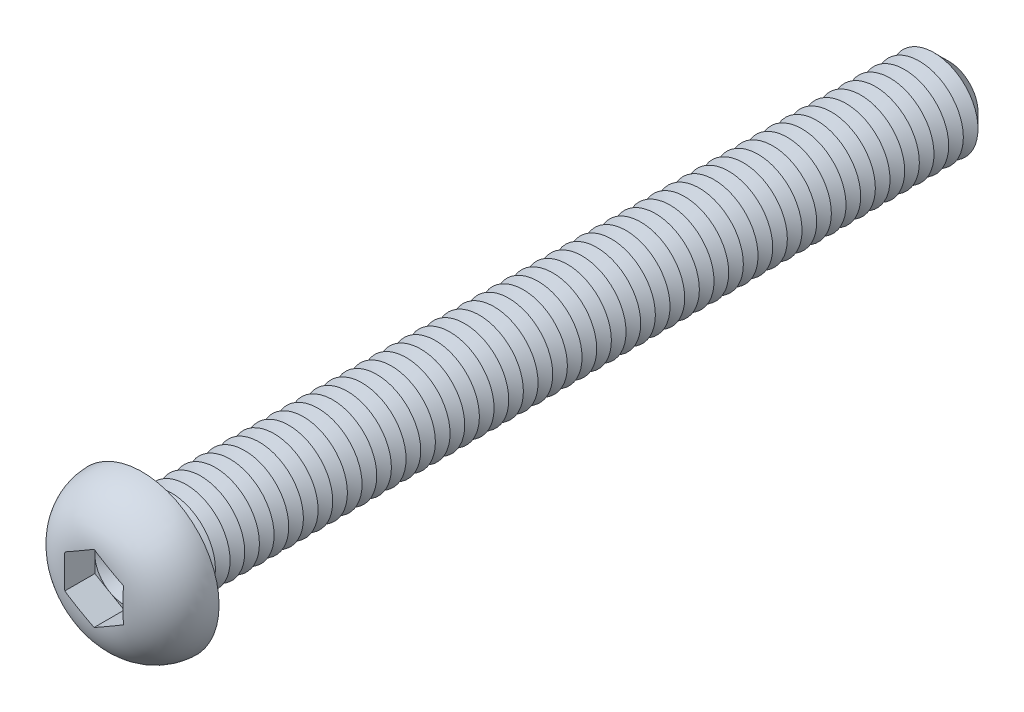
ISO-10303-21;
HEADER;
FILE_DESCRIPTION(('STEP AP214'),'2;1');
FILE_NAME('part.step','',(''),(''),'','','');
FILE_SCHEMA(('AUTOMOTIVE_DESIGN { 1 0 10303 214 1 1 1 1 }'));
ENDSEC;
DATA;
#1=APPLICATION_CONTEXT('core data for automotive mechanical design processes');
#2=APPLICATION_PROTOCOL_DEFINITION('international standard','automotive_design',2000,#1);
#3=PRODUCT_CONTEXT('',#1,'mechanical');
#4=PRODUCT('Part','Part','',(#3));
#5=PRODUCT_RELATED_PRODUCT_CATEGORY('part','',(#4));
#6=PRODUCT_DEFINITION_FORMATION('','',#4);
#7=PRODUCT_DEFINITION_CONTEXT('part definition',#1,'design');
#8=PRODUCT_DEFINITION('design','',#6,#7);
#9=PRODUCT_DEFINITION_SHAPE('','',#8);
#10=(LENGTH_UNIT() NAMED_UNIT(*) SI_UNIT(.MILLI.,.METRE.));
#11=(NAMED_UNIT(*) PLANE_ANGLE_UNIT() SI_UNIT($,.RADIAN.));
#12=(NAMED_UNIT(*) SI_UNIT($,.STERADIAN.) SOLID_ANGLE_UNIT());
#13=UNCERTAINTY_MEASURE_WITH_UNIT(LENGTH_MEASURE(1.E-05),#10,'distance_accuracy_value','');
#14=(GEOMETRIC_REPRESENTATION_CONTEXT(3) GLOBAL_UNCERTAINTY_ASSIGNED_CONTEXT((#13)) GLOBAL_UNIT_ASSIGNED_CONTEXT((#10,
#11,#12)) REPRESENTATION_CONTEXT('',''));
#15=CARTESIAN_POINT('',(0.,0.,0.));
#16=DIRECTION('',(0.,0.,1.));
#17=DIRECTION('',(1.,0.,0.));
#18=AXIS2_PLACEMENT_3D('',#15,#16,#17);
#19=CARTESIAN_POINT('',(0.,0.,1.22));
#20=DIRECTION('',(0.,0.,1.));
#21=DIRECTION('',(1.,0.,0.));
#22=AXIS2_PLACEMENT_3D('',#19,#20,#21);
#23=PLANE('',#22);
#24=CARTESIAN_POINT('',(0.,0.,1.22));
#25=DIRECTION('',(0.,0.,1.));
#26=DIRECTION('',(1.,0.,0.));
#27=AXIS2_PLACEMENT_3D('',#24,#25,#26);
#28=CIRCLE('',#27,2.);
#29=CARTESIAN_POINT('',(2.,0.,1.22));
#30=VERTEX_POINT('',#29);
#31=CARTESIAN_POINT('',(1.,1.73205080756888,1.22));
#32=VERTEX_POINT('',#31);
#33=EDGE_CURVE('E117',#30,#32,#28,.T.);
#34=ORIENTED_EDGE('',*,*,#33,.F.);
#35=DIRECTION('',(0.,1.,0.));
#36=VECTOR('',#35,1.);
#37=CARTESIAN_POINT('',(2.,-1.15470053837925,1.22));
#38=LINE('',#37,#36);
#39=CARTESIAN_POINT('',(2.,1.15470053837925,1.22));
#40=VERTEX_POINT('',#39);
#41=EDGE_CURVE('E140',#30,#40,#38,.T.);
#42=ORIENTED_EDGE('',*,*,#41,.T.);
#43=DIRECTION('',(-0.866025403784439,0.5,0.));
#44=VECTOR('',#43,1.);
#45=CARTESIAN_POINT('',(2.,1.15470053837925,1.22));
#46=LINE('',#45,#44);
#47=EDGE_CURVE('E136',#40,#32,#46,.T.);
#48=ORIENTED_EDGE('',*,*,#47,.T.);
#49=EDGE_LOOP('',(#34,#42,#48));
#50=FACE_BOUND('',#49,.T.);
#51=ADVANCED_FACE('F39',(#50),#23,.T.);
#52=CARTESIAN_POINT('',(0.,0.,1.22));
#53=DIRECTION('',(0.,0.,1.));
#54=DIRECTION('',(1.,0.,0.));
#55=AXIS2_PLACEMENT_3D('',#52,#53,#54);
#56=CIRCLE('',#55,2.);
#57=CARTESIAN_POINT('',(-1.,1.73205080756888,1.22));
#58=VERTEX_POINT('',#57);
#59=EDGE_CURVE('E11',#32,#58,#56,.T.);
#60=ORIENTED_EDGE('',*,*,#59,.F.);
#61=CARTESIAN_POINT('',(0.,2.3094010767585,1.22));
#62=VERTEX_POINT('',#61);
#63=EDGE_CURVE('E130',#32,#62,#46,.T.);
#64=ORIENTED_EDGE('',*,*,#63,.T.);
#65=DIRECTION('',(-0.866025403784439,-0.5,0.));
#66=VECTOR('',#65,1.);
#67=CARTESIAN_POINT('',(0.,2.3094010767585,1.22));
#68=LINE('',#67,#66);
#69=EDGE_CURVE('E131',#62,#58,#68,.T.);
#70=ORIENTED_EDGE('',*,*,#69,.T.);
#71=EDGE_LOOP('',(#60,#64,#70));
#72=FACE_BOUND('',#71,.T.);
#73=ADVANCED_FACE('F129',(#72),#23,.T.);
#74=CARTESIAN_POINT('',(-2.,0.,1.22));
#75=VERTEX_POINT('',#74);
#76=EDGE_CURVE('E49',#58,#75,#56,.T.);
#77=ORIENTED_EDGE('',*,*,#76,.F.);
#78=CARTESIAN_POINT('',(-2.,1.15470053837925,1.22));
#79=VERTEX_POINT('',#78);
#80=EDGE_CURVE('E143',#58,#79,#68,.T.);
#81=ORIENTED_EDGE('',*,*,#80,.T.);
#82=DIRECTION('',(0.,-1.,0.));
#83=VECTOR('',#82,1.);
#84=CARTESIAN_POINT('',(-2.,1.15470053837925,1.22));
#85=LINE('',#84,#83);
#86=EDGE_CURVE('E152',#79,#75,#85,.T.);
#87=ORIENTED_EDGE('',*,*,#86,.T.);
#88=EDGE_LOOP('',(#77,#81,#87));
#89=FACE_BOUND('',#88,.T.);
#90=ADVANCED_FACE('F270',(#89),#23,.T.);
#91=CARTESIAN_POINT('',(-1.,-1.73205080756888,1.22));
#92=VERTEX_POINT('',#91);
#93=EDGE_CURVE('E253',#75,#92,#56,.T.);
#94=ORIENTED_EDGE('',*,*,#93,.F.);
#95=CARTESIAN_POINT('',(-2.,-1.15470053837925,1.22));
#96=VERTEX_POINT('',#95);
#97=EDGE_CURVE('E151',#75,#96,#85,.T.);
#98=ORIENTED_EDGE('',*,*,#97,.T.);
#99=DIRECTION('',(0.866025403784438,-0.5,0.));
#100=VECTOR('',#99,1.);
#101=CARTESIAN_POINT('',(-2.,-1.15470053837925,1.22));
#102=LINE('',#101,#100);
#103=EDGE_CURVE('E157',#96,#92,#102,.T.);
#104=ORIENTED_EDGE('',*,*,#103,.T.);
#105=EDGE_LOOP('',(#94,#98,#104));
#106=FACE_BOUND('',#105,.T.);
#107=ADVANCED_FACE('F264',(#106),#23,.T.);
#108=CARTESIAN_POINT('',(0.999999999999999,-1.73205080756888,1.22));
#109=VERTEX_POINT('',#108);
#110=EDGE_CURVE('E56',#92,#109,#56,.T.);
#111=ORIENTED_EDGE('',*,*,#110,.F.);
#112=CARTESIAN_POINT('',(0.,-2.3094010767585,1.22));
#113=VERTEX_POINT('',#112);
#114=EDGE_CURVE('E156',#92,#113,#102,.T.);
#115=ORIENTED_EDGE('',*,*,#114,.T.);
#116=DIRECTION('',(0.866025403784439,0.5,0.));
#117=VECTOR('',#116,1.);
#118=CARTESIAN_POINT('',(0.,-2.3094010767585,1.22));
#119=LINE('',#118,#117);
#120=EDGE_CURVE('E162',#113,#109,#119,.T.);
#121=ORIENTED_EDGE('',*,*,#120,.T.);
#122=EDGE_LOOP('',(#111,#115,#121));
#123=FACE_BOUND('',#122,.T.);
#124=ADVANCED_FACE('F305',(#123),#23,.T.);
#125=CARTESIAN_POINT('',(0.,0.,-55.));
#126=DIRECTION('',(0.,0.,1.));
#127=DIRECTION('',(1.,0.,0.));
#128=AXIS2_PLACEMENT_3D('',#125,#126,#127);
#129=CYLINDRICAL_SURFACE('',#128,3.);
#130=CARTESIAN_POINT('',(0.,0.,-0.5));
#131=DIRECTION('',(0.,0.,1.));
#132=DIRECTION('',(1.,0.,0.));
#133=AXIS2_PLACEMENT_3D('',#130,#131,#132);
#134=CIRCLE('',#133,3.);
#135=CARTESIAN_POINT('',(3.,0.,-0.5));
#136=VERTEX_POINT('',#135);
#137=EDGE_CURVE('E241',#136,#136,#134,.F.);
#138=ORIENTED_EDGE('',*,*,#137,.T.);
#139=EDGE_LOOP('',(#138));
#140=FACE_BOUND('',#139,.T.);
#141=CARTESIAN_POINT('',(0.,0.,-1.));
#142=DIRECTION('',(0.,0.,1.));
#143=DIRECTION('',(1.,0.,0.));
#144=AXIS2_PLACEMENT_3D('',#141,#142,#143);
#145=CIRCLE('',#144,3.00000000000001);
#146=CARTESIAN_POINT('',(3.00000000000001,0.,-1.));
#147=VERTEX_POINT('',#146);
#148=EDGE_CURVE('E138',#147,#147,#145,.T.);
#149=ORIENTED_EDGE('',*,*,#148,.T.);
#150=EDGE_LOOP('',(#149));
#151=FACE_BOUND('',#150,.T.);
#152=ADVANCED_FACE('F306',(#140,#151),#129,.T.);
#153=CARTESIAN_POINT('',(0.,5.25,0.));
#154=DIRECTION('',(0.,0.,1.));
#155=DIRECTION('',(1.,0.,0.));
#156=AXIS2_PLACEMENT_3D('',#153,#154,#155);
#157=PLANE('',#156);
#158=CARTESIAN_POINT('',(0.,0.,0.));
#159=DIRECTION('',(0.,0.,1.));
#160=DIRECTION('',(1.,0.,0.));
#161=AXIS2_PLACEMENT_3D('',#158,#159,#160);
#162=CIRCLE('',#161,3.5);
#163=CARTESIAN_POINT('',(3.5,0.,0.));
#164=VERTEX_POINT('',#163);
#165=EDGE_CURVE('E244',#164,#164,#162,.T.);
#166=ORIENTED_EDGE('',*,*,#165,.T.);
#167=EDGE_LOOP('',(#166));
#168=FACE_BOUND('',#167,.T.);
#169=CARTESIAN_POINT('',(0.,0.,0.));
#170=DIRECTION('',(0.,0.,1.));
#171=DIRECTION('',(1.,0.,0.));
#172=AXIS2_PLACEMENT_3D('',#169,#170,#171);
#173=CIRCLE('',#172,5.25);
#174=CARTESIAN_POINT('',(5.25,0.,0.));
#175=VERTEX_POINT('',#174);
#176=EDGE_CURVE('E173',#175,#175,#173,.T.);
#177=ORIENTED_EDGE('',*,*,#176,.F.);
#178=EDGE_LOOP('',(#177));
#179=FACE_BOUND('',#178,.T.);
#180=ADVANCED_FACE('F309',(#168,#179),#157,.F.);
#181=CARTESIAN_POINT('',(0.,0.,-0.0999999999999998));
#182=DIRECTION('',(0.,0.,1.));
#183=DIRECTION('',(1.,0.,0.));
#184=AXIS2_PLACEMENT_3D('',#181,#182,#183);
#185=DEGENERATE_TOROIDAL_SURFACE('',#184,1.85147090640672,3.4,.T.);
#186=CARTESIAN_POINT('',(-2.0002,1.15458506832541,3.26900492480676));
#187=CARTESIAN_POINT('',(-1.91694658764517,1.20265144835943,3.27552708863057));
#188=CARTESIAN_POINT('',(-1.83362001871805,1.25076006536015,3.28041849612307));
#189=CARTESIAN_POINT('',(-1.66691146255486,1.34700929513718,3.28784569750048));
#190=CARTESIAN_POINT('',(-1.58352950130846,1.39514989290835,3.29038223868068));
#191=CARTESIAN_POINT('',(-1.4167967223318,1.49141310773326,3.29400753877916));
#192=CARTESIAN_POINT('',(-1.33344591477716,1.5395357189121,3.29509714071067));
#193=CARTESIAN_POINT('',(-1.16673007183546,1.63578915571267,3.29647051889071));
#194=CARTESIAN_POINT('',(-1.08336503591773,1.68391998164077,3.29675420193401));
#195=CARTESIAN_POINT('',(-0.916634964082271,1.78018163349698,3.29675420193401));
#196=CARTESIAN_POINT('',(-0.833269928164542,1.82831245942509,3.29647051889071));
#197=CARTESIAN_POINT('',(-0.666554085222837,1.92456589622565,3.29509714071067));
#198=CARTESIAN_POINT('',(-0.583203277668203,1.9726885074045,3.29400753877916));
#199=CARTESIAN_POINT('',(-0.416470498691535,2.06895172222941,3.29038223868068));
#200=CARTESIAN_POINT('',(-0.333088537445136,2.11709232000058,3.28784569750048));
#201=CARTESIAN_POINT('',(-0.166379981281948,2.21334154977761,3.28041849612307));
#202=CARTESIAN_POINT('',(-0.0830534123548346,2.26145016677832,3.27552708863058));
#203=CARTESIAN_POINT('',(0.000200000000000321,2.30951654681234,3.26900492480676));
#204=B_SPLINE_CURVE_WITH_KNOTS('',3,(#186,#187,#188,#189,#190,#191,#192,#193,#194,#195,#196,
#197,#198,#199,#200,#201,#202,#203),.UNSPECIFIED.,.F.,.F.,(4,2,2,2,2,2,2,2,4),(0.,
0.289010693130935,0.57792963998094,0.866680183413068,1.15546411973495,1.44424805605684,
1.73299859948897,2.02191754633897,2.31092823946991),.UNSPECIFIED.);
#205=CARTESIAN_POINT('',(-2.,1.15470053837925,3.26902062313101));
#206=VERTEX_POINT('',#205);
#207=CARTESIAN_POINT('',(1.70733705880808E-11,2.30940107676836,3.2690206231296));
#208=VERTEX_POINT('',#207);
#209=EDGE_CURVE('E195',#206,#208,#204,.T.);
#210=ORIENTED_EDGE('',*,*,#209,.T.);
#211=CARTESIAN_POINT('',(-0.000199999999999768,2.30951654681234,3.26900492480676));
#212=CARTESIAN_POINT('',(0.0830534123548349,2.26145016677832,3.27552708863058));
#213=CARTESIAN_POINT('',(0.166379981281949,2.21334154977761,3.28041849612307));
#214=CARTESIAN_POINT('',(0.333088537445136,2.11709232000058,3.28784569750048));
#215=CARTESIAN_POINT('',(0.416470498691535,2.06895172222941,3.29038223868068));
#216=CARTESIAN_POINT('',(0.583203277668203,1.9726885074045,3.29400753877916));
#217=CARTESIAN_POINT('',(0.666554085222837,1.92456589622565,3.29509714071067));
#218=CARTESIAN_POINT('',(0.833269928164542,1.82831245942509,3.29647051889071));
#219=CARTESIAN_POINT('',(0.916634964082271,1.78018163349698,3.29675420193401));
#220=CARTESIAN_POINT('',(1.08336503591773,1.68391998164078,3.29675420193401));
#221=CARTESIAN_POINT('',(1.16673007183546,1.63578915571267,3.29647051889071));
#222=CARTESIAN_POINT('',(1.33344591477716,1.5395357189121,3.29509714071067));
#223=CARTESIAN_POINT('',(1.4167967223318,1.49141310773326,3.29400753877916));
#224=CARTESIAN_POINT('',(1.58352950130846,1.39514989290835,3.29038223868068));
#225=CARTESIAN_POINT('',(1.66691146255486,1.34700929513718,3.28784569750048));
#226=CARTESIAN_POINT('',(1.83362001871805,1.25076006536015,3.28041849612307));
#227=CARTESIAN_POINT('',(1.91694658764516,1.20265144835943,3.27552708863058));
#228=CARTESIAN_POINT('',(2.0002,1.15458506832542,3.26900492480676));
#229=B_SPLINE_CURVE_WITH_KNOTS('',3,(#211,#212,#213,#214,#215,#216,#217,#218,#219,#220,#221,
#222,#223,#224,#225,#226,#227,#228),.UNSPECIFIED.,.F.,.F.,(4,2,2,2,2,2,2,2,4),(0.,
0.289010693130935,0.577929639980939,0.866680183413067,1.15546411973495,1.44424805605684,
1.73299859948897,2.02191754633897,2.31092823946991),.UNSPECIFIED.);
#230=CARTESIAN_POINT('',(2.,1.15470053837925,3.26902062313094));
#231=VERTEX_POINT('',#230);
#232=EDGE_CURVE('E224',#208,#231,#229,.T.);
#233=ORIENTED_EDGE('',*,*,#232,.T.);
#234=CARTESIAN_POINT('',(2.,0.,3.29675420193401));
#235=CARTESIAN_POINT('',(2.,-0.0838690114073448,3.29675159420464));
#236=CARTESIAN_POINT('',(2.,-0.167737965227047,3.29653427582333));
#237=CARTESIAN_POINT('',(2.,-0.335473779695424,3.29552217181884));
#238=CARTESIAN_POINT('',(2.,-0.419340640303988,3.29472737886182));
#239=CARTESIAN_POINT('',(2.,-0.587092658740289,3.29218243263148));
#240=CARTESIAN_POINT('',(2.,-0.670977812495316,3.29043194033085));
#241=CARTESIAN_POINT('',(2.,-0.838702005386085,3.28542814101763));
#242=CARTESIAN_POINT('',(2.,-0.922541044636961,3.28217483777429));
#243=CARTESIAN_POINT('',(2.,-1.173343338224,3.26923984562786));
#244=CARTESIAN_POINT('',(2.,-1.34017699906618,3.25638268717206));
#245=CARTESIAN_POINT('',(2.,-1.67225876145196,3.21731215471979));
#246=CARTESIAN_POINT('',(2.,-1.83750825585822,3.19111187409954));
#247=CARTESIAN_POINT('',(2.,-2.10571503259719,3.13417573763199));
#248=CARTESIAN_POINT('',(2.,-2.20973442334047,3.10844622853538));
#249=CARTESIAN_POINT('',(2.,-2.41562153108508,3.04936015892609));
#250=CARTESIAN_POINT('',(2.,-2.51748898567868,3.01600267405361));
#251=CARTESIAN_POINT('',(2.,-2.71832295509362,2.94120377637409));
#252=CARTESIAN_POINT('',(2.,-2.81728700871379,2.89975572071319));
#253=CARTESIAN_POINT('',(2.,-3.01134256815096,2.80859624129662));
#254=CARTESIAN_POINT('',(2.,-3.10643425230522,2.75888519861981));
#255=CARTESIAN_POINT('',(2.,-3.29253530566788,2.65079509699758));
#256=CARTESIAN_POINT('',(2.,-3.38350832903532,2.59235327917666));
#257=CARTESIAN_POINT('',(2.,-3.55964478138,2.46728791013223));
#258=CARTESIAN_POINT('',(2.,-3.64480873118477,2.40066509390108));
#259=CARTESIAN_POINT('',(2.,-3.80840353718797,2.25961603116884));
#260=CARTESIAN_POINT('',(2.,-3.88683504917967,2.18519054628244));
#261=CARTESIAN_POINT('',(2.,-4.03608847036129,2.02906828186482));
#262=CARTESIAN_POINT('',(2.,-4.106911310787,1.94737239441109));
#263=CARTESIAN_POINT('',(2.,-4.23287471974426,1.78665318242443));
#264=CARTESIAN_POINT('',(2.,-4.2888832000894,1.7083085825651));
#265=CARTESIAN_POINT('',(2.,-4.39372062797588,1.54691061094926));
#266=CARTESIAN_POINT('',(2.,-4.44254705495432,1.46385560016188));
#267=CARTESIAN_POINT('',(2.,-4.53249771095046,1.29375158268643));
#268=CARTESIAN_POINT('',(2.,-4.57362814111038,1.20670586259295));
#269=CARTESIAN_POINT('',(2.,-4.6478549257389,1.02924414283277));
#270=CARTESIAN_POINT('',(2.,-4.68094842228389,0.938826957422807));
#271=CARTESIAN_POINT('',(2.,-4.76413649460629,0.674747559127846));
#272=CARTESIAN_POINT('',(2.,-4.80368573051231,0.497625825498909));
#273=CARTESIAN_POINT('',(2.,-4.85179982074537,0.13932226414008));
#274=CARTESIAN_POINT('',(2.,-4.86036774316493,-0.0418591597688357));
#275=CARTESIAN_POINT('',(2.,-4.84642577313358,-0.399473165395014));
#276=CARTESIAN_POINT('',(2.,-4.82452156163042,-0.575929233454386));
#277=CARTESIAN_POINT('',(2.,-4.75142809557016,-0.922615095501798));
#278=CARTESIAN_POINT('',(2.,-4.70024536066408,-1.09284626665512));
#279=CARTESIAN_POINT('',(2.,-4.57020203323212,-1.42258491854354));
#280=CARTESIAN_POINT('',(2.,-4.49131097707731,-1.58208036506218));
#281=CARTESIAN_POINT('',(2.,-4.3083542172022,-1.8860021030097));
#282=CARTESIAN_POINT('',(2.,-4.2042742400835,-2.03041978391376));
#283=CARTESIAN_POINT('',(2.,-3.97174533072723,-2.30354399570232));
#284=CARTESIAN_POINT('',(2.,-3.84281347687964,-2.43183812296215));
#285=CARTESIAN_POINT('',(2.,-3.56631740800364,-2.66612298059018));
#286=CARTESIAN_POINT('',(2.,-3.41877418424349,-2.77213848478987));
#287=CARTESIAN_POINT('',(2.,-3.18261597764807,-2.91604941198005));
#288=CARTESIAN_POINT('',(2.,-3.09905663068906,-2.96247915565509));
#289=CARTESIAN_POINT('',(2.,-2.92856838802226,-3.04879370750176));
#290=CARTESIAN_POINT('',(2.,-2.84163827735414,-3.08867612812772));
#291=CARTESIAN_POINT('',(2.,-2.66495003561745,-3.16199567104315));
#292=CARTESIAN_POINT('',(2.,-2.57518752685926,-3.19542218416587));
#293=CARTESIAN_POINT('',(2.,-2.3936698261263,-3.25594506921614));
#294=CARTESIAN_POINT('',(2.,-2.30191676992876,-3.28304789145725));
#295=CARTESIAN_POINT('',(2.,-2.07265810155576,-3.34285611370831));
#296=CARTESIAN_POINT('',(2.,-1.93423373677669,-3.37205334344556));
#297=CARTESIAN_POINT('',(2.,-1.65546420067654,-3.419280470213));
#298=CARTESIAN_POINT('',(2.,-1.51511762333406,-3.43730169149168));
#299=CARTESIAN_POINT('',(2.,-1.23291689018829,-3.46473877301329));
#300=CARTESIAN_POINT('',(2.,-1.09105869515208,-3.47411015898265));
#301=CARTESIAN_POINT('',(2.,-0.807138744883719,-3.48717303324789));
#302=CARTESIAN_POINT('',(2.,-0.665077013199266,-3.4908651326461));
#303=CARTESIAN_POINT('',(2.,-0.451303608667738,-3.49429675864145));
#304=CARTESIAN_POINT('',(2.,-0.379602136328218,-3.49508825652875));
#305=CARTESIAN_POINT('',(2.,-0.236195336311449,-3.49619580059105));
#306=CARTESIAN_POINT('',(2.,-0.164490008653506,-3.49651184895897));
#307=CARTESIAN_POINT('',(2.,-0.0210718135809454,-3.49680708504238));
#308=CARTESIAN_POINT('',(2.,0.0506410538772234,-3.49678623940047));
#309=CARTESIAN_POINT('',(2.,0.194065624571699,-3.49639104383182));
#310=CARTESIAN_POINT('',(2.,0.265777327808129,-3.49601669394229));
#311=CARTESIAN_POINT('',(2.,0.480501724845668,-3.4941697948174));
#312=CARTESIAN_POINT('',(2.,0.623510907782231,-3.49197539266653));
#313=CARTESIAN_POINT('',(2.,0.909378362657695,-3.48318258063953));
#314=CARTESIAN_POINT('',(2.,1.05223667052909,-3.47658576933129));
#315=CARTESIAN_POINT('',(2.,1.30726724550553,-3.45800282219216));
#316=CARTESIAN_POINT('',(2.,1.41953767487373,-3.44745204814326));
#317=CARTESIAN_POINT('',(2.,1.64336701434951,-3.42020385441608));
#318=CARTESIAN_POINT('',(2.,1.75492585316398,-3.40350582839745));
#319=CARTESIAN_POINT('',(2.,1.97590795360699,-3.36293007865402));
#320=CARTESIAN_POINT('',(2.,2.08534088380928,-3.33910600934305));
#321=CARTESIAN_POINT('',(2.,2.30216001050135,-3.28336687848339));
#322=CARTESIAN_POINT('',(2.,2.40954602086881,-3.25145108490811));
#323=CARTESIAN_POINT('',(2.,2.62289868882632,-3.1784271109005));
#324=CARTESIAN_POINT('',(2.,2.72882262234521,-3.13719314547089));
#325=CARTESIAN_POINT('',(2.,2.93660837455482,-3.04548652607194));
#326=CARTESIAN_POINT('',(2.,3.03847031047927,-2.99501413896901));
#327=CARTESIAN_POINT('',(2.,3.23738754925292,-2.88459171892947));
#328=CARTESIAN_POINT('',(2.,3.33442546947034,-2.82461027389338));
#329=CARTESIAN_POINT('',(2.,3.52225616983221,-2.69545434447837));
#330=CARTESIAN_POINT('',(2.,3.61304636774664,-2.62627609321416));
#331=CARTESIAN_POINT('',(2.,3.77958578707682,-2.48563135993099));
#332=CARTESIAN_POINT('',(2.,3.85595570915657,-2.41489922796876));
#333=CARTESIAN_POINT('',(2.,4.00175744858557,-2.26661746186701));
#334=CARTESIAN_POINT('',(2.,4.07118992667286,-2.18906847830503));
#335=CARTESIAN_POINT('',(2.,4.20228235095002,-2.02784942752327));
#336=CARTESIAN_POINT('',(2.,4.26395450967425,-1.94418931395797));
#337=CARTESIAN_POINT('',(2.,4.37897455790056,-1.7713710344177));
#338=CARTESIAN_POINT('',(2.,4.43232318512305,-1.68221335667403));
#339=CARTESIAN_POINT('',(2.,4.5685109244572,-1.42722170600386));
#340=CARTESIAN_POINT('',(2.,4.64167742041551,-1.25607726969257));
#341=CARTESIAN_POINT('',(2.,4.75695354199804,-0.903699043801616));
#342=CARTESIAN_POINT('',(2.,4.79906366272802,-0.722465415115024));
#343=CARTESIAN_POINT('',(2.,4.84982785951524,-0.362243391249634));
#344=CARTESIAN_POINT('',(2.,4.85966759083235,-0.183422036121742));
#345=CARTESIAN_POINT('',(2.,4.84889099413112,0.17327689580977));
#346=CARTESIAN_POINT('',(2.,4.82827907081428,0.351154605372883));
#347=CARTESIAN_POINT('',(2.,4.75760776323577,0.699332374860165));
#348=CARTESIAN_POINT('',(2.,4.70780624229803,0.869684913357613));
#349=CARTESIAN_POINT('',(2.,4.58058971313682,1.199716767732));
#350=CARTESIAN_POINT('',(2.,4.50317623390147,1.35939667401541));
#351=CARTESIAN_POINT('',(2.,4.32230037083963,1.66542907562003));
#352=CARTESIAN_POINT('',(2.,4.21858077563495,1.81162931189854));
#353=CARTESIAN_POINT('',(2.,3.98879583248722,2.08527000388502));
#354=CARTESIAN_POINT('',(2.,3.86272429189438,2.21270524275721));
#355=CARTESIAN_POINT('',(2.,3.58743550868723,2.45020985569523));
#356=CARTESIAN_POINT('',(2.,3.43756474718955,2.55951924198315));
#357=CARTESIAN_POINT('',(2.,3.12282273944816,2.7535430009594));
#358=CARTESIAN_POINT('',(2.,2.95795742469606,2.83826704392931));
#359=CARTESIAN_POINT('',(2.,2.67096435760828,2.96064273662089));
#360=CARTESIAN_POINT('',(2.,2.55150855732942,3.00473766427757));
#361=CARTESIAN_POINT('',(2.,2.30905936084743,3.08191633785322));
#362=CARTESIAN_POINT('',(2.,2.18606487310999,3.11499664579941));
#363=CARTESIAN_POINT('',(2.,1.93761764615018,3.17114962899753));
#364=CARTESIAN_POINT('',(2.,1.8121607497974,3.19420352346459));
#365=CARTESIAN_POINT('',(2.,1.56000755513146,3.23170431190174));
#366=CARTESIAN_POINT('',(2.,1.43331126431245,3.24615125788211));
#367=CARTESIAN_POINT('',(2.,1.19785080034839,3.26676473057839));
#368=CARTESIAN_POINT('',(2.,1.08915974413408,3.27383022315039));
#369=CARTESIAN_POINT('',(2.,0.87159878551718,3.28448481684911));
#370=CARTESIAN_POINT('',(2.,0.762728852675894,3.28807324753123));
#371=CARTESIAN_POINT('',(2.,0.54488171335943,3.29312180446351));
#372=CARTESIAN_POINT('',(2.,0.435904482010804,3.29458062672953));
#373=CARTESIAN_POINT('',(2.,0.217951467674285,3.29639847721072));
#374=CARTESIAN_POINT('',(2.,0.108975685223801,3.29675759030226));
#375=CARTESIAN_POINT('',(2.,0.,3.29675420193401));
#376=B_SPLINE_CURVE_WITH_KNOTS('',3,(#234,#235,#236,#237,#238,#239,#240,#241,#242,#243,#244,
#245,#246,#247,#248,#249,#250,#251,#252,#253,#254,#255,#256,#257,#258,#259,#260,#261,#262,#263,
#264,#265,#266,#267,#268,#269,#270,#271,#272,#273,#274,#275,#276,#277,#278,#279,#280,#281,#282,
#283,#284,#285,#286,#287,#288,#289,#290,#291,#292,#293,#294,#295,#296,#297,#298,#299,#300,#301,
#302,#303,#304,#305,#306,#307,#308,#309,#310,#311,#312,#313,#314,#315,#316,#317,#318,#319,#320,
#321,#322,#323,#324,#325,#326,#327,#328,#329,#330,#331,#332,#333,#334,#335,#336,#337,#338,#339,
#340,#341,#342,#343,#344,#345,#346,#347,#348,#349,#350,#351,#352,#353,#354,#355,#356,#357,#358,
#359,#360,#361,#362,#363,#364,#365,#366,#367,#368,#369,#370,#371,#372,#373,#374,#375),
.UNSPECIFIED.,.T.,.F.,(4,2,2,2,2,2,2,2,2,2,2,2,2,2,2,2,2,2,2,2,2,2,2,2,2,2,2,2,2,2,2,2,2,2,2,2,
2,2,2,2,2,2,2,2,2,2,2,2,2,2,2,2,2,2,2,2,2,2,2,2,2,2,2,2,2,2,2,2,2,2,4),(0.,0.251606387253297,
0.503215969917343,0.754914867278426,1.00661313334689,1.50825543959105,2.00940643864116,
2.33061510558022,2.65186271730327,2.97337521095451,3.29487288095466,3.61880390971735,
3.94270585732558,4.26657621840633,4.59040689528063,4.8789527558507,5.16759964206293,
5.45601293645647,5.74452864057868,6.28608750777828,6.82759274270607,7.35848716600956,
7.8892634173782,8.42062506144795,8.95228851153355,9.49557283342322,10.0382497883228,
10.3247866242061,10.6114277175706,10.8985359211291,11.1853499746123,11.6091713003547,
12.0333212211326,12.4596400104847,12.8859129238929,13.1010304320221,13.316146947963,
13.5312847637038,13.746422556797,14.1754765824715,14.6043748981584,14.9425387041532,
15.2807358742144,15.6164481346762,15.9521907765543,16.2927694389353,16.6333382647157,
16.9750565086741,17.3169151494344,17.6287548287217,17.9405647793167,18.2518777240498,
18.5631630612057,19.1185081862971,19.6738444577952,20.20853386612,20.7431459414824,
21.2731049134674,21.8030345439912,22.3383600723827,22.8738341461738,23.4279697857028,
23.9818871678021,24.3633752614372,24.7449823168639,25.1273011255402,25.5096176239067,
25.8363061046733,26.163057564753,26.4900090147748,26.8169352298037),.UNSPECIFIED.);
#377=CARTESIAN_POINT('',(2.,-1.15470053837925,3.26902062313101));
#378=VERTEX_POINT('',#377);
#379=EDGE_CURVE('E233',#231,#378,#376,.T.);
#380=ORIENTED_EDGE('',*,*,#379,.T.);
#381=CARTESIAN_POINT('',(2.0002,-1.15458506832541,3.26900492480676));
#382=CARTESIAN_POINT('',(1.91694658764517,-1.20265144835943,3.27552708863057));
#383=CARTESIAN_POINT('',(1.83362001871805,-1.25076006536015,3.28041849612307));
#384=CARTESIAN_POINT('',(1.66691146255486,-1.34700929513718,3.28784569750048));
#385=CARTESIAN_POINT('',(1.58352950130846,-1.39514989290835,3.29038223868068));
#386=CARTESIAN_POINT('',(1.4167967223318,-1.49141310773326,3.29400753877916));
#387=CARTESIAN_POINT('',(1.33344591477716,-1.5395357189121,3.29509714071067));
#388=CARTESIAN_POINT('',(1.16673007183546,-1.63578915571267,3.29647051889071));
#389=CARTESIAN_POINT('',(1.08336503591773,-1.68391998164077,3.29675420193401));
#390=CARTESIAN_POINT('',(0.916634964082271,-1.78018163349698,3.29675420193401));
#391=CARTESIAN_POINT('',(0.833269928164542,-1.82831245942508,3.29647051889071));
#392=CARTESIAN_POINT('',(0.666554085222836,-1.92456589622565,3.29509714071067));
#393=CARTESIAN_POINT('',(0.583203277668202,-1.97268850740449,3.29400753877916));
#394=CARTESIAN_POINT('',(0.416470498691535,-2.06895172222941,3.29038223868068));
#395=CARTESIAN_POINT('',(0.333088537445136,-2.11709232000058,3.28784569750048));
#396=CARTESIAN_POINT('',(0.166379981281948,-2.2133415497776,3.28041849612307));
#397=CARTESIAN_POINT('',(0.0830534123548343,-2.26145016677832,3.27552708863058));
#398=CARTESIAN_POINT('',(-0.000200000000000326,-2.30951654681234,3.26900492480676));
#399=B_SPLINE_CURVE_WITH_KNOTS('',3,(#381,#382,#383,#384,#385,#386,#387,#388,#389,#390,#391,
#392,#393,#394,#395,#396,#397,#398),.UNSPECIFIED.,.F.,.F.,(4,2,2,2,2,2,2,2,4),(0.,
0.289010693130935,0.57792963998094,0.866680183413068,1.15546411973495,1.44424805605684,
1.73299859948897,2.02191754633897,2.31092823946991),.UNSPECIFIED.);
#400=CARTESIAN_POINT('',(0.,-2.3094010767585,3.26902062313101));
#401=VERTEX_POINT('',#400);
#402=EDGE_CURVE('E279',#378,#401,#399,.T.);
#403=ORIENTED_EDGE('',*,*,#402,.T.);
#404=CARTESIAN_POINT('',(0.000199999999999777,-2.30951654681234,3.26900492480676));
#405=CARTESIAN_POINT('',(-0.083053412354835,-2.26145016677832,3.27552708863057));
#406=CARTESIAN_POINT('',(-0.166379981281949,-2.21334154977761,3.28041849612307));
#407=CARTESIAN_POINT('',(-0.333088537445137,-2.11709232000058,3.28784569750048));
#408=CARTESIAN_POINT('',(-0.416470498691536,-2.06895172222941,3.29038223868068));
#409=CARTESIAN_POINT('',(-0.583203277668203,-1.97268850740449,3.29400753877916));
#410=CARTESIAN_POINT('',(-0.666554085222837,-1.92456589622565,3.29509714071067));
#411=CARTESIAN_POINT('',(-0.833269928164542,-1.82831245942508,3.29647051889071));
#412=CARTESIAN_POINT('',(-0.916634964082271,-1.78018163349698,3.29675420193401));
#413=CARTESIAN_POINT('',(-1.08336503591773,-1.68391998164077,3.29675420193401));
#414=CARTESIAN_POINT('',(-1.16673007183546,-1.63578915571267,3.29647051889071));
#415=CARTESIAN_POINT('',(-1.33344591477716,-1.5395357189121,3.29509714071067));
#416=CARTESIAN_POINT('',(-1.4167967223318,-1.49141310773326,3.29400753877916));
#417=CARTESIAN_POINT('',(-1.58352950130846,-1.39514989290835,3.29038223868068));
#418=CARTESIAN_POINT('',(-1.66691146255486,-1.34700929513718,3.28784569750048));
#419=CARTESIAN_POINT('',(-1.83362001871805,-1.25076006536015,3.28041849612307));
#420=CARTESIAN_POINT('',(-1.91694658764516,-1.20265144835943,3.27552708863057));
#421=CARTESIAN_POINT('',(-2.0002,-1.15458506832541,3.26900492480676));
#422=B_SPLINE_CURVE_WITH_KNOTS('',3,(#404,#405,#406,#407,#408,#409,#410,#411,#412,#413,#414,
#415,#416,#417,#418,#419,#420,#421),.UNSPECIFIED.,.F.,.F.,(4,2,2,2,2,2,2,2,4),(0.,
0.289010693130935,0.577929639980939,0.866680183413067,1.15546411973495,1.44424805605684,
1.73299859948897,2.02191754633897,2.31092823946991),.UNSPECIFIED.);
#423=CARTESIAN_POINT('',(-2.,-1.15470053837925,3.26902062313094));
#424=VERTEX_POINT('',#423);
#425=EDGE_CURVE('E277',#401,#424,#422,.T.);
#426=ORIENTED_EDGE('',*,*,#425,.T.);
#427=CARTESIAN_POINT('',(-2.,0.,3.29675420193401));
#428=CARTESIAN_POINT('',(-2.,0.0838690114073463,3.29675159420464));
#429=CARTESIAN_POINT('',(-2.,0.167737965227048,3.29653427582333));
#430=CARTESIAN_POINT('',(-2.,0.335473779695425,3.29552217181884));
#431=CARTESIAN_POINT('',(-2.,0.41934064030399,3.29472737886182));
#432=CARTESIAN_POINT('',(-2.,0.58709265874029,3.29218243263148));
#433=CARTESIAN_POINT('',(-2.,0.670977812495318,3.29043194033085));
#434=CARTESIAN_POINT('',(-2.,0.838702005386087,3.28542814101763));
#435=CARTESIAN_POINT('',(-2.,0.922541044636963,3.28217483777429));
#436=CARTESIAN_POINT('',(-2.,1.173343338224,3.26923984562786));
#437=CARTESIAN_POINT('',(-2.,1.34017699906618,3.25638268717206));
#438=CARTESIAN_POINT('',(-2.,1.67225876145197,3.21731215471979));
#439=CARTESIAN_POINT('',(-2.,1.83750825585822,3.19111187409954));
#440=CARTESIAN_POINT('',(-2.,2.10571503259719,3.13417573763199));
#441=CARTESIAN_POINT('',(-2.,2.20973442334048,3.10844622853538));
#442=CARTESIAN_POINT('',(-2.,2.41562153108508,3.04936015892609));
#443=CARTESIAN_POINT('',(-2.,2.51748898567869,3.01600267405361));
#444=CARTESIAN_POINT('',(-2.,2.71832295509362,2.94120377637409));
#445=CARTESIAN_POINT('',(-2.,2.81728700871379,2.89975572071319));
#446=CARTESIAN_POINT('',(-2.,3.01134256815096,2.80859624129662));
#447=CARTESIAN_POINT('',(-2.,3.10643425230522,2.75888519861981));
#448=CARTESIAN_POINT('',(-2.,3.29253530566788,2.65079509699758));
#449=CARTESIAN_POINT('',(-2.,3.38350832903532,2.59235327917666));
#450=CARTESIAN_POINT('',(-2.,3.55964478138,2.46728791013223));
#451=CARTESIAN_POINT('',(-2.,3.64480873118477,2.40066509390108));
#452=CARTESIAN_POINT('',(-2.,3.80840353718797,2.25961603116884));
#453=CARTESIAN_POINT('',(-2.,3.88683504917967,2.18519054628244));
#454=CARTESIAN_POINT('',(-2.,4.03608847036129,2.02906828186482));
#455=CARTESIAN_POINT('',(-2.,4.106911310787,1.94737239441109));
#456=CARTESIAN_POINT('',(-2.,4.23287471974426,1.78665318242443));
#457=CARTESIAN_POINT('',(-2.,4.2888832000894,1.7083085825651));
#458=CARTESIAN_POINT('',(-2.,4.39372062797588,1.54691061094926));
#459=CARTESIAN_POINT('',(-2.,4.44254705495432,1.46385560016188));
#460=CARTESIAN_POINT('',(-2.,4.53249771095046,1.29375158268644));
#461=CARTESIAN_POINT('',(-2.,4.57362814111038,1.20670586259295));
#462=CARTESIAN_POINT('',(-2.,4.6478549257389,1.02924414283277));
#463=CARTESIAN_POINT('',(-2.,4.68094842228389,0.938826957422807));
#464=CARTESIAN_POINT('',(-2.,4.76413649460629,0.674747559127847));
#465=CARTESIAN_POINT('',(-2.,4.80368573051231,0.497625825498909));
#466=CARTESIAN_POINT('',(-2.,4.85179982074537,0.13932226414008));
#467=CARTESIAN_POINT('',(-2.,4.86036774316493,-0.0418591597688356));
#468=CARTESIAN_POINT('',(-2.,4.84642577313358,-0.399473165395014));
#469=CARTESIAN_POINT('',(-2.,4.82452156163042,-0.575929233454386));
#470=CARTESIAN_POINT('',(-2.,4.75142809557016,-0.922615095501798));
#471=CARTESIAN_POINT('',(-2.,4.70024536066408,-1.09284626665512));
#472=CARTESIAN_POINT('',(-2.,4.57020203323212,-1.42258491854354));
#473=CARTESIAN_POINT('',(-2.,4.49131097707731,-1.58208036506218));
#474=CARTESIAN_POINT('',(-2.,4.3083542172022,-1.8860021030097));
#475=CARTESIAN_POINT('',(-2.,4.2042742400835,-2.03041978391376));
#476=CARTESIAN_POINT('',(-2.,3.97174533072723,-2.30354399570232));
#477=CARTESIAN_POINT('',(-2.,3.84281347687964,-2.43183812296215));
#478=CARTESIAN_POINT('',(-2.,3.56631740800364,-2.66612298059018));
#479=CARTESIAN_POINT('',(-2.,3.41877418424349,-2.77213848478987));
#480=CARTESIAN_POINT('',(-2.,3.18261597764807,-2.91604941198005));
#481=CARTESIAN_POINT('',(-2.,3.09905663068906,-2.96247915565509));
#482=CARTESIAN_POINT('',(-2.,2.92856838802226,-3.04879370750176));
#483=CARTESIAN_POINT('',(-2.,2.84163827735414,-3.08867612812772));
#484=CARTESIAN_POINT('',(-2.,2.66495003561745,-3.16199567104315));
#485=CARTESIAN_POINT('',(-2.,2.57518752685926,-3.19542218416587));
#486=CARTESIAN_POINT('',(-2.,2.3936698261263,-3.25594506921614));
#487=CARTESIAN_POINT('',(-2.,2.30191676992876,-3.28304789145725));
#488=CARTESIAN_POINT('',(-2.,2.07265810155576,-3.34285611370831));
#489=CARTESIAN_POINT('',(-2.,1.93423373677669,-3.37205334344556));
#490=CARTESIAN_POINT('',(-2.,1.65546420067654,-3.419280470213));
#491=CARTESIAN_POINT('',(-2.,1.51511762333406,-3.43730169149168));
#492=CARTESIAN_POINT('',(-2.,1.23291689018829,-3.46473877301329));
#493=CARTESIAN_POINT('',(-2.,1.09105869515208,-3.47411015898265));
#494=CARTESIAN_POINT('',(-2.,0.807138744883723,-3.48717303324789));
#495=CARTESIAN_POINT('',(-2.,0.66507701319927,-3.4908651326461));
#496=CARTESIAN_POINT('',(-2.,0.451303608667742,-3.49429675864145));
#497=CARTESIAN_POINT('',(-2.,0.379602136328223,-3.49508825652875));
#498=CARTESIAN_POINT('',(-2.,0.236195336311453,-3.49619580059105));
#499=CARTESIAN_POINT('',(-2.,0.16449000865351,-3.49651184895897));
#500=CARTESIAN_POINT('',(-2.,0.0210718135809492,-3.49680708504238));
#501=CARTESIAN_POINT('',(-2.,-0.0506410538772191,-3.49678623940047));
#502=CARTESIAN_POINT('',(-2.,-0.194065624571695,-3.49639104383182));
#503=CARTESIAN_POINT('',(-2.,-0.265777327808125,-3.49601669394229));
#504=CARTESIAN_POINT('',(-2.,-0.480501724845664,-3.4941697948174));
#505=CARTESIAN_POINT('',(-2.,-0.623510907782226,-3.49197539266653));
#506=CARTESIAN_POINT('',(-2.,-0.909378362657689,-3.48318258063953));
#507=CARTESIAN_POINT('',(-2.,-1.05223667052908,-3.47658576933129));
#508=CARTESIAN_POINT('',(-2.,-1.30726724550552,-3.45800282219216));
#509=CARTESIAN_POINT('',(-2.,-1.41953767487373,-3.44745204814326));
#510=CARTESIAN_POINT('',(-2.,-1.6433670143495,-3.42020385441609));
#511=CARTESIAN_POINT('',(-2.,-1.75492585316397,-3.40350582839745));
#512=CARTESIAN_POINT('',(-2.,-1.97590795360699,-3.36293007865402));
#513=CARTESIAN_POINT('',(-2.,-2.08534088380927,-3.33910600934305));
#514=CARTESIAN_POINT('',(-2.,-2.30216001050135,-3.28336687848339));
#515=CARTESIAN_POINT('',(-2.,-2.4095460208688,-3.25145108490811));
#516=CARTESIAN_POINT('',(-2.,-2.62289868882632,-3.1784271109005));
#517=CARTESIAN_POINT('',(-2.,-2.72882262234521,-3.13719314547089));
#518=CARTESIAN_POINT('',(-2.,-2.93660837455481,-3.04548652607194));
#519=CARTESIAN_POINT('',(-2.,-3.03847031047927,-2.99501413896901));
#520=CARTESIAN_POINT('',(-2.,-3.23738754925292,-2.88459171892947));
#521=CARTESIAN_POINT('',(-2.,-3.33442546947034,-2.82461027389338));
#522=CARTESIAN_POINT('',(-2.,-3.52225616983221,-2.69545434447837));
#523=CARTESIAN_POINT('',(-2.,-3.61304636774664,-2.62627609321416));
#524=CARTESIAN_POINT('',(-2.,-3.77958578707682,-2.48563135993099));
#525=CARTESIAN_POINT('',(-2.,-3.85595570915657,-2.41489922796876));
#526=CARTESIAN_POINT('',(-2.,-4.00175744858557,-2.26661746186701));
#527=CARTESIAN_POINT('',(-2.,-4.07118992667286,-2.18906847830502));
#528=CARTESIAN_POINT('',(-2.,-4.20228235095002,-2.02784942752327));
#529=CARTESIAN_POINT('',(-2.,-4.26395450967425,-1.94418931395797));
#530=CARTESIAN_POINT('',(-2.,-4.37897455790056,-1.7713710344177));
#531=CARTESIAN_POINT('',(-2.,-4.43232318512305,-1.68221335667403));
#532=CARTESIAN_POINT('',(-2.,-4.5685109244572,-1.42722170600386));
#533=CARTESIAN_POINT('',(-2.,-4.64167742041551,-1.25607726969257));
#534=CARTESIAN_POINT('',(-2.,-4.75695354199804,-0.903699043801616));
#535=CARTESIAN_POINT('',(-2.,-4.79906366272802,-0.722465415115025));
#536=CARTESIAN_POINT('',(-2.,-4.84982785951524,-0.362243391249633));
#537=CARTESIAN_POINT('',(-2.,-4.85966759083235,-0.18342203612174));
#538=CARTESIAN_POINT('',(-2.,-4.84889099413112,0.173276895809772));
#539=CARTESIAN_POINT('',(-2.,-4.82827907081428,0.351154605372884));
#540=CARTESIAN_POINT('',(-2.,-4.75760776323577,0.699332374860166));
#541=CARTESIAN_POINT('',(-2.,-4.70780624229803,0.869684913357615));
#542=CARTESIAN_POINT('',(-2.,-4.58058971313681,1.199716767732));
#543=CARTESIAN_POINT('',(-2.,-4.50317623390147,1.35939667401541));
#544=CARTESIAN_POINT('',(-2.,-4.32230037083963,1.66542907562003));
#545=CARTESIAN_POINT('',(-2.,-4.21858077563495,1.81162931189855));
#546=CARTESIAN_POINT('',(-2.,-3.98879583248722,2.08527000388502));
#547=CARTESIAN_POINT('',(-2.,-3.86272429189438,2.21270524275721));
#548=CARTESIAN_POINT('',(-2.,-3.58743550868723,2.45020985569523));
#549=CARTESIAN_POINT('',(-2.,-3.43756474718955,2.55951924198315));
#550=CARTESIAN_POINT('',(-2.,-3.12282273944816,2.7535430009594));
#551=CARTESIAN_POINT('',(-2.,-2.95795742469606,2.8382670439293));
#552=CARTESIAN_POINT('',(-2.,-2.67096435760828,2.96064273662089));
#553=CARTESIAN_POINT('',(-2.,-2.55150855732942,3.00473766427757));
#554=CARTESIAN_POINT('',(-2.,-2.30905936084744,3.08191633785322));
#555=CARTESIAN_POINT('',(-2.,-2.18606487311,3.11499664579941));
#556=CARTESIAN_POINT('',(-2.,-1.93761764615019,3.17114962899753));
#557=CARTESIAN_POINT('',(-2.,-1.81216074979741,3.19420352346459));
#558=CARTESIAN_POINT('',(-2.,-1.56000755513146,3.23170431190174));
#559=CARTESIAN_POINT('',(-2.,-1.43331126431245,3.24615125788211));
#560=CARTESIAN_POINT('',(-2.,-1.19785080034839,3.26676473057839));
#561=CARTESIAN_POINT('',(-2.,-1.08915974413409,3.27383022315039));
#562=CARTESIAN_POINT('',(-2.,-0.871598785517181,3.28448481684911));
#563=CARTESIAN_POINT('',(-2.,-0.762728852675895,3.28807324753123));
#564=CARTESIAN_POINT('',(-2.,-0.54488171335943,3.29312180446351));
#565=CARTESIAN_POINT('',(-2.,-0.435904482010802,3.29458062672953));
#566=CARTESIAN_POINT('',(-2.,-0.217951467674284,3.29639847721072));
#567=CARTESIAN_POINT('',(-2.,-0.108975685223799,3.29675759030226));
#568=CARTESIAN_POINT('',(-2.,0.,3.29675420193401));
#569=B_SPLINE_CURVE_WITH_KNOTS('',3,(#427,#428,#429,#430,#431,#432,#433,#434,#435,#436,#437,
#438,#439,#440,#441,#442,#443,#444,#445,#446,#447,#448,#449,#450,#451,#452,#453,#454,#455,#456,
#457,#458,#459,#460,#461,#462,#463,#464,#465,#466,#467,#468,#469,#470,#471,#472,#473,#474,#475,
#476,#477,#478,#479,#480,#481,#482,#483,#484,#485,#486,#487,#488,#489,#490,#491,#492,#493,#494,
#495,#496,#497,#498,#499,#500,#501,#502,#503,#504,#505,#506,#507,#508,#509,#510,#511,#512,#513,
#514,#515,#516,#517,#518,#519,#520,#521,#522,#523,#524,#525,#526,#527,#528,#529,#530,#531,#532,
#533,#534,#535,#536,#537,#538,#539,#540,#541,#542,#543,#544,#545,#546,#547,#548,#549,#550,#551,
#552,#553,#554,#555,#556,#557,#558,#559,#560,#561,#562,#563,#564,#565,#566,#567,#568),
.UNSPECIFIED.,.T.,.F.,(4,2,2,2,2,2,2,2,2,2,2,2,2,2,2,2,2,2,2,2,2,2,2,2,2,2,2,2,2,2,2,2,2,2,2,2,
2,2,2,2,2,2,2,2,2,2,2,2,2,2,2,2,2,2,2,2,2,2,2,2,2,2,2,2,2,2,2,2,2,2,4),(0.,0.251606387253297,
0.503215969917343,0.754914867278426,1.0066131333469,1.50825543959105,2.00940643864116,
2.33061510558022,2.65186271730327,2.97337521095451,3.29487288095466,3.61880390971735,
3.94270585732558,4.26657621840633,4.59040689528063,4.8789527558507,5.16759964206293,
5.45601293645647,5.74452864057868,6.28608750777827,6.82759274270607,7.35848716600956,
7.88926341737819,8.42062506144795,8.95228851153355,9.49557283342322,10.0382497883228,
10.3247866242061,10.6114277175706,10.8985359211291,11.1853499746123,11.6091713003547,
12.0333212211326,12.4596400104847,12.8859129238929,13.1010304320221,13.316146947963,
13.5312847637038,13.746422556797,14.1754765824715,14.6043748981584,14.9425387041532,
15.2807358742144,15.6164481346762,15.9521907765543,16.2927694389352,16.6333382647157,
16.9750565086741,17.3169151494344,17.6287548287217,17.9405647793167,18.2518777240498,
18.5631630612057,19.1185081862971,19.6738444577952,20.20853386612,20.7431459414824,
21.2731049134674,21.8030345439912,22.3383600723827,22.8738341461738,23.4279697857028,
23.981887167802,24.3633752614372,24.7449823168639,25.1273011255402,25.5096176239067,
25.8363061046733,26.163057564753,26.4900090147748,26.8169352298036),.UNSPECIFIED.);
#570=EDGE_CURVE('E204',#424,#206,#569,.T.);
#571=ORIENTED_EDGE('',*,*,#570,.T.);
#572=EDGE_LOOP('',(#210,#233,#380,#403,#426,#571));
#573=FACE_BOUND('',#572,.T.);
#574=ORIENTED_EDGE('',*,*,#176,.T.);
#575=EDGE_LOOP('',(#574));
#576=FACE_BOUND('',#575,.T.);
#577=ADVANCED_FACE('F209',(#573,#576),#185,.T.);
#578=CARTESIAN_POINT('',(2.,1.15470053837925,1.22));
#579=DIRECTION('',(0.5,0.866025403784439,0.));
#580=DIRECTION('',(-0.866025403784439,0.5,0.));
#581=AXIS2_PLACEMENT_3D('',#578,#579,#580);
#582=PLANE('',#581);
#583=DIRECTION('',(0.,0.,1.));
#584=VECTOR('',#583,1.);
#585=CARTESIAN_POINT('',(0.,2.3094010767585,1.22));
#586=LINE('',#585,#584);
#587=EDGE_CURVE('E64',#62,#208,#586,.T.);
#588=ORIENTED_EDGE('',*,*,#587,.F.);
#589=ORIENTED_EDGE('',*,*,#63,.F.);
#590=ORIENTED_EDGE('',*,*,#47,.F.);
#591=DIRECTION('',(0.,0.,1.));
#592=VECTOR('',#591,1.);
#593=CARTESIAN_POINT('',(2.,1.15470053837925,1.22));
#594=LINE('',#593,#592);
#595=EDGE_CURVE('E170',#40,#231,#594,.T.);
#596=ORIENTED_EDGE('',*,*,#595,.T.);
#597=ORIENTED_EDGE('',*,*,#232,.F.);
#598=EDGE_LOOP('',(#588,#589,#590,#596,#597));
#599=FACE_BOUND('',#598,.T.);
#600=ADVANCED_FACE('F134',(#599),#582,.F.);
#601=CARTESIAN_POINT('',(2.,-1.15470053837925,1.22));
#602=DIRECTION('',(1.,0.,0.));
#603=DIRECTION('',(0.,1.,0.));
#604=AXIS2_PLACEMENT_3D('',#601,#602,#603);
#605=PLANE('',#604);
#606=ORIENTED_EDGE('',*,*,#595,.F.);
#607=ORIENTED_EDGE('',*,*,#41,.F.);
#608=CARTESIAN_POINT('',(2.,-1.15470053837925,1.22));
#609=VERTEX_POINT('',#608);
#610=EDGE_CURVE('E166',#609,#30,#38,.T.);
#611=ORIENTED_EDGE('',*,*,#610,.F.);
#612=DIRECTION('',(0.,0.,1.));
#613=VECTOR('',#612,1.);
#614=CARTESIAN_POINT('',(2.,-1.15470053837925,1.22));
#615=LINE('',#614,#613);
#616=EDGE_CURVE('E174',#609,#378,#615,.T.);
#617=ORIENTED_EDGE('',*,*,#616,.T.);
#618=ORIENTED_EDGE('',*,*,#379,.F.);
#619=EDGE_LOOP('',(#606,#607,#611,#617,#618));
#620=FACE_BOUND('',#619,.T.);
#621=ADVANCED_FACE('F222',(#620),#605,.F.);
#622=CARTESIAN_POINT('',(0.,-2.3094010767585,1.22));
#623=DIRECTION('',(0.5,-0.866025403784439,0.));
#624=DIRECTION('',(0.866025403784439,0.5,0.));
#625=AXIS2_PLACEMENT_3D('',#622,#623,#624);
#626=PLANE('',#625);
#627=ORIENTED_EDGE('',*,*,#616,.F.);
#628=EDGE_CURVE('E161',#109,#609,#119,.T.);
#629=ORIENTED_EDGE('',*,*,#628,.F.);
#630=ORIENTED_EDGE('',*,*,#120,.F.);
#631=DIRECTION('',(0.,0.,1.));
#632=VECTOR('',#631,1.);
#633=CARTESIAN_POINT('',(0.,-2.3094010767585,1.22));
#634=LINE('',#633,#632);
#635=EDGE_CURVE('E178',#113,#401,#634,.T.);
#636=ORIENTED_EDGE('',*,*,#635,.T.);
#637=ORIENTED_EDGE('',*,*,#402,.F.);
#638=EDGE_LOOP('',(#627,#629,#630,#636,#637));
#639=FACE_BOUND('',#638,.T.);
#640=ADVANCED_FACE('F292',(#639),#626,.F.);
#641=CARTESIAN_POINT('',(-2.,-1.15470053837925,1.22));
#642=DIRECTION('',(-0.5,-0.866025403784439,0.));
#643=DIRECTION('',(0.866025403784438,-0.5,0.));
#644=AXIS2_PLACEMENT_3D('',#641,#642,#643);
#645=PLANE('',#644);
#646=ORIENTED_EDGE('',*,*,#635,.F.);
#647=ORIENTED_EDGE('',*,*,#114,.F.);
#648=ORIENTED_EDGE('',*,*,#103,.F.);
#649=DIRECTION('',(0.,0.,1.));
#650=VECTOR('',#649,1.);
#651=CARTESIAN_POINT('',(-2.,-1.15470053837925,1.22));
#652=LINE('',#651,#650);
#653=EDGE_CURVE('E182',#96,#424,#652,.T.);
#654=ORIENTED_EDGE('',*,*,#653,.T.);
#655=ORIENTED_EDGE('',*,*,#425,.F.);
#656=EDGE_LOOP('',(#646,#647,#648,#654,#655));
#657=FACE_BOUND('',#656,.T.);
#658=ADVANCED_FACE('F289',(#657),#645,.F.);
#659=CARTESIAN_POINT('',(-2.,1.15470053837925,1.22));
#660=DIRECTION('',(-1.,0.,0.));
#661=DIRECTION('',(0.,-1.,0.));
#662=AXIS2_PLACEMENT_3D('',#659,#660,#661);
#663=PLANE('',#662);
#664=ORIENTED_EDGE('',*,*,#653,.F.);
#665=ORIENTED_EDGE('',*,*,#97,.F.);
#666=ORIENTED_EDGE('',*,*,#86,.F.);
#667=DIRECTION('',(0.,0.,1.));
#668=VECTOR('',#667,1.);
#669=CARTESIAN_POINT('',(-2.,1.15470053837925,1.22));
#670=LINE('',#669,#668);
#671=EDGE_CURVE('E186',#79,#206,#670,.T.);
#672=ORIENTED_EDGE('',*,*,#671,.T.);
#673=ORIENTED_EDGE('',*,*,#570,.F.);
#674=EDGE_LOOP('',(#664,#665,#666,#672,#673));
#675=FACE_BOUND('',#674,.T.);
#676=ADVANCED_FACE('F217',(#675),#663,.F.);
#677=CARTESIAN_POINT('',(0.,2.3094010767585,1.22));
#678=DIRECTION('',(-0.5,0.866025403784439,0.));
#679=DIRECTION('',(-0.866025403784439,-0.5,0.));
#680=AXIS2_PLACEMENT_3D('',#677,#678,#679);
#681=PLANE('',#680);
#682=ORIENTED_EDGE('',*,*,#671,.F.);
#683=ORIENTED_EDGE('',*,*,#80,.F.);
#684=ORIENTED_EDGE('',*,*,#69,.F.);
#685=ORIENTED_EDGE('',*,*,#587,.T.);
#686=ORIENTED_EDGE('',*,*,#209,.F.);
#687=EDGE_LOOP('',(#682,#683,#684,#685,#686));
#688=FACE_BOUND('',#687,.T.);
#689=ADVANCED_FACE('F213',(#688),#681,.F.);
#690=EDGE_CURVE('E43',#109,#30,#56,.T.);
#691=ORIENTED_EDGE('',*,*,#690,.F.);
#692=ORIENTED_EDGE('',*,*,#628,.T.);
#693=ORIENTED_EDGE('',*,*,#610,.T.);
#694=EDGE_LOOP('',(#691,#692,#693));
#695=FACE_BOUND('',#694,.T.);
#696=ADVANCED_FACE('F216',(#695),#23,.T.);
#697=CARTESIAN_POINT('',(0.,0.,-1.));
#698=DIRECTION('',(0.,0.,1.));
#699=DIRECTION('',(1.,0.,0.));
#700=AXIS2_PLACEMENT_3D('',#697,#698,#699);
#701=CONICAL_SURFACE('',#700,3.00000000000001,1.0471975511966);
#702=CARTESIAN_POINT('',(0.,0.,-1.5));
#703=DIRECTION('',(0.,0.,1.));
#704=DIRECTION('',(1.,0.,0.));
#705=AXIS2_PLACEMENT_3D('',#702,#703,#704);
#706=CIRCLE('',#705,2.13397459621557);
#707=CARTESIAN_POINT('',(2.13397459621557,0.,-1.5));
#708=VERTEX_POINT('',#707);
#709=EDGE_CURVE('E851',#708,#708,#706,.T.);
#710=ORIENTED_EDGE('',*,*,#709,.T.);
#711=EDGE_LOOP('',(#710));
#712=FACE_BOUND('',#711,.T.);
#713=ORIENTED_EDGE('',*,*,#148,.F.);
#714=EDGE_LOOP('',(#713));
#715=FACE_BOUND('',#714,.T.);
#716=ADVANCED_FACE('F303',(#712,#715),#701,.T.);
#717=CARTESIAN_POINT('',(0.,0.,-1.5));
#718=DIRECTION('',(0.,0.,-1.));
#719=DIRECTION('',(-1.,0.,0.));
#720=AXIS2_PLACEMENT_3D('',#717,#718,#719);
#721=CONICAL_SURFACE('',#720,2.13397459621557,1.0471975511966);
#722=CARTESIAN_POINT('',(0.,0.,-2.));
#723=DIRECTION('',(0.,0.,1.));
#724=DIRECTION('',(1.,0.,0.));
#725=AXIS2_PLACEMENT_3D('',#722,#723,#724);
#726=CIRCLE('',#725,3.00000000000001);
#727=CARTESIAN_POINT('',(3.00000000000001,0.,-2.));
#728=VERTEX_POINT('',#727);
#729=EDGE_CURVE('E841',#728,#728,#726,.T.);
#730=ORIENTED_EDGE('',*,*,#729,.T.);
#731=EDGE_LOOP('',(#730));
#732=FACE_BOUND('',#731,.T.);
#733=ORIENTED_EDGE('',*,*,#709,.F.);
#734=EDGE_LOOP('',(#733));
#735=FACE_BOUND('',#734,.T.);
#736=ADVANCED_FACE('F319',(#732,#735),#721,.T.);
#737=CARTESIAN_POINT('',(0.,0.,-2.));
#738=DIRECTION('',(0.,0.,1.));
#739=DIRECTION('',(1.,0.,0.));
#740=AXIS2_PLACEMENT_3D('',#737,#738,#739);
#741=CONICAL_SURFACE('',#740,3.00000000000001,1.0471975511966);
#742=CARTESIAN_POINT('',(0.,0.,-2.5));
#743=DIRECTION('',(0.,0.,1.));
#744=DIRECTION('',(1.,0.,0.));
#745=AXIS2_PLACEMENT_3D('',#742,#743,#744);
#746=CIRCLE('',#745,2.13397459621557);
#747=CARTESIAN_POINT('',(2.13397459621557,0.,-2.5));
#748=VERTEX_POINT('',#747);
#749=EDGE_CURVE('E835',#748,#748,#746,.T.);
#750=ORIENTED_EDGE('',*,*,#749,.T.);
#751=EDGE_LOOP('',(#750));
#752=FACE_BOUND('',#751,.T.);
#753=ORIENTED_EDGE('',*,*,#729,.F.);
#754=EDGE_LOOP('',(#753));
#755=FACE_BOUND('',#754,.T.);
#756=ADVANCED_FACE('F323',(#752,#755),#741,.T.);
#757=CARTESIAN_POINT('',(0.,0.,-2.5));
#758=DIRECTION('',(0.,0.,-1.));
#759=DIRECTION('',(-1.,0.,0.));
#760=AXIS2_PLACEMENT_3D('',#757,#758,#759);
#761=CONICAL_SURFACE('',#760,2.13397459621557,1.0471975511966);
#762=CARTESIAN_POINT('',(0.,0.,-3.));
#763=DIRECTION('',(0.,0.,1.));
#764=DIRECTION('',(1.,0.,0.));
#765=AXIS2_PLACEMENT_3D('',#762,#763,#764);
#766=CIRCLE('',#765,3.00000000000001);
#767=CARTESIAN_POINT('',(3.00000000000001,0.,-3.));
#768=VERTEX_POINT('',#767);
#769=EDGE_CURVE('E833',#768,#768,#766,.T.);
#770=ORIENTED_EDGE('',*,*,#769,.T.);
#771=EDGE_LOOP('',(#770));
#772=FACE_BOUND('',#771,.T.);
#773=ORIENTED_EDGE('',*,*,#749,.F.);
#774=EDGE_LOOP('',(#773));
#775=FACE_BOUND('',#774,.T.);
#776=ADVANCED_FACE('F327',(#772,#775),#761,.T.);
#777=CARTESIAN_POINT('',(0.,0.,-3.));
#778=DIRECTION('',(0.,0.,1.));
#779=DIRECTION('',(1.,0.,0.));
#780=AXIS2_PLACEMENT_3D('',#777,#778,#779);
#781=CONICAL_SURFACE('',#780,3.00000000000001,1.0471975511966);
#782=CARTESIAN_POINT('',(0.,0.,-3.5));
#783=DIRECTION('',(0.,0.,1.));
#784=DIRECTION('',(1.,0.,0.));
#785=AXIS2_PLACEMENT_3D('',#782,#783,#784);
#786=CIRCLE('',#785,2.13397459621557);
#787=CARTESIAN_POINT('',(2.13397459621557,0.,-3.5));
#788=VERTEX_POINT('',#787);
#789=EDGE_CURVE('E836',#788,#788,#786,.T.);
#790=ORIENTED_EDGE('',*,*,#789,.T.);
#791=EDGE_LOOP('',(#790));
#792=FACE_BOUND('',#791,.T.);
#793=ORIENTED_EDGE('',*,*,#769,.F.);
#794=EDGE_LOOP('',(#793));
#795=FACE_BOUND('',#794,.T.);
#796=ADVANCED_FACE('F331',(#792,#795),#781,.T.);
#797=CARTESIAN_POINT('',(0.,0.,-3.5));
#798=DIRECTION('',(0.,0.,-1.));
#799=DIRECTION('',(-1.,0.,0.));
#800=AXIS2_PLACEMENT_3D('',#797,#798,#799);
#801=CONICAL_SURFACE('',#800,2.13397459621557,1.0471975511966);
#802=CARTESIAN_POINT('',(0.,0.,-4.));
#803=DIRECTION('',(0.,0.,1.));
#804=DIRECTION('',(1.,0.,0.));
#805=AXIS2_PLACEMENT_3D('',#802,#803,#804);
#806=CIRCLE('',#805,3.00000000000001);
#807=CARTESIAN_POINT('',(3.00000000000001,0.,-4.));
#808=VERTEX_POINT('',#807);
#809=EDGE_CURVE('E845',#808,#808,#806,.T.);
#810=ORIENTED_EDGE('',*,*,#809,.T.);
#811=EDGE_LOOP('',(#810));
#812=FACE_BOUND('',#811,.T.);
#813=ORIENTED_EDGE('',*,*,#789,.F.);
#814=EDGE_LOOP('',(#813));
#815=FACE_BOUND('',#814,.T.);
#816=ADVANCED_FACE('F335',(#812,#815),#801,.T.);
#817=CARTESIAN_POINT('',(0.,0.,-4.));
#818=DIRECTION('',(0.,0.,1.));
#819=DIRECTION('',(1.,0.,0.));
#820=AXIS2_PLACEMENT_3D('',#817,#818,#819);
#821=CONICAL_SURFACE('',#820,3.00000000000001,1.0471975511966);
#822=CARTESIAN_POINT('',(0.,0.,-4.5));
#823=DIRECTION('',(0.,0.,1.));
#824=DIRECTION('',(1.,0.,0.));
#825=AXIS2_PLACEMENT_3D('',#822,#823,#824);
#826=CIRCLE('',#825,2.13397459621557);
#827=CARTESIAN_POINT('',(2.13397459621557,0.,-4.5));
#828=VERTEX_POINT('',#827);
#829=EDGE_CURVE('E954',#828,#828,#826,.T.);
#830=ORIENTED_EDGE('',*,*,#829,.T.);
#831=EDGE_LOOP('',(#830));
#832=FACE_BOUND('',#831,.T.);
#833=ORIENTED_EDGE('',*,*,#809,.F.);
#834=EDGE_LOOP('',(#833));
#835=FACE_BOUND('',#834,.T.);
#836=ADVANCED_FACE('F339',(#832,#835),#821,.T.);
#837=CARTESIAN_POINT('',(0.,0.,-4.5));
#838=DIRECTION('',(0.,0.,-1.));
#839=DIRECTION('',(-1.,0.,0.));
#840=AXIS2_PLACEMENT_3D('',#837,#838,#839);
#841=CONICAL_SURFACE('',#840,2.13397459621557,1.0471975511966);
#842=CARTESIAN_POINT('',(0.,0.,-5.));
#843=DIRECTION('',(0.,0.,1.));
#844=DIRECTION('',(1.,0.,0.));
#845=AXIS2_PLACEMENT_3D('',#842,#843,#844);
#846=CIRCLE('',#845,3.00000000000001);
#847=CARTESIAN_POINT('',(3.00000000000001,0.,-5.));
#848=VERTEX_POINT('',#847);
#849=EDGE_CURVE('E950',#848,#848,#846,.T.);
#850=ORIENTED_EDGE('',*,*,#849,.T.);
#851=EDGE_LOOP('',(#850));
#852=FACE_BOUND('',#851,.T.);
#853=ORIENTED_EDGE('',*,*,#829,.F.);
#854=EDGE_LOOP('',(#853));
#855=FACE_BOUND('',#854,.T.);
#856=ADVANCED_FACE('F343',(#852,#855),#841,.T.);
#857=CARTESIAN_POINT('',(0.,0.,-5.));
#858=DIRECTION('',(0.,0.,1.));
#859=DIRECTION('',(1.,0.,0.));
#860=AXIS2_PLACEMENT_3D('',#857,#858,#859);
#861=CONICAL_SURFACE('',#860,3.00000000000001,1.0471975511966);
#862=CARTESIAN_POINT('',(0.,0.,-5.5));
#863=DIRECTION('',(0.,0.,1.));
#864=DIRECTION('',(1.,0.,0.));
#865=AXIS2_PLACEMENT_3D('',#862,#863,#864);
#866=CIRCLE('',#865,2.13397459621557);
#867=CARTESIAN_POINT('',(2.13397459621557,0.,-5.5));
#868=VERTEX_POINT('',#867);
#869=EDGE_CURVE('E946',#868,#868,#866,.T.);
#870=ORIENTED_EDGE('',*,*,#869,.T.);
#871=EDGE_LOOP('',(#870));
#872=FACE_BOUND('',#871,.T.);
#873=ORIENTED_EDGE('',*,*,#849,.F.);
#874=EDGE_LOOP('',(#873));
#875=FACE_BOUND('',#874,.T.);
#876=ADVANCED_FACE('F347',(#872,#875),#861,.T.);
#877=CARTESIAN_POINT('',(0.,0.,-5.5));
#878=DIRECTION('',(0.,0.,-1.));
#879=DIRECTION('',(-1.,0.,0.));
#880=AXIS2_PLACEMENT_3D('',#877,#878,#879);
#881=CONICAL_SURFACE('',#880,2.13397459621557,1.0471975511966);
#882=CARTESIAN_POINT('',(0.,0.,-6.));
#883=DIRECTION('',(0.,0.,1.));
#884=DIRECTION('',(1.,0.,0.));
#885=AXIS2_PLACEMENT_3D('',#882,#883,#884);
#886=CIRCLE('',#885,3.00000000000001);
#887=CARTESIAN_POINT('',(3.00000000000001,0.,-6.));
#888=VERTEX_POINT('',#887);
#889=EDGE_CURVE('E942',#888,#888,#886,.T.);
#890=ORIENTED_EDGE('',*,*,#889,.T.);
#891=EDGE_LOOP('',(#890));
#892=FACE_BOUND('',#891,.T.);
#893=ORIENTED_EDGE('',*,*,#869,.F.);
#894=EDGE_LOOP('',(#893));
#895=FACE_BOUND('',#894,.T.);
#896=ADVANCED_FACE('F351',(#892,#895),#881,.T.);
#897=CARTESIAN_POINT('',(0.,0.,-6.));
#898=DIRECTION('',(0.,0.,1.));
#899=DIRECTION('',(1.,0.,0.));
#900=AXIS2_PLACEMENT_3D('',#897,#898,#899);
#901=CONICAL_SURFACE('',#900,3.00000000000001,1.0471975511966);
#902=CARTESIAN_POINT('',(0.,0.,-6.5));
#903=DIRECTION('',(0.,0.,1.));
#904=DIRECTION('',(1.,0.,0.));
#905=AXIS2_PLACEMENT_3D('',#902,#903,#904);
#906=CIRCLE('',#905,2.13397459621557);
#907=CARTESIAN_POINT('',(2.13397459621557,0.,-6.5));
#908=VERTEX_POINT('',#907);
#909=EDGE_CURVE('E938',#908,#908,#906,.T.);
#910=ORIENTED_EDGE('',*,*,#909,.T.);
#911=EDGE_LOOP('',(#910));
#912=FACE_BOUND('',#911,.T.);
#913=ORIENTED_EDGE('',*,*,#889,.F.);
#914=EDGE_LOOP('',(#913));
#915=FACE_BOUND('',#914,.T.);
#916=ADVANCED_FACE('F355',(#912,#915),#901,.T.);
#917=CARTESIAN_POINT('',(0.,0.,-6.5));
#918=DIRECTION('',(0.,0.,-1.));
#919=DIRECTION('',(-1.,0.,0.));
#920=AXIS2_PLACEMENT_3D('',#917,#918,#919);
#921=CONICAL_SURFACE('',#920,2.13397459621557,1.0471975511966);
#922=CARTESIAN_POINT('',(0.,0.,-7.));
#923=DIRECTION('',(0.,0.,1.));
#924=DIRECTION('',(1.,0.,0.));
#925=AXIS2_PLACEMENT_3D('',#922,#923,#924);
#926=CIRCLE('',#925,3.00000000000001);
#927=CARTESIAN_POINT('',(3.00000000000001,0.,-7.));
#928=VERTEX_POINT('',#927);
#929=EDGE_CURVE('E934',#928,#928,#926,.T.);
#930=ORIENTED_EDGE('',*,*,#929,.T.);
#931=EDGE_LOOP('',(#930));
#932=FACE_BOUND('',#931,.T.);
#933=ORIENTED_EDGE('',*,*,#909,.F.);
#934=EDGE_LOOP('',(#933));
#935=FACE_BOUND('',#934,.T.);
#936=ADVANCED_FACE('F359',(#932,#935),#921,.T.);
#937=CARTESIAN_POINT('',(0.,0.,-7.));
#938=DIRECTION('',(0.,0.,1.));
#939=DIRECTION('',(1.,0.,0.));
#940=AXIS2_PLACEMENT_3D('',#937,#938,#939);
#941=CONICAL_SURFACE('',#940,3.00000000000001,1.0471975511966);
#942=CARTESIAN_POINT('',(0.,0.,-7.5));
#943=DIRECTION('',(0.,0.,1.));
#944=DIRECTION('',(1.,0.,0.));
#945=AXIS2_PLACEMENT_3D('',#942,#943,#944);
#946=CIRCLE('',#945,2.13397459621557);
#947=CARTESIAN_POINT('',(2.13397459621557,0.,-7.5));
#948=VERTEX_POINT('',#947);
#949=EDGE_CURVE('E931',#948,#948,#946,.T.);
#950=ORIENTED_EDGE('',*,*,#949,.T.);
#951=EDGE_LOOP('',(#950));
#952=FACE_BOUND('',#951,.T.);
#953=ORIENTED_EDGE('',*,*,#929,.F.);
#954=EDGE_LOOP('',(#953));
#955=FACE_BOUND('',#954,.T.);
#956=ADVANCED_FACE('F363',(#952,#955),#941,.T.);
#957=CARTESIAN_POINT('',(0.,0.,-7.5));
#958=DIRECTION('',(0.,0.,-1.));
#959=DIRECTION('',(-1.,0.,0.));
#960=AXIS2_PLACEMENT_3D('',#957,#958,#959);
#961=CONICAL_SURFACE('',#960,2.13397459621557,1.0471975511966);
#962=CARTESIAN_POINT('',(0.,0.,-8.));
#963=DIRECTION('',(0.,0.,1.));
#964=DIRECTION('',(1.,0.,0.));
#965=AXIS2_PLACEMENT_3D('',#962,#963,#964);
#966=CIRCLE('',#965,3.00000000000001);
#967=CARTESIAN_POINT('',(3.00000000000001,0.,-8.));
#968=VERTEX_POINT('',#967);
#969=EDGE_CURVE('E862',#968,#968,#966,.T.);
#970=ORIENTED_EDGE('',*,*,#969,.T.);
#971=EDGE_LOOP('',(#970));
#972=FACE_BOUND('',#971,.T.);
#973=ORIENTED_EDGE('',*,*,#949,.F.);
#974=EDGE_LOOP('',(#973));
#975=FACE_BOUND('',#974,.T.);
#976=ADVANCED_FACE('F367',(#972,#975),#961,.T.);
#977=CARTESIAN_POINT('',(0.,0.,-8.));
#978=DIRECTION('',(0.,0.,1.));
#979=DIRECTION('',(1.,0.,0.));
#980=AXIS2_PLACEMENT_3D('',#977,#978,#979);
#981=CONICAL_SURFACE('',#980,3.00000000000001,1.0471975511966);
#982=CARTESIAN_POINT('',(0.,0.,-8.5));
#983=DIRECTION('',(0.,0.,1.));
#984=DIRECTION('',(1.,0.,0.));
#985=AXIS2_PLACEMENT_3D('',#982,#983,#984);
#986=CIRCLE('',#985,2.13397459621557);
#987=CARTESIAN_POINT('',(2.13397459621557,0.,-8.5));
#988=VERTEX_POINT('',#987);
#989=EDGE_CURVE('E764',#988,#988,#986,.T.);
#990=ORIENTED_EDGE('',*,*,#989,.T.);
#991=EDGE_LOOP('',(#990));
#992=FACE_BOUND('',#991,.T.);
#993=ORIENTED_EDGE('',*,*,#969,.F.);
#994=EDGE_LOOP('',(#993));
#995=FACE_BOUND('',#994,.T.);
#996=ADVANCED_FACE('F371',(#992,#995),#981,.T.);
#997=CARTESIAN_POINT('',(0.,0.,-8.5));
#998=DIRECTION('',(0.,0.,-1.));
#999=DIRECTION('',(-1.,0.,0.));
#1000=AXIS2_PLACEMENT_3D('',#997,#998,#999);
#1001=CONICAL_SURFACE('',#1000,2.13397459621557,1.0471975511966);
#1002=CARTESIAN_POINT('',(0.,0.,-9.));
#1003=DIRECTION('',(0.,0.,1.));
#1004=DIRECTION('',(1.,0.,0.));
#1005=AXIS2_PLACEMENT_3D('',#1002,#1003,#1004);
#1006=CIRCLE('',#1005,3.00000000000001);
#1007=CARTESIAN_POINT('',(3.00000000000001,0.,-9.));
#1008=VERTEX_POINT('',#1007);
#1009=EDGE_CURVE('E923',#1008,#1008,#1006,.T.);
#1010=ORIENTED_EDGE('',*,*,#1009,.T.);
#1011=EDGE_LOOP('',(#1010));
#1012=FACE_BOUND('',#1011,.T.);
#1013=ORIENTED_EDGE('',*,*,#989,.F.);
#1014=EDGE_LOOP('',(#1013));
#1015=FACE_BOUND('',#1014,.T.);
#1016=ADVANCED_FACE('F375',(#1012,#1015),#1001,.T.);
#1017=CARTESIAN_POINT('',(0.,0.,-9.));
#1018=DIRECTION('',(0.,0.,1.));
#1019=DIRECTION('',(1.,0.,0.));
#1020=AXIS2_PLACEMENT_3D('',#1017,#1018,#1019);
#1021=CONICAL_SURFACE('',#1020,3.00000000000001,1.0471975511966);
#1022=CARTESIAN_POINT('',(0.,0.,-9.5));
#1023=DIRECTION('',(0.,0.,1.));
#1024=DIRECTION('',(1.,0.,0.));
#1025=AXIS2_PLACEMENT_3D('',#1022,#1023,#1024);
#1026=CIRCLE('',#1025,2.13397459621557);
#1027=CARTESIAN_POINT('',(2.13397459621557,0.,-9.5));
#1028=VERTEX_POINT('',#1027);
#1029=EDGE_CURVE('E920',#1028,#1028,#1026,.T.);
#1030=ORIENTED_EDGE('',*,*,#1029,.T.);
#1031=EDGE_LOOP('',(#1030));
#1032=FACE_BOUND('',#1031,.T.);
#1033=ORIENTED_EDGE('',*,*,#1009,.F.);
#1034=EDGE_LOOP('',(#1033));
#1035=FACE_BOUND('',#1034,.T.);
#1036=ADVANCED_FACE('F379',(#1032,#1035),#1021,.T.);
#1037=CARTESIAN_POINT('',(0.,0.,-9.5));
#1038=DIRECTION('',(0.,0.,-1.));
#1039=DIRECTION('',(-1.,0.,0.));
#1040=AXIS2_PLACEMENT_3D('',#1037,#1038,#1039);
#1041=CONICAL_SURFACE('',#1040,2.13397459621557,1.0471975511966);
#1042=CARTESIAN_POINT('',(0.,0.,-10.));
#1043=DIRECTION('',(0.,0.,1.));
#1044=DIRECTION('',(1.,0.,0.));
#1045=AXIS2_PLACEMENT_3D('',#1042,#1043,#1044);
#1046=CIRCLE('',#1045,3.00000000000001);
#1047=CARTESIAN_POINT('',(3.00000000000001,0.,-10.));
#1048=VERTEX_POINT('',#1047);
#1049=EDGE_CURVE('E916',#1048,#1048,#1046,.T.);
#1050=ORIENTED_EDGE('',*,*,#1049,.T.);
#1051=EDGE_LOOP('',(#1050));
#1052=FACE_BOUND('',#1051,.T.);
#1053=ORIENTED_EDGE('',*,*,#1029,.F.);
#1054=EDGE_LOOP('',(#1053));
#1055=FACE_BOUND('',#1054,.T.);
#1056=ADVANCED_FACE('F383',(#1052,#1055),#1041,.T.);
#1057=CARTESIAN_POINT('',(0.,0.,-10.));
#1058=DIRECTION('',(0.,0.,1.));
#1059=DIRECTION('',(1.,0.,0.));
#1060=AXIS2_PLACEMENT_3D('',#1057,#1058,#1059);
#1061=CONICAL_SURFACE('',#1060,3.00000000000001,1.0471975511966);
#1062=CARTESIAN_POINT('',(0.,0.,-10.5));
#1063=DIRECTION('',(0.,0.,1.));
#1064=DIRECTION('',(1.,0.,0.));
#1065=AXIS2_PLACEMENT_3D('',#1062,#1063,#1064);
#1066=CIRCLE('',#1065,2.13397459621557);
#1067=CARTESIAN_POINT('',(2.13397459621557,0.,-10.5));
#1068=VERTEX_POINT('',#1067);
#1069=EDGE_CURVE('E913',#1068,#1068,#1066,.T.);
#1070=ORIENTED_EDGE('',*,*,#1069,.T.);
#1071=EDGE_LOOP('',(#1070));
#1072=FACE_BOUND('',#1071,.T.);
#1073=ORIENTED_EDGE('',*,*,#1049,.F.);
#1074=EDGE_LOOP('',(#1073));
#1075=FACE_BOUND('',#1074,.T.);
#1076=ADVANCED_FACE('F387',(#1072,#1075),#1061,.T.);
#1077=CARTESIAN_POINT('',(0.,0.,-10.5));
#1078=DIRECTION('',(0.,0.,-1.));
#1079=DIRECTION('',(-1.,0.,0.));
#1080=AXIS2_PLACEMENT_3D('',#1077,#1078,#1079);
#1081=CONICAL_SURFACE('',#1080,2.13397459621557,1.0471975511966);
#1082=CARTESIAN_POINT('',(0.,0.,-11.));
#1083=DIRECTION('',(0.,0.,1.));
#1084=DIRECTION('',(1.,0.,0.));
#1085=AXIS2_PLACEMENT_3D('',#1082,#1083,#1084);
#1086=CIRCLE('',#1085,3.00000000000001);
#1087=CARTESIAN_POINT('',(3.00000000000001,0.,-11.));
#1088=VERTEX_POINT('',#1087);
#1089=EDGE_CURVE('E909',#1088,#1088,#1086,.T.);
#1090=ORIENTED_EDGE('',*,*,#1089,.T.);
#1091=EDGE_LOOP('',(#1090));
#1092=FACE_BOUND('',#1091,.T.);
#1093=ORIENTED_EDGE('',*,*,#1069,.F.);
#1094=EDGE_LOOP('',(#1093));
#1095=FACE_BOUND('',#1094,.T.);
#1096=ADVANCED_FACE('F391',(#1092,#1095),#1081,.T.);
#1097=CARTESIAN_POINT('',(0.,0.,-11.));
#1098=DIRECTION('',(0.,0.,1.));
#1099=DIRECTION('',(1.,0.,0.));
#1100=AXIS2_PLACEMENT_3D('',#1097,#1098,#1099);
#1101=CONICAL_SURFACE('',#1100,3.00000000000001,1.0471975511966);
#1102=CARTESIAN_POINT('',(0.,0.,-11.5));
#1103=DIRECTION('',(0.,0.,1.));
#1104=DIRECTION('',(1.,0.,0.));
#1105=AXIS2_PLACEMENT_3D('',#1102,#1103,#1104);
#1106=CIRCLE('',#1105,2.13397459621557);
#1107=CARTESIAN_POINT('',(2.13397459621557,0.,-11.5));
#1108=VERTEX_POINT('',#1107);
#1109=EDGE_CURVE('E902',#1108,#1108,#1106,.T.);
#1110=ORIENTED_EDGE('',*,*,#1109,.T.);
#1111=EDGE_LOOP('',(#1110));
#1112=FACE_BOUND('',#1111,.T.);
#1113=ORIENTED_EDGE('',*,*,#1089,.F.);
#1114=EDGE_LOOP('',(#1113));
#1115=FACE_BOUND('',#1114,.T.);
#1116=ADVANCED_FACE('F395',(#1112,#1115),#1101,.T.);
#1117=CARTESIAN_POINT('',(0.,0.,-11.5));
#1118=DIRECTION('',(0.,0.,-1.));
#1119=DIRECTION('',(-1.,0.,0.));
#1120=AXIS2_PLACEMENT_3D('',#1117,#1118,#1119);
#1121=CONICAL_SURFACE('',#1120,2.13397459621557,1.0471975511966);
#1122=CARTESIAN_POINT('',(0.,0.,-12.));
#1123=DIRECTION('',(0.,0.,1.));
#1124=DIRECTION('',(1.,0.,0.));
#1125=AXIS2_PLACEMENT_3D('',#1122,#1123,#1124);
#1126=CIRCLE('',#1125,3.00000000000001);
#1127=CARTESIAN_POINT('',(3.00000000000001,0.,-12.));
#1128=VERTEX_POINT('',#1127);
#1129=EDGE_CURVE('E897',#1128,#1128,#1126,.T.);
#1130=ORIENTED_EDGE('',*,*,#1129,.T.);
#1131=EDGE_LOOP('',(#1130));
#1132=FACE_BOUND('',#1131,.T.);
#1133=ORIENTED_EDGE('',*,*,#1109,.F.);
#1134=EDGE_LOOP('',(#1133));
#1135=FACE_BOUND('',#1134,.T.);
#1136=ADVANCED_FACE('F399',(#1132,#1135),#1121,.T.);
#1137=CARTESIAN_POINT('',(0.,0.,-12.));
#1138=DIRECTION('',(0.,0.,1.));
#1139=DIRECTION('',(1.,0.,0.));
#1140=AXIS2_PLACEMENT_3D('',#1137,#1138,#1139);
#1141=CONICAL_SURFACE('',#1140,3.00000000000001,1.0471975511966);
#1142=CARTESIAN_POINT('',(0.,0.,-12.5));
#1143=DIRECTION('',(0.,0.,1.));
#1144=DIRECTION('',(1.,0.,0.));
#1145=AXIS2_PLACEMENT_3D('',#1142,#1143,#1144);
#1146=CIRCLE('',#1145,2.13397459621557);
#1147=CARTESIAN_POINT('',(2.13397459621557,0.,-12.5));
#1148=VERTEX_POINT('',#1147);
#1149=EDGE_CURVE('E802',#1148,#1148,#1146,.T.);
#1150=ORIENTED_EDGE('',*,*,#1149,.T.);
#1151=EDGE_LOOP('',(#1150));
#1152=FACE_BOUND('',#1151,.T.);
#1153=ORIENTED_EDGE('',*,*,#1129,.F.);
#1154=EDGE_LOOP('',(#1153));
#1155=FACE_BOUND('',#1154,.T.);
#1156=ADVANCED_FACE('F403',(#1152,#1155),#1141,.T.);
#1157=CARTESIAN_POINT('',(0.,0.,-12.5));
#1158=DIRECTION('',(0.,0.,-1.));
#1159=DIRECTION('',(-1.,0.,0.));
#1160=AXIS2_PLACEMENT_3D('',#1157,#1158,#1159);
#1161=CONICAL_SURFACE('',#1160,2.13397459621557,1.0471975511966);
#1162=CARTESIAN_POINT('',(0.,0.,-13.));
#1163=DIRECTION('',(0.,0.,1.));
#1164=DIRECTION('',(1.,0.,0.));
#1165=AXIS2_PLACEMENT_3D('',#1162,#1163,#1164);
#1166=CIRCLE('',#1165,3.00000000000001);
#1167=CARTESIAN_POINT('',(3.00000000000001,0.,-13.));
#1168=VERTEX_POINT('',#1167);
#1169=EDGE_CURVE('E800',#1168,#1168,#1166,.T.);
#1170=ORIENTED_EDGE('',*,*,#1169,.T.);
#1171=EDGE_LOOP('',(#1170));
#1172=FACE_BOUND('',#1171,.T.);
#1173=ORIENTED_EDGE('',*,*,#1149,.F.);
#1174=EDGE_LOOP('',(#1173));
#1175=FACE_BOUND('',#1174,.T.);
#1176=ADVANCED_FACE('F407',(#1172,#1175),#1161,.T.);
#1177=CARTESIAN_POINT('',(0.,0.,-13.));
#1178=DIRECTION('',(0.,0.,1.));
#1179=DIRECTION('',(1.,0.,0.));
#1180=AXIS2_PLACEMENT_3D('',#1177,#1178,#1179);
#1181=CONICAL_SURFACE('',#1180,3.00000000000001,1.0471975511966);
#1182=CARTESIAN_POINT('',(0.,0.,-13.5));
#1183=DIRECTION('',(0.,0.,1.));
#1184=DIRECTION('',(1.,0.,0.));
#1185=AXIS2_PLACEMENT_3D('',#1182,#1183,#1184);
#1186=CIRCLE('',#1185,2.13397459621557);
#1187=CARTESIAN_POINT('',(2.13397459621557,0.,-13.5));
#1188=VERTEX_POINT('',#1187);
#1189=EDGE_CURVE('E803',#1188,#1188,#1186,.T.);
#1190=ORIENTED_EDGE('',*,*,#1189,.T.);
#1191=EDGE_LOOP('',(#1190));
#1192=FACE_BOUND('',#1191,.T.);
#1193=ORIENTED_EDGE('',*,*,#1169,.F.);
#1194=EDGE_LOOP('',(#1193));
#1195=FACE_BOUND('',#1194,.T.);
#1196=ADVANCED_FACE('F411',(#1192,#1195),#1181,.T.);
#1197=CARTESIAN_POINT('',(0.,0.,-13.5));
#1198=DIRECTION('',(0.,0.,-1.));
#1199=DIRECTION('',(-1.,0.,0.));
#1200=AXIS2_PLACEMENT_3D('',#1197,#1198,#1199);
#1201=CONICAL_SURFACE('',#1200,2.13397459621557,1.0471975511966);
#1202=CARTESIAN_POINT('',(0.,0.,-14.));
#1203=DIRECTION('',(0.,0.,1.));
#1204=DIRECTION('',(1.,0.,0.));
#1205=AXIS2_PLACEMENT_3D('',#1202,#1203,#1204);
#1206=CIRCLE('',#1205,3.00000000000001);
#1207=CARTESIAN_POINT('',(3.00000000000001,0.,-14.));
#1208=VERTEX_POINT('',#1207);
#1209=EDGE_CURVE('E990',#1208,#1208,#1206,.T.);
#1210=ORIENTED_EDGE('',*,*,#1209,.T.);
#1211=EDGE_LOOP('',(#1210));
#1212=FACE_BOUND('',#1211,.T.);
#1213=ORIENTED_EDGE('',*,*,#1189,.F.);
#1214=EDGE_LOOP('',(#1213));
#1215=FACE_BOUND('',#1214,.T.);
#1216=ADVANCED_FACE('F415',(#1212,#1215),#1201,.T.);
#1217=CARTESIAN_POINT('',(0.,0.,-14.));
#1218=DIRECTION('',(0.,0.,1.));
#1219=DIRECTION('',(1.,0.,0.));
#1220=AXIS2_PLACEMENT_3D('',#1217,#1218,#1219);
#1221=CONICAL_SURFACE('',#1220,3.00000000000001,1.0471975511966);
#1222=CARTESIAN_POINT('',(0.,0.,-14.5));
#1223=DIRECTION('',(0.,0.,1.));
#1224=DIRECTION('',(1.,0.,0.));
#1225=AXIS2_PLACEMENT_3D('',#1222,#1223,#1224);
#1226=CIRCLE('',#1225,2.13397459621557);
#1227=CARTESIAN_POINT('',(2.13397459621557,0.,-14.5));
#1228=VERTEX_POINT('',#1227);
#1229=EDGE_CURVE('E797',#1228,#1228,#1226,.T.);
#1230=ORIENTED_EDGE('',*,*,#1229,.T.);
#1231=EDGE_LOOP('',(#1230));
#1232=FACE_BOUND('',#1231,.T.);
#1233=ORIENTED_EDGE('',*,*,#1209,.F.);
#1234=EDGE_LOOP('',(#1233));
#1235=FACE_BOUND('',#1234,.T.);
#1236=ADVANCED_FACE('F419',(#1232,#1235),#1221,.T.);
#1237=CARTESIAN_POINT('',(0.,0.,-14.5));
#1238=DIRECTION('',(0.,0.,-1.));
#1239=DIRECTION('',(-1.,0.,0.));
#1240=AXIS2_PLACEMENT_3D('',#1237,#1238,#1239);
#1241=CONICAL_SURFACE('',#1240,2.13397459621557,1.0471975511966);
#1242=CARTESIAN_POINT('',(0.,0.,-15.));
#1243=DIRECTION('',(0.,0.,1.));
#1244=DIRECTION('',(1.,0.,0.));
#1245=AXIS2_PLACEMENT_3D('',#1242,#1243,#1244);
#1246=CIRCLE('',#1245,3.00000000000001);
#1247=CARTESIAN_POINT('',(3.00000000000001,0.,-15.));
#1248=VERTEX_POINT('',#1247);
#1249=EDGE_CURVE('E794',#1248,#1248,#1246,.T.);
#1250=ORIENTED_EDGE('',*,*,#1249,.T.);
#1251=EDGE_LOOP('',(#1250));
#1252=FACE_BOUND('',#1251,.T.);
#1253=ORIENTED_EDGE('',*,*,#1229,.F.);
#1254=EDGE_LOOP('',(#1253));
#1255=FACE_BOUND('',#1254,.T.);
#1256=ADVANCED_FACE('F423',(#1252,#1255),#1241,.T.);
#1257=CARTESIAN_POINT('',(0.,0.,-15.));
#1258=DIRECTION('',(0.,0.,1.));
#1259=DIRECTION('',(1.,0.,0.));
#1260=AXIS2_PLACEMENT_3D('',#1257,#1258,#1259);
#1261=CONICAL_SURFACE('',#1260,3.00000000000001,1.0471975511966);
#1262=CARTESIAN_POINT('',(0.,0.,-15.5));
#1263=DIRECTION('',(0.,0.,1.));
#1264=DIRECTION('',(1.,0.,0.));
#1265=AXIS2_PLACEMENT_3D('',#1262,#1263,#1264);
#1266=CIRCLE('',#1265,2.13397459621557);
#1267=CARTESIAN_POINT('',(2.13397459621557,0.,-15.5));
#1268=VERTEX_POINT('',#1267);
#1269=EDGE_CURVE('E798',#1268,#1268,#1266,.T.);
#1270=ORIENTED_EDGE('',*,*,#1269,.T.);
#1271=EDGE_LOOP('',(#1270));
#1272=FACE_BOUND('',#1271,.T.);
#1273=ORIENTED_EDGE('',*,*,#1249,.F.);
#1274=EDGE_LOOP('',(#1273));
#1275=FACE_BOUND('',#1274,.T.);
#1276=ADVANCED_FACE('F427',(#1272,#1275),#1261,.T.);
#1277=CARTESIAN_POINT('',(0.,0.,-15.5));
#1278=DIRECTION('',(0.,0.,-1.));
#1279=DIRECTION('',(-1.,0.,0.));
#1280=AXIS2_PLACEMENT_3D('',#1277,#1278,#1279);
#1281=CONICAL_SURFACE('',#1280,2.13397459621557,1.0471975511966);
#1282=CARTESIAN_POINT('',(0.,0.,-16.));
#1283=DIRECTION('',(0.,0.,1.));
#1284=DIRECTION('',(1.,0.,0.));
#1285=AXIS2_PLACEMENT_3D('',#1282,#1283,#1284);
#1286=CIRCLE('',#1285,3.00000000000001);
#1287=CARTESIAN_POINT('',(3.00000000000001,0.,-16.));
#1288=VERTEX_POINT('',#1287);
#1289=EDGE_CURVE('E791',#1288,#1288,#1286,.T.);
#1290=ORIENTED_EDGE('',*,*,#1289,.T.);
#1291=EDGE_LOOP('',(#1290));
#1292=FACE_BOUND('',#1291,.T.);
#1293=ORIENTED_EDGE('',*,*,#1269,.F.);
#1294=EDGE_LOOP('',(#1293));
#1295=FACE_BOUND('',#1294,.T.);
#1296=ADVANCED_FACE('F431',(#1292,#1295),#1281,.T.);
#1297=CARTESIAN_POINT('',(0.,0.,-16.));
#1298=DIRECTION('',(0.,0.,1.));
#1299=DIRECTION('',(1.,0.,0.));
#1300=AXIS2_PLACEMENT_3D('',#1297,#1298,#1299);
#1301=CONICAL_SURFACE('',#1300,3.00000000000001,1.0471975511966);
#1302=CARTESIAN_POINT('',(0.,0.,-16.5));
#1303=DIRECTION('',(0.,0.,1.));
#1304=DIRECTION('',(1.,0.,0.));
#1305=AXIS2_PLACEMENT_3D('',#1302,#1303,#1304);
#1306=CIRCLE('',#1305,2.13397459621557);
#1307=CARTESIAN_POINT('',(2.13397459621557,0.,-16.5));
#1308=VERTEX_POINT('',#1307);
#1309=EDGE_CURVE('E788',#1308,#1308,#1306,.T.);
#1310=ORIENTED_EDGE('',*,*,#1309,.T.);
#1311=EDGE_LOOP('',(#1310));
#1312=FACE_BOUND('',#1311,.T.);
#1313=ORIENTED_EDGE('',*,*,#1289,.F.);
#1314=EDGE_LOOP('',(#1313));
#1315=FACE_BOUND('',#1314,.T.);
#1316=ADVANCED_FACE('F435',(#1312,#1315),#1301,.T.);
#1317=CARTESIAN_POINT('',(0.,0.,-16.5));
#1318=DIRECTION('',(0.,0.,-1.));
#1319=DIRECTION('',(-1.,0.,0.));
#1320=AXIS2_PLACEMENT_3D('',#1317,#1318,#1319);
#1321=CONICAL_SURFACE('',#1320,2.13397459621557,1.0471975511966);
#1322=CARTESIAN_POINT('',(0.,0.,-17.));
#1323=DIRECTION('',(0.,0.,1.));
#1324=DIRECTION('',(1.,0.,0.));
#1325=AXIS2_PLACEMENT_3D('',#1322,#1323,#1324);
#1326=CIRCLE('',#1325,3.00000000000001);
#1327=CARTESIAN_POINT('',(3.00000000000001,0.,-17.));
#1328=VERTEX_POINT('',#1327);
#1329=EDGE_CURVE('E792',#1328,#1328,#1326,.T.);
#1330=ORIENTED_EDGE('',*,*,#1329,.T.);
#1331=EDGE_LOOP('',(#1330));
#1332=FACE_BOUND('',#1331,.T.);
#1333=ORIENTED_EDGE('',*,*,#1309,.F.);
#1334=EDGE_LOOP('',(#1333));
#1335=FACE_BOUND('',#1334,.T.);
#1336=ADVANCED_FACE('F439',(#1332,#1335),#1321,.T.);
#1337=CARTESIAN_POINT('',(0.,0.,-17.));
#1338=DIRECTION('',(0.,0.,1.));
#1339=DIRECTION('',(1.,0.,0.));
#1340=AXIS2_PLACEMENT_3D('',#1337,#1338,#1339);
#1341=CONICAL_SURFACE('',#1340,3.00000000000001,1.0471975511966);
#1342=CARTESIAN_POINT('',(0.,0.,-17.5));
#1343=DIRECTION('',(0.,0.,1.));
#1344=DIRECTION('',(1.,0.,0.));
#1345=AXIS2_PLACEMENT_3D('',#1342,#1343,#1344);
#1346=CIRCLE('',#1345,2.13397459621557);
#1347=CARTESIAN_POINT('',(2.13397459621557,0.,-17.5));
#1348=VERTEX_POINT('',#1347);
#1349=EDGE_CURVE('E893',#1348,#1348,#1346,.T.);
#1350=ORIENTED_EDGE('',*,*,#1349,.T.);
#1351=EDGE_LOOP('',(#1350));
#1352=FACE_BOUND('',#1351,.T.);
#1353=ORIENTED_EDGE('',*,*,#1329,.F.);
#1354=EDGE_LOOP('',(#1353));
#1355=FACE_BOUND('',#1354,.T.);
#1356=ADVANCED_FACE('F443',(#1352,#1355),#1341,.T.);
#1357=CARTESIAN_POINT('',(0.,0.,-17.5));
#1358=DIRECTION('',(0.,0.,-1.));
#1359=DIRECTION('',(-1.,0.,0.));
#1360=AXIS2_PLACEMENT_3D('',#1357,#1358,#1359);
#1361=CONICAL_SURFACE('',#1360,2.13397459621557,1.0471975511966);
#1362=CARTESIAN_POINT('',(0.,0.,-18.));
#1363=DIRECTION('',(0.,0.,1.));
#1364=DIRECTION('',(1.,0.,0.));
#1365=AXIS2_PLACEMENT_3D('',#1362,#1363,#1364);
#1366=CIRCLE('',#1365,3.00000000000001);
#1367=CARTESIAN_POINT('',(3.00000000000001,0.,-18.));
#1368=VERTEX_POINT('',#1367);
#1369=EDGE_CURVE('E831',#1368,#1368,#1366,.T.);
#1370=ORIENTED_EDGE('',*,*,#1369,.T.);
#1371=EDGE_LOOP('',(#1370));
#1372=FACE_BOUND('',#1371,.T.);
#1373=ORIENTED_EDGE('',*,*,#1349,.F.);
#1374=EDGE_LOOP('',(#1373));
#1375=FACE_BOUND('',#1374,.T.);
#1376=ADVANCED_FACE('F447',(#1372,#1375),#1361,.T.);
#1377=CARTESIAN_POINT('',(0.,0.,-18.));
#1378=DIRECTION('',(0.,0.,1.));
#1379=DIRECTION('',(1.,0.,0.));
#1380=AXIS2_PLACEMENT_3D('',#1377,#1378,#1379);
#1381=CONICAL_SURFACE('',#1380,3.00000000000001,1.0471975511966);
#1382=CARTESIAN_POINT('',(0.,0.,-18.5));
#1383=DIRECTION('',(0.,0.,1.));
#1384=DIRECTION('',(1.,0.,0.));
#1385=AXIS2_PLACEMENT_3D('',#1382,#1383,#1384);
#1386=CIRCLE('',#1385,2.13397459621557);
#1387=CARTESIAN_POINT('',(2.13397459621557,0.,-18.5));
#1388=VERTEX_POINT('',#1387);
#1389=EDGE_CURVE('E828',#1388,#1388,#1386,.T.);
#1390=ORIENTED_EDGE('',*,*,#1389,.T.);
#1391=EDGE_LOOP('',(#1390));
#1392=FACE_BOUND('',#1391,.T.);
#1393=ORIENTED_EDGE('',*,*,#1369,.F.);
#1394=EDGE_LOOP('',(#1393));
#1395=FACE_BOUND('',#1394,.T.);
#1396=ADVANCED_FACE('F451',(#1392,#1395),#1381,.T.);
#1397=CARTESIAN_POINT('',(0.,0.,-18.5));
#1398=DIRECTION('',(0.,0.,-1.));
#1399=DIRECTION('',(-1.,0.,0.));
#1400=AXIS2_PLACEMENT_3D('',#1397,#1398,#1399);
#1401=CONICAL_SURFACE('',#1400,2.13397459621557,1.0471975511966);
#1402=CARTESIAN_POINT('',(0.,0.,-19.));
#1403=DIRECTION('',(0.,0.,1.));
#1404=DIRECTION('',(1.,0.,0.));
#1405=AXIS2_PLACEMENT_3D('',#1402,#1403,#1404);
#1406=CIRCLE('',#1405,3.00000000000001);
#1407=CARTESIAN_POINT('',(3.00000000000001,0.,-19.));
#1408=VERTEX_POINT('',#1407);
#1409=EDGE_CURVE('E825',#1408,#1408,#1406,.T.);
#1410=ORIENTED_EDGE('',*,*,#1409,.T.);
#1411=EDGE_LOOP('',(#1410));
#1412=FACE_BOUND('',#1411,.T.);
#1413=ORIENTED_EDGE('',*,*,#1389,.F.);
#1414=EDGE_LOOP('',(#1413));
#1415=FACE_BOUND('',#1414,.T.);
#1416=ADVANCED_FACE('F455',(#1412,#1415),#1401,.T.);
#1417=CARTESIAN_POINT('',(0.,0.,-19.));
#1418=DIRECTION('',(0.,0.,1.));
#1419=DIRECTION('',(1.,0.,0.));
#1420=AXIS2_PLACEMENT_3D('',#1417,#1418,#1419);
#1421=CONICAL_SURFACE('',#1420,3.00000000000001,1.0471975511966);
#1422=CARTESIAN_POINT('',(0.,0.,-19.5));
#1423=DIRECTION('',(0.,0.,1.));
#1424=DIRECTION('',(1.,0.,0.));
#1425=AXIS2_PLACEMENT_3D('',#1422,#1423,#1424);
#1426=CIRCLE('',#1425,2.13397459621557);
#1427=CARTESIAN_POINT('',(2.13397459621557,0.,-19.5));
#1428=VERTEX_POINT('',#1427);
#1429=EDGE_CURVE('E822',#1428,#1428,#1426,.T.);
#1430=ORIENTED_EDGE('',*,*,#1429,.T.);
#1431=EDGE_LOOP('',(#1430));
#1432=FACE_BOUND('',#1431,.T.);
#1433=ORIENTED_EDGE('',*,*,#1409,.F.);
#1434=EDGE_LOOP('',(#1433));
#1435=FACE_BOUND('',#1434,.T.);
#1436=ADVANCED_FACE('F459',(#1432,#1435),#1421,.T.);
#1437=CARTESIAN_POINT('',(0.,0.,-19.5));
#1438=DIRECTION('',(0.,0.,-1.));
#1439=DIRECTION('',(-1.,0.,0.));
#1440=AXIS2_PLACEMENT_3D('',#1437,#1438,#1439);
#1441=CONICAL_SURFACE('',#1440,2.13397459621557,1.0471975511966);
#1442=CARTESIAN_POINT('',(0.,0.,-20.));
#1443=DIRECTION('',(0.,0.,1.));
#1444=DIRECTION('',(1.,0.,0.));
#1445=AXIS2_PLACEMENT_3D('',#1442,#1443,#1444);
#1446=CIRCLE('',#1445,3.00000000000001);
#1447=CARTESIAN_POINT('',(3.00000000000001,0.,-20.));
#1448=VERTEX_POINT('',#1447);
#1449=EDGE_CURVE('E826',#1448,#1448,#1446,.T.);
#1450=ORIENTED_EDGE('',*,*,#1449,.T.);
#1451=EDGE_LOOP('',(#1450));
#1452=FACE_BOUND('',#1451,.T.);
#1453=ORIENTED_EDGE('',*,*,#1429,.F.);
#1454=EDGE_LOOP('',(#1453));
#1455=FACE_BOUND('',#1454,.T.);
#1456=ADVANCED_FACE('F463',(#1452,#1455),#1441,.T.);
#1457=CARTESIAN_POINT('',(0.,0.,-20.));
#1458=DIRECTION('',(0.,0.,1.));
#1459=DIRECTION('',(1.,0.,0.));
#1460=AXIS2_PLACEMENT_3D('',#1457,#1458,#1459);
#1461=CONICAL_SURFACE('',#1460,3.00000000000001,1.0471975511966);
#1462=CARTESIAN_POINT('',(0.,0.,-20.5));
#1463=DIRECTION('',(0.,0.,1.));
#1464=DIRECTION('',(1.,0.,0.));
#1465=AXIS2_PLACEMENT_3D('',#1462,#1463,#1464);
#1466=CIRCLE('',#1465,2.13397459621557);
#1467=CARTESIAN_POINT('',(2.13397459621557,0.,-20.5));
#1468=VERTEX_POINT('',#1467);
#1469=EDGE_CURVE('E970',#1468,#1468,#1466,.T.);
#1470=ORIENTED_EDGE('',*,*,#1469,.T.);
#1471=EDGE_LOOP('',(#1470));
#1472=FACE_BOUND('',#1471,.T.);
#1473=ORIENTED_EDGE('',*,*,#1449,.F.);
#1474=EDGE_LOOP('',(#1473));
#1475=FACE_BOUND('',#1474,.T.);
#1476=ADVANCED_FACE('F467',(#1472,#1475),#1461,.T.);
#1477=CARTESIAN_POINT('',(0.,0.,-20.5));
#1478=DIRECTION('',(0.,0.,-1.));
#1479=DIRECTION('',(-1.,0.,0.));
#1480=AXIS2_PLACEMENT_3D('',#1477,#1478,#1479);
#1481=CONICAL_SURFACE('',#1480,2.13397459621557,1.0471975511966);
#1482=CARTESIAN_POINT('',(0.,0.,-21.));
#1483=DIRECTION('',(0.,0.,1.));
#1484=DIRECTION('',(1.,0.,0.));
#1485=AXIS2_PLACEMENT_3D('',#1482,#1483,#1484);
#1486=CIRCLE('',#1485,3.00000000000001);
#1487=CARTESIAN_POINT('',(3.00000000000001,0.,-21.));
#1488=VERTEX_POINT('',#1487);
#1489=EDGE_CURVE('E972',#1488,#1488,#1486,.T.);
#1490=ORIENTED_EDGE('',*,*,#1489,.T.);
#1491=EDGE_LOOP('',(#1490));
#1492=FACE_BOUND('',#1491,.T.);
#1493=ORIENTED_EDGE('',*,*,#1469,.F.);
#1494=EDGE_LOOP('',(#1493));
#1495=FACE_BOUND('',#1494,.T.);
#1496=ADVANCED_FACE('F471',(#1492,#1495),#1481,.T.);
#1497=CARTESIAN_POINT('',(0.,0.,-21.));
#1498=DIRECTION('',(0.,0.,1.));
#1499=DIRECTION('',(1.,0.,0.));
#1500=AXIS2_PLACEMENT_3D('',#1497,#1498,#1499);
#1501=CONICAL_SURFACE('',#1500,3.00000000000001,1.0471975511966);
#1502=CARTESIAN_POINT('',(0.,0.,-21.5));
#1503=DIRECTION('',(0.,0.,1.));
#1504=DIRECTION('',(1.,0.,0.));
#1505=AXIS2_PLACEMENT_3D('',#1502,#1503,#1504);
#1506=CIRCLE('',#1505,2.13397459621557);
#1507=CARTESIAN_POINT('',(2.13397459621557,0.,-21.5));
#1508=VERTEX_POINT('',#1507);
#1509=EDGE_CURVE('E1074',#1508,#1508,#1506,.T.);
#1510=ORIENTED_EDGE('',*,*,#1509,.T.);
#1511=EDGE_LOOP('',(#1510));
#1512=FACE_BOUND('',#1511,.T.);
#1513=ORIENTED_EDGE('',*,*,#1489,.F.);
#1514=EDGE_LOOP('',(#1513));
#1515=FACE_BOUND('',#1514,.T.);
#1516=ADVANCED_FACE('F475',(#1512,#1515),#1501,.T.);
#1517=CARTESIAN_POINT('',(0.,0.,-21.5));
#1518=DIRECTION('',(0.,0.,-1.));
#1519=DIRECTION('',(-1.,0.,0.));
#1520=AXIS2_PLACEMENT_3D('',#1517,#1518,#1519);
#1521=CONICAL_SURFACE('',#1520,2.13397459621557,1.0471975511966);
#1522=CARTESIAN_POINT('',(0.,0.,-22.));
#1523=DIRECTION('',(0.,0.,1.));
#1524=DIRECTION('',(1.,0.,0.));
#1525=AXIS2_PLACEMENT_3D('',#1522,#1523,#1524);
#1526=CIRCLE('',#1525,3.00000000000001);
#1527=CARTESIAN_POINT('',(3.00000000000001,0.,-22.));
#1528=VERTEX_POINT('',#1527);
#1529=EDGE_CURVE('E1072',#1528,#1528,#1526,.T.);
#1530=ORIENTED_EDGE('',*,*,#1529,.T.);
#1531=EDGE_LOOP('',(#1530));
#1532=FACE_BOUND('',#1531,.T.);
#1533=ORIENTED_EDGE('',*,*,#1509,.F.);
#1534=EDGE_LOOP('',(#1533));
#1535=FACE_BOUND('',#1534,.T.);
#1536=ADVANCED_FACE('F479',(#1532,#1535),#1521,.T.);
#1537=CARTESIAN_POINT('',(0.,0.,-22.));
#1538=DIRECTION('',(0.,0.,1.));
#1539=DIRECTION('',(1.,0.,0.));
#1540=AXIS2_PLACEMENT_3D('',#1537,#1538,#1539);
#1541=CONICAL_SURFACE('',#1540,3.00000000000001,1.0471975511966);
#1542=CARTESIAN_POINT('',(0.,0.,-22.5));
#1543=DIRECTION('',(0.,0.,1.));
#1544=DIRECTION('',(1.,0.,0.));
#1545=AXIS2_PLACEMENT_3D('',#1542,#1543,#1544);
#1546=CIRCLE('',#1545,2.13397459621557);
#1547=CARTESIAN_POINT('',(2.13397459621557,0.,-22.5));
#1548=VERTEX_POINT('',#1547);
#1549=EDGE_CURVE('E1075',#1548,#1548,#1546,.T.);
#1550=ORIENTED_EDGE('',*,*,#1549,.T.);
#1551=EDGE_LOOP('',(#1550));
#1552=FACE_BOUND('',#1551,.T.);
#1553=ORIENTED_EDGE('',*,*,#1529,.F.);
#1554=EDGE_LOOP('',(#1553));
#1555=FACE_BOUND('',#1554,.T.);
#1556=ADVANCED_FACE('F483',(#1552,#1555),#1541,.T.);
#1557=CARTESIAN_POINT('',(0.,0.,-22.5));
#1558=DIRECTION('',(0.,0.,-1.));
#1559=DIRECTION('',(-1.,0.,0.));
#1560=AXIS2_PLACEMENT_3D('',#1557,#1558,#1559);
#1561=CONICAL_SURFACE('',#1560,2.13397459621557,1.0471975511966);
#1562=CARTESIAN_POINT('',(0.,0.,-23.));
#1563=DIRECTION('',(0.,0.,1.));
#1564=DIRECTION('',(1.,0.,0.));
#1565=AXIS2_PLACEMENT_3D('',#1562,#1563,#1564);
#1566=CIRCLE('',#1565,3.00000000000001);
#1567=CARTESIAN_POINT('',(3.00000000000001,0.,-23.));
#1568=VERTEX_POINT('',#1567);
#1569=EDGE_CURVE('E1083',#1568,#1568,#1566,.T.);
#1570=ORIENTED_EDGE('',*,*,#1569,.T.);
#1571=EDGE_LOOP('',(#1570));
#1572=FACE_BOUND('',#1571,.T.);
#1573=ORIENTED_EDGE('',*,*,#1549,.F.);
#1574=EDGE_LOOP('',(#1573));
#1575=FACE_BOUND('',#1574,.T.);
#1576=ADVANCED_FACE('F487',(#1572,#1575),#1561,.T.);
#1577=CARTESIAN_POINT('',(0.,0.,-23.));
#1578=DIRECTION('',(0.,0.,1.));
#1579=DIRECTION('',(1.,0.,0.));
#1580=AXIS2_PLACEMENT_3D('',#1577,#1578,#1579);
#1581=CONICAL_SURFACE('',#1580,3.00000000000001,1.0471975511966);
#1582=CARTESIAN_POINT('',(0.,0.,-23.5));
#1583=DIRECTION('',(0.,0.,1.));
#1584=DIRECTION('',(1.,0.,0.));
#1585=AXIS2_PLACEMENT_3D('',#1582,#1583,#1584);
#1586=CIRCLE('',#1585,2.13397459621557);
#1587=CARTESIAN_POINT('',(2.13397459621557,0.,-23.5));
#1588=VERTEX_POINT('',#1587);
#1589=EDGE_CURVE('E1121',#1588,#1588,#1586,.T.);
#1590=ORIENTED_EDGE('',*,*,#1589,.T.);
#1591=EDGE_LOOP('',(#1590));
#1592=FACE_BOUND('',#1591,.T.);
#1593=ORIENTED_EDGE('',*,*,#1569,.F.);
#1594=EDGE_LOOP('',(#1593));
#1595=FACE_BOUND('',#1594,.T.);
#1596=ADVANCED_FACE('F491',(#1592,#1595),#1581,.T.);
#1597=CARTESIAN_POINT('',(0.,0.,-23.5));
#1598=DIRECTION('',(0.,0.,-1.));
#1599=DIRECTION('',(-1.,0.,0.));
#1600=AXIS2_PLACEMENT_3D('',#1597,#1598,#1599);
#1601=CONICAL_SURFACE('',#1600,2.13397459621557,1.0471975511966);
#1602=CARTESIAN_POINT('',(0.,0.,-24.));
#1603=DIRECTION('',(0.,0.,1.));
#1604=DIRECTION('',(1.,0.,0.));
#1605=AXIS2_PLACEMENT_3D('',#1602,#1603,#1604);
#1606=CIRCLE('',#1605,3.00000000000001);
#1607=CARTESIAN_POINT('',(3.00000000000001,0.,-24.));
#1608=VERTEX_POINT('',#1607);
#1609=EDGE_CURVE('E785',#1608,#1608,#1606,.T.);
#1610=ORIENTED_EDGE('',*,*,#1609,.T.);
#1611=EDGE_LOOP('',(#1610));
#1612=FACE_BOUND('',#1611,.T.);
#1613=ORIENTED_EDGE('',*,*,#1589,.F.);
#1614=EDGE_LOOP('',(#1613));
#1615=FACE_BOUND('',#1614,.T.);
#1616=ADVANCED_FACE('F495',(#1612,#1615),#1601,.T.);
#1617=CARTESIAN_POINT('',(0.,0.,-24.));
#1618=DIRECTION('',(0.,0.,1.));
#1619=DIRECTION('',(1.,0.,0.));
#1620=AXIS2_PLACEMENT_3D('',#1617,#1618,#1619);
#1621=CONICAL_SURFACE('',#1620,3.00000000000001,1.0471975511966);
#1622=CARTESIAN_POINT('',(0.,0.,-24.5));
#1623=DIRECTION('',(0.,0.,1.));
#1624=DIRECTION('',(1.,0.,0.));
#1625=AXIS2_PLACEMENT_3D('',#1622,#1623,#1624);
#1626=CIRCLE('',#1625,2.13397459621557);
#1627=CARTESIAN_POINT('',(2.13397459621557,0.,-24.5));
#1628=VERTEX_POINT('',#1627);
#1629=EDGE_CURVE('E782',#1628,#1628,#1626,.T.);
#1630=ORIENTED_EDGE('',*,*,#1629,.T.);
#1631=EDGE_LOOP('',(#1630));
#1632=FACE_BOUND('',#1631,.T.);
#1633=ORIENTED_EDGE('',*,*,#1609,.F.);
#1634=EDGE_LOOP('',(#1633));
#1635=FACE_BOUND('',#1634,.T.);
#1636=ADVANCED_FACE('F499',(#1632,#1635),#1621,.T.);
#1637=CARTESIAN_POINT('',(0.,0.,-24.5));
#1638=DIRECTION('',(0.,0.,-1.));
#1639=DIRECTION('',(-1.,0.,0.));
#1640=AXIS2_PLACEMENT_3D('',#1637,#1638,#1639);
#1641=CONICAL_SURFACE('',#1640,2.13397459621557,1.0471975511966);
#1642=CARTESIAN_POINT('',(0.,0.,-25.));
#1643=DIRECTION('',(0.,0.,1.));
#1644=DIRECTION('',(1.,0.,0.));
#1645=AXIS2_PLACEMENT_3D('',#1642,#1643,#1644);
#1646=CIRCLE('',#1645,3.00000000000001);
#1647=CARTESIAN_POINT('',(3.00000000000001,0.,-25.));
#1648=VERTEX_POINT('',#1647);
#1649=EDGE_CURVE('E786',#1648,#1648,#1646,.T.);
#1650=ORIENTED_EDGE('',*,*,#1649,.T.);
#1651=EDGE_LOOP('',(#1650));
#1652=FACE_BOUND('',#1651,.T.);
#1653=ORIENTED_EDGE('',*,*,#1629,.F.);
#1654=EDGE_LOOP('',(#1653));
#1655=FACE_BOUND('',#1654,.T.);
#1656=ADVANCED_FACE('F503',(#1652,#1655),#1641,.T.);
#1657=CARTESIAN_POINT('',(0.,0.,-25.));
#1658=DIRECTION('',(0.,0.,1.));
#1659=DIRECTION('',(1.,0.,0.));
#1660=AXIS2_PLACEMENT_3D('',#1657,#1658,#1659);
#1661=CONICAL_SURFACE('',#1660,3.00000000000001,1.0471975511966);
#1662=CARTESIAN_POINT('',(0.,0.,-25.5));
#1663=DIRECTION('',(0.,0.,1.));
#1664=DIRECTION('',(1.,0.,0.));
#1665=AXIS2_PLACEMENT_3D('',#1662,#1663,#1664);
#1666=CIRCLE('',#1665,2.13397459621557);
#1667=CARTESIAN_POINT('',(2.13397459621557,0.,-25.5));
#1668=VERTEX_POINT('',#1667);
#1669=EDGE_CURVE('E1106',#1668,#1668,#1666,.T.);
#1670=ORIENTED_EDGE('',*,*,#1669,.T.);
#1671=EDGE_LOOP('',(#1670));
#1672=FACE_BOUND('',#1671,.T.);
#1673=ORIENTED_EDGE('',*,*,#1649,.F.);
#1674=EDGE_LOOP('',(#1673));
#1675=FACE_BOUND('',#1674,.T.);
#1676=ADVANCED_FACE('F507',(#1672,#1675),#1661,.T.);
#1677=CARTESIAN_POINT('',(0.,0.,-25.5));
#1678=DIRECTION('',(0.,0.,-1.));
#1679=DIRECTION('',(-1.,0.,0.));
#1680=AXIS2_PLACEMENT_3D('',#1677,#1678,#1679);
#1681=CONICAL_SURFACE('',#1680,2.13397459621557,1.0471975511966);
#1682=CARTESIAN_POINT('',(0.,0.,-26.));
#1683=DIRECTION('',(0.,0.,1.));
#1684=DIRECTION('',(1.,0.,0.));
#1685=AXIS2_PLACEMENT_3D('',#1682,#1683,#1684);
#1686=CIRCLE('',#1685,3.00000000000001);
#1687=CARTESIAN_POINT('',(3.00000000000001,0.,-26.));
#1688=VERTEX_POINT('',#1687);
#1689=EDGE_CURVE('E1043',#1688,#1688,#1686,.T.);
#1690=ORIENTED_EDGE('',*,*,#1689,.T.);
#1691=EDGE_LOOP('',(#1690));
#1692=FACE_BOUND('',#1691,.T.);
#1693=ORIENTED_EDGE('',*,*,#1669,.F.);
#1694=EDGE_LOOP('',(#1693));
#1695=FACE_BOUND('',#1694,.T.);
#1696=ADVANCED_FACE('F511',(#1692,#1695),#1681,.T.);
#1697=CARTESIAN_POINT('',(0.,0.,-26.));
#1698=DIRECTION('',(0.,0.,1.));
#1699=DIRECTION('',(1.,0.,0.));
#1700=AXIS2_PLACEMENT_3D('',#1697,#1698,#1699);
#1701=CONICAL_SURFACE('',#1700,3.00000000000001,1.0471975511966);
#1702=CARTESIAN_POINT('',(0.,0.,-26.5));
#1703=DIRECTION('',(0.,0.,1.));
#1704=DIRECTION('',(1.,0.,0.));
#1705=AXIS2_PLACEMENT_3D('',#1702,#1703,#1704);
#1706=CIRCLE('',#1705,2.13397459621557);
#1707=CARTESIAN_POINT('',(2.13397459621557,0.,-26.5));
#1708=VERTEX_POINT('',#1707);
#1709=EDGE_CURVE('E819',#1708,#1708,#1706,.T.);
#1710=ORIENTED_EDGE('',*,*,#1709,.T.);
#1711=EDGE_LOOP('',(#1710));
#1712=FACE_BOUND('',#1711,.T.);
#1713=ORIENTED_EDGE('',*,*,#1689,.F.);
#1714=EDGE_LOOP('',(#1713));
#1715=FACE_BOUND('',#1714,.T.);
#1716=ADVANCED_FACE('F515',(#1712,#1715),#1701,.T.);
#1717=CARTESIAN_POINT('',(0.,0.,-26.5));
#1718=DIRECTION('',(0.,0.,-1.));
#1719=DIRECTION('',(-1.,0.,0.));
#1720=AXIS2_PLACEMENT_3D('',#1717,#1718,#1719);
#1721=CONICAL_SURFACE('',#1720,2.13397459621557,1.0471975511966);
#1722=CARTESIAN_POINT('',(0.,0.,-27.));
#1723=DIRECTION('',(0.,0.,1.));
#1724=DIRECTION('',(1.,0.,0.));
#1725=AXIS2_PLACEMENT_3D('',#1722,#1723,#1724);
#1726=CIRCLE('',#1725,3.00000000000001);
#1727=CARTESIAN_POINT('',(3.00000000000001,0.,-27.));
#1728=VERTEX_POINT('',#1727);
#1729=EDGE_CURVE('E816',#1728,#1728,#1726,.T.);
#1730=ORIENTED_EDGE('',*,*,#1729,.T.);
#1731=EDGE_LOOP('',(#1730));
#1732=FACE_BOUND('',#1731,.T.);
#1733=ORIENTED_EDGE('',*,*,#1709,.F.);
#1734=EDGE_LOOP('',(#1733));
#1735=FACE_BOUND('',#1734,.T.);
#1736=ADVANCED_FACE('F519',(#1732,#1735),#1721,.T.);
#1737=CARTESIAN_POINT('',(0.,0.,-27.));
#1738=DIRECTION('',(0.,0.,1.));
#1739=DIRECTION('',(1.,0.,0.));
#1740=AXIS2_PLACEMENT_3D('',#1737,#1738,#1739);
#1741=CONICAL_SURFACE('',#1740,3.00000000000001,1.0471975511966);
#1742=CARTESIAN_POINT('',(0.,0.,-27.5));
#1743=DIRECTION('',(0.,0.,1.));
#1744=DIRECTION('',(1.,0.,0.));
#1745=AXIS2_PLACEMENT_3D('',#1742,#1743,#1744);
#1746=CIRCLE('',#1745,2.13397459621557);
#1747=CARTESIAN_POINT('',(2.13397459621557,0.,-27.5));
#1748=VERTEX_POINT('',#1747);
#1749=EDGE_CURVE('E820',#1748,#1748,#1746,.T.);
#1750=ORIENTED_EDGE('',*,*,#1749,.T.);
#1751=EDGE_LOOP('',(#1750));
#1752=FACE_BOUND('',#1751,.T.);
#1753=ORIENTED_EDGE('',*,*,#1729,.F.);
#1754=EDGE_LOOP('',(#1753));
#1755=FACE_BOUND('',#1754,.T.);
#1756=ADVANCED_FACE('F523',(#1752,#1755),#1741,.T.);
#1757=CARTESIAN_POINT('',(0.,0.,-27.5));
#1758=DIRECTION('',(0.,0.,-1.));
#1759=DIRECTION('',(-1.,0.,0.));
#1760=AXIS2_PLACEMENT_3D('',#1757,#1758,#1759);
#1761=CONICAL_SURFACE('',#1760,2.13397459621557,1.0471975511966);
#1762=CARTESIAN_POINT('',(0.,0.,-28.));
#1763=DIRECTION('',(0.,0.,1.));
#1764=DIRECTION('',(1.,0.,0.));
#1765=AXIS2_PLACEMENT_3D('',#1762,#1763,#1764);
#1766=CIRCLE('',#1765,3.00000000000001);
#1767=CARTESIAN_POINT('',(3.00000000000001,0.,-28.));
#1768=VERTEX_POINT('',#1767);
#1769=EDGE_CURVE('E1036',#1768,#1768,#1766,.T.);
#1770=ORIENTED_EDGE('',*,*,#1769,.T.);
#1771=EDGE_LOOP('',(#1770));
#1772=FACE_BOUND('',#1771,.T.);
#1773=ORIENTED_EDGE('',*,*,#1749,.F.);
#1774=EDGE_LOOP('',(#1773));
#1775=FACE_BOUND('',#1774,.T.);
#1776=ADVANCED_FACE('F527',(#1772,#1775),#1761,.T.);
#1777=CARTESIAN_POINT('',(0.,0.,-28.));
#1778=DIRECTION('',(0.,0.,1.));
#1779=DIRECTION('',(1.,0.,0.));
#1780=AXIS2_PLACEMENT_3D('',#1777,#1778,#1779);
#1781=CONICAL_SURFACE('',#1780,3.00000000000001,1.0471975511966);
#1782=CARTESIAN_POINT('',(0.,0.,-28.5));
#1783=DIRECTION('',(0.,0.,1.));
#1784=DIRECTION('',(1.,0.,0.));
#1785=AXIS2_PLACEMENT_3D('',#1782,#1783,#1784);
#1786=CIRCLE('',#1785,2.13397459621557);
#1787=CARTESIAN_POINT('',(2.13397459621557,0.,-28.5));
#1788=VERTEX_POINT('',#1787);
#1789=EDGE_CURVE('E1039',#1788,#1788,#1786,.T.);
#1790=ORIENTED_EDGE('',*,*,#1789,.T.);
#1791=EDGE_LOOP('',(#1790));
#1792=FACE_BOUND('',#1791,.T.);
#1793=ORIENTED_EDGE('',*,*,#1769,.F.);
#1794=EDGE_LOOP('',(#1793));
#1795=FACE_BOUND('',#1794,.T.);
#1796=ADVANCED_FACE('F531',(#1792,#1795),#1781,.T.);
#1797=CARTESIAN_POINT('',(0.,0.,-28.5));
#1798=DIRECTION('',(0.,0.,-1.));
#1799=DIRECTION('',(-1.,0.,0.));
#1800=AXIS2_PLACEMENT_3D('',#1797,#1798,#1799);
#1801=CONICAL_SURFACE('',#1800,2.13397459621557,1.0471975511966);
#1802=CARTESIAN_POINT('',(0.,0.,-29.));
#1803=DIRECTION('',(0.,0.,1.));
#1804=DIRECTION('',(1.,0.,0.));
#1805=AXIS2_PLACEMENT_3D('',#1802,#1803,#1804);
#1806=CIRCLE('',#1805,3.00000000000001);
#1807=CARTESIAN_POINT('',(3.00000000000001,0.,-29.));
#1808=VERTEX_POINT('',#1807);
#1809=EDGE_CURVE('E1108',#1808,#1808,#1806,.T.);
#1810=ORIENTED_EDGE('',*,*,#1809,.T.);
#1811=EDGE_LOOP('',(#1810));
#1812=FACE_BOUND('',#1811,.T.);
#1813=ORIENTED_EDGE('',*,*,#1789,.F.);
#1814=EDGE_LOOP('',(#1813));
#1815=FACE_BOUND('',#1814,.T.);
#1816=ADVANCED_FACE('F535',(#1812,#1815),#1801,.T.);
#1817=CARTESIAN_POINT('',(0.,0.,-29.));
#1818=DIRECTION('',(0.,0.,1.));
#1819=DIRECTION('',(1.,0.,0.));
#1820=AXIS2_PLACEMENT_3D('',#1817,#1818,#1819);
#1821=CONICAL_SURFACE('',#1820,3.00000000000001,1.0471975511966);
#1822=CARTESIAN_POINT('',(0.,0.,-29.5));
#1823=DIRECTION('',(0.,0.,1.));
#1824=DIRECTION('',(1.,0.,0.));
#1825=AXIS2_PLACEMENT_3D('',#1822,#1823,#1824);
#1826=CIRCLE('',#1825,2.13397459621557);
#1827=CARTESIAN_POINT('',(2.13397459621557,0.,-29.5));
#1828=VERTEX_POINT('',#1827);
#1829=EDGE_CURVE('E983',#1828,#1828,#1826,.T.);
#1830=ORIENTED_EDGE('',*,*,#1829,.T.);
#1831=EDGE_LOOP('',(#1830));
#1832=FACE_BOUND('',#1831,.T.);
#1833=ORIENTED_EDGE('',*,*,#1809,.F.);
#1834=EDGE_LOOP('',(#1833));
#1835=FACE_BOUND('',#1834,.T.);
#1836=ADVANCED_FACE('F539',(#1832,#1835),#1821,.T.);
#1837=CARTESIAN_POINT('',(0.,0.,-29.5));
#1838=DIRECTION('',(0.,0.,-1.));
#1839=DIRECTION('',(-1.,0.,0.));
#1840=AXIS2_PLACEMENT_3D('',#1837,#1838,#1839);
#1841=CONICAL_SURFACE('',#1840,2.13397459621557,1.0471975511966);
#1842=CARTESIAN_POINT('',(0.,0.,-30.));
#1843=DIRECTION('',(0.,0.,1.));
#1844=DIRECTION('',(1.,0.,0.));
#1845=AXIS2_PLACEMENT_3D('',#1842,#1843,#1844);
#1846=CIRCLE('',#1845,3.00000000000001);
#1847=CARTESIAN_POINT('',(3.00000000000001,0.,-30.));
#1848=VERTEX_POINT('',#1847);
#1849=EDGE_CURVE('E980',#1848,#1848,#1846,.T.);
#1850=ORIENTED_EDGE('',*,*,#1849,.T.);
#1851=EDGE_LOOP('',(#1850));
#1852=FACE_BOUND('',#1851,.T.);
#1853=ORIENTED_EDGE('',*,*,#1829,.F.);
#1854=EDGE_LOOP('',(#1853));
#1855=FACE_BOUND('',#1854,.T.);
#1856=ADVANCED_FACE('F543',(#1852,#1855),#1841,.T.);
#1857=CARTESIAN_POINT('',(0.,0.,-30.));
#1858=DIRECTION('',(0.,0.,1.));
#1859=DIRECTION('',(1.,0.,0.));
#1860=AXIS2_PLACEMENT_3D('',#1857,#1858,#1859);
#1861=CONICAL_SURFACE('',#1860,3.00000000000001,1.0471975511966);
#1862=CARTESIAN_POINT('',(0.,0.,-30.5));
#1863=DIRECTION('',(0.,0.,1.));
#1864=DIRECTION('',(1.,0.,0.));
#1865=AXIS2_PLACEMENT_3D('',#1862,#1863,#1864);
#1866=CIRCLE('',#1865,2.13397459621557);
#1867=CARTESIAN_POINT('',(2.13397459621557,0.,-30.5));
#1868=VERTEX_POINT('',#1867);
#1869=EDGE_CURVE('E984',#1868,#1868,#1866,.T.);
#1870=ORIENTED_EDGE('',*,*,#1869,.T.);
#1871=EDGE_LOOP('',(#1870));
#1872=FACE_BOUND('',#1871,.T.);
#1873=ORIENTED_EDGE('',*,*,#1849,.F.);
#1874=EDGE_LOOP('',(#1873));
#1875=FACE_BOUND('',#1874,.T.);
#1876=ADVANCED_FACE('F547',(#1872,#1875),#1861,.T.);
#1877=CARTESIAN_POINT('',(0.,0.,-30.5));
#1878=DIRECTION('',(0.,0.,-1.));
#1879=DIRECTION('',(-1.,0.,0.));
#1880=AXIS2_PLACEMENT_3D('',#1877,#1878,#1879);
#1881=CONICAL_SURFACE('',#1880,2.13397459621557,1.0471975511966);
#1882=CARTESIAN_POINT('',(0.,0.,-31.));
#1883=DIRECTION('',(0.,0.,1.));
#1884=DIRECTION('',(1.,0.,0.));
#1885=AXIS2_PLACEMENT_3D('',#1882,#1883,#1884);
#1886=CIRCLE('',#1885,3.00000000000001);
#1887=CARTESIAN_POINT('',(3.00000000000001,0.,-31.));
#1888=VERTEX_POINT('',#1887);
#1889=EDGE_CURVE('E1034',#1888,#1888,#1886,.T.);
#1890=ORIENTED_EDGE('',*,*,#1889,.T.);
#1891=EDGE_LOOP('',(#1890));
#1892=FACE_BOUND('',#1891,.T.);
#1893=ORIENTED_EDGE('',*,*,#1869,.F.);
#1894=EDGE_LOOP('',(#1893));
#1895=FACE_BOUND('',#1894,.T.);
#1896=ADVANCED_FACE('F551',(#1892,#1895),#1881,.T.);
#1897=CARTESIAN_POINT('',(0.,0.,-31.));
#1898=DIRECTION('',(0.,0.,1.));
#1899=DIRECTION('',(1.,0.,0.));
#1900=AXIS2_PLACEMENT_3D('',#1897,#1898,#1899);
#1901=CONICAL_SURFACE('',#1900,3.00000000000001,1.0471975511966);
#1902=CARTESIAN_POINT('',(0.,0.,-31.5));
#1903=DIRECTION('',(0.,0.,1.));
#1904=DIRECTION('',(1.,0.,0.));
#1905=AXIS2_PLACEMENT_3D('',#1902,#1903,#1904);
#1906=CIRCLE('',#1905,2.13397459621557);
#1907=CARTESIAN_POINT('',(2.13397459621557,0.,-31.5));
#1908=VERTEX_POINT('',#1907);
#1909=EDGE_CURVE('E1031',#1908,#1908,#1906,.T.);
#1910=ORIENTED_EDGE('',*,*,#1909,.T.);
#1911=EDGE_LOOP('',(#1910));
#1912=FACE_BOUND('',#1911,.T.);
#1913=ORIENTED_EDGE('',*,*,#1889,.F.);
#1914=EDGE_LOOP('',(#1913));
#1915=FACE_BOUND('',#1914,.T.);
#1916=ADVANCED_FACE('F555',(#1912,#1915),#1901,.T.);
#1917=CARTESIAN_POINT('',(0.,0.,-31.5));
#1918=DIRECTION('',(0.,0.,-1.));
#1919=DIRECTION('',(-1.,0.,0.));
#1920=AXIS2_PLACEMENT_3D('',#1917,#1918,#1919);
#1921=CONICAL_SURFACE('',#1920,2.13397459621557,1.0471975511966);
#1922=CARTESIAN_POINT('',(0.,0.,-32.));
#1923=DIRECTION('',(0.,0.,1.));
#1924=DIRECTION('',(1.,0.,0.));
#1925=AXIS2_PLACEMENT_3D('',#1922,#1923,#1924);
#1926=CIRCLE('',#1925,3.00000000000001);
#1927=CARTESIAN_POINT('',(3.00000000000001,0.,-32.));
#1928=VERTEX_POINT('',#1927);
#1929=EDGE_CURVE('E814',#1928,#1928,#1926,.T.);
#1930=ORIENTED_EDGE('',*,*,#1929,.T.);
#1931=EDGE_LOOP('',(#1930));
#1932=FACE_BOUND('',#1931,.T.);
#1933=ORIENTED_EDGE('',*,*,#1909,.F.);
#1934=EDGE_LOOP('',(#1933));
#1935=FACE_BOUND('',#1934,.T.);
#1936=ADVANCED_FACE('F559',(#1932,#1935),#1921,.T.);
#1937=CARTESIAN_POINT('',(0.,0.,-32.));
#1938=DIRECTION('',(0.,0.,1.));
#1939=DIRECTION('',(1.,0.,0.));
#1940=AXIS2_PLACEMENT_3D('',#1937,#1938,#1939);
#1941=CONICAL_SURFACE('',#1940,3.00000000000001,1.0471975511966);
#1942=CARTESIAN_POINT('',(0.,0.,-32.5));
#1943=DIRECTION('',(0.,0.,1.));
#1944=DIRECTION('',(1.,0.,0.));
#1945=AXIS2_PLACEMENT_3D('',#1942,#1943,#1944);
#1946=CIRCLE('',#1945,2.13397459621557);
#1947=CARTESIAN_POINT('',(2.13397459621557,0.,-32.5));
#1948=VERTEX_POINT('',#1947);
#1949=EDGE_CURVE('E779',#1948,#1948,#1946,.T.);
#1950=ORIENTED_EDGE('',*,*,#1949,.T.);
#1951=EDGE_LOOP('',(#1950));
#1952=FACE_BOUND('',#1951,.T.);
#1953=ORIENTED_EDGE('',*,*,#1929,.F.);
#1954=EDGE_LOOP('',(#1953));
#1955=FACE_BOUND('',#1954,.T.);
#1956=ADVANCED_FACE('F563',(#1952,#1955),#1941,.T.);
#1957=CARTESIAN_POINT('',(0.,0.,-32.5));
#1958=DIRECTION('',(0.,0.,-1.));
#1959=DIRECTION('',(-1.,0.,0.));
#1960=AXIS2_PLACEMENT_3D('',#1957,#1958,#1959);
#1961=CONICAL_SURFACE('',#1960,2.13397459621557,1.0471975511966);
#1962=CARTESIAN_POINT('',(0.,0.,-33.));
#1963=DIRECTION('',(0.,0.,1.));
#1964=DIRECTION('',(1.,0.,0.));
#1965=AXIS2_PLACEMENT_3D('',#1962,#1963,#1964);
#1966=CIRCLE('',#1965,3.00000000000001);
#1967=CARTESIAN_POINT('',(3.00000000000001,0.,-33.));
#1968=VERTEX_POINT('',#1967);
#1969=EDGE_CURVE('E776',#1968,#1968,#1966,.T.);
#1970=ORIENTED_EDGE('',*,*,#1969,.T.);
#1971=EDGE_LOOP('',(#1970));
#1972=FACE_BOUND('',#1971,.T.);
#1973=ORIENTED_EDGE('',*,*,#1949,.F.);
#1974=EDGE_LOOP('',(#1973));
#1975=FACE_BOUND('',#1974,.T.);
#1976=ADVANCED_FACE('F567',(#1972,#1975),#1961,.T.);
#1977=CARTESIAN_POINT('',(0.,0.,-33.));
#1978=DIRECTION('',(0.,0.,1.));
#1979=DIRECTION('',(1.,0.,0.));
#1980=AXIS2_PLACEMENT_3D('',#1977,#1978,#1979);
#1981=CONICAL_SURFACE('',#1980,3.00000000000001,1.0471975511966);
#1982=CARTESIAN_POINT('',(0.,0.,-33.5));
#1983=DIRECTION('',(0.,0.,1.));
#1984=DIRECTION('',(1.,0.,0.));
#1985=AXIS2_PLACEMENT_3D('',#1982,#1983,#1984);
#1986=CIRCLE('',#1985,2.13397459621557);
#1987=CARTESIAN_POINT('',(2.13397459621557,0.,-33.5));
#1988=VERTEX_POINT('',#1987);
#1989=EDGE_CURVE('E780',#1988,#1988,#1986,.T.);
#1990=ORIENTED_EDGE('',*,*,#1989,.T.);
#1991=EDGE_LOOP('',(#1990));
#1992=FACE_BOUND('',#1991,.T.);
#1993=ORIENTED_EDGE('',*,*,#1969,.F.);
#1994=EDGE_LOOP('',(#1993));
#1995=FACE_BOUND('',#1994,.T.);
#1996=ADVANCED_FACE('F571',(#1992,#1995),#1981,.T.);
#1997=CARTESIAN_POINT('',(0.,0.,-33.5));
#1998=DIRECTION('',(0.,0.,-1.));
#1999=DIRECTION('',(-1.,0.,0.));
#2000=AXIS2_PLACEMENT_3D('',#1997,#1998,#1999);
#2001=CONICAL_SURFACE('',#2000,2.13397459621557,1.0471975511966);
#2002=CARTESIAN_POINT('',(0.,0.,-34.));
#2003=DIRECTION('',(0.,0.,1.));
#2004=DIRECTION('',(1.,0.,0.));
#2005=AXIS2_PLACEMENT_3D('',#2002,#2003,#2004);
#2006=CIRCLE('',#2005,3.00000000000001);
#2007=CARTESIAN_POINT('',(3.00000000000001,0.,-34.));
#2008=VERTEX_POINT('',#2007);
#2009=EDGE_CURVE('E1070',#2008,#2008,#2006,.T.);
#2010=ORIENTED_EDGE('',*,*,#2009,.T.);
#2011=EDGE_LOOP('',(#2010));
#2012=FACE_BOUND('',#2011,.T.);
#2013=ORIENTED_EDGE('',*,*,#1989,.F.);
#2014=EDGE_LOOP('',(#2013));
#2015=FACE_BOUND('',#2014,.T.);
#2016=ADVANCED_FACE('F575',(#2012,#2015),#2001,.T.);
#2017=CARTESIAN_POINT('',(0.,0.,-34.));
#2018=DIRECTION('',(0.,0.,1.));
#2019=DIRECTION('',(1.,0.,0.));
#2020=AXIS2_PLACEMENT_3D('',#2017,#2018,#2019);
#2021=CONICAL_SURFACE('',#2020,3.00000000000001,1.0471975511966);
#2022=CARTESIAN_POINT('',(0.,0.,-34.5));
#2023=DIRECTION('',(0.,0.,1.));
#2024=DIRECTION('',(1.,0.,0.));
#2025=AXIS2_PLACEMENT_3D('',#2022,#2023,#2024);
#2026=CIRCLE('',#2025,2.13397459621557);
#2027=CARTESIAN_POINT('',(2.13397459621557,0.,-34.5));
#2028=VERTEX_POINT('',#2027);
#2029=EDGE_CURVE('E1059',#2028,#2028,#2026,.T.);
#2030=ORIENTED_EDGE('',*,*,#2029,.T.);
#2031=EDGE_LOOP('',(#2030));
#2032=FACE_BOUND('',#2031,.T.);
#2033=ORIENTED_EDGE('',*,*,#2009,.F.);
#2034=EDGE_LOOP('',(#2033));
#2035=FACE_BOUND('',#2034,.T.);
#2036=ADVANCED_FACE('F579',(#2032,#2035),#2021,.T.);
#2037=CARTESIAN_POINT('',(0.,0.,-34.5));
#2038=DIRECTION('',(0.,0.,-1.));
#2039=DIRECTION('',(-1.,0.,0.));
#2040=AXIS2_PLACEMENT_3D('',#2037,#2038,#2039);
#2041=CONICAL_SURFACE('',#2040,2.13397459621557,1.0471975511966);
#2042=CARTESIAN_POINT('',(0.,0.,-35.));
#2043=DIRECTION('',(0.,0.,1.));
#2044=DIRECTION('',(1.,0.,0.));
#2045=AXIS2_PLACEMENT_3D('',#2042,#2043,#2044);
#2046=CIRCLE('',#2045,3.00000000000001);
#2047=CARTESIAN_POINT('',(3.00000000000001,0.,-35.));
#2048=VERTEX_POINT('',#2047);
#2049=EDGE_CURVE('E1182',#2048,#2048,#2046,.T.);
#2050=ORIENTED_EDGE('',*,*,#2049,.T.);
#2051=EDGE_LOOP('',(#2050));
#2052=FACE_BOUND('',#2051,.T.);
#2053=ORIENTED_EDGE('',*,*,#2029,.F.);
#2054=EDGE_LOOP('',(#2053));
#2055=FACE_BOUND('',#2054,.T.);
#2056=ADVANCED_FACE('F583',(#2052,#2055),#2041,.T.);
#2057=CARTESIAN_POINT('',(0.,0.,-35.));
#2058=DIRECTION('',(0.,0.,1.));
#2059=DIRECTION('',(1.,0.,0.));
#2060=AXIS2_PLACEMENT_3D('',#2057,#2058,#2059);
#2061=CONICAL_SURFACE('',#2060,3.00000000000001,1.0471975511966);
#2062=CARTESIAN_POINT('',(0.,0.,-35.5));
#2063=DIRECTION('',(0.,0.,1.));
#2064=DIRECTION('',(1.,0.,0.));
#2065=AXIS2_PLACEMENT_3D('',#2062,#2063,#2064);
#2066=CIRCLE('',#2065,2.13397459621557);
#2067=CARTESIAN_POINT('',(2.13397459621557,0.,-35.5));
#2068=VERTEX_POINT('',#2067);
#2069=EDGE_CURVE('E1179',#2068,#2068,#2066,.T.);
#2070=ORIENTED_EDGE('',*,*,#2069,.T.);
#2071=EDGE_LOOP('',(#2070));
#2072=FACE_BOUND('',#2071,.T.);
#2073=ORIENTED_EDGE('',*,*,#2049,.F.);
#2074=EDGE_LOOP('',(#2073));
#2075=FACE_BOUND('',#2074,.T.);
#2076=ADVANCED_FACE('F587',(#2072,#2075),#2061,.T.);
#2077=CARTESIAN_POINT('',(0.,0.,-35.5));
#2078=DIRECTION('',(0.,0.,-1.));
#2079=DIRECTION('',(-1.,0.,0.));
#2080=AXIS2_PLACEMENT_3D('',#2077,#2078,#2079);
#2081=CONICAL_SURFACE('',#2080,2.13397459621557,1.0471975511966);
#2082=CARTESIAN_POINT('',(0.,0.,-36.));
#2083=DIRECTION('',(0.,0.,1.));
#2084=DIRECTION('',(1.,0.,0.));
#2085=AXIS2_PLACEMENT_3D('',#2082,#2083,#2084);
#2086=CIRCLE('',#2085,3.00000000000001);
#2087=CARTESIAN_POINT('',(3.00000000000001,0.,-36.));
#2088=VERTEX_POINT('',#2087);
#2089=EDGE_CURVE('E1175',#2088,#2088,#2086,.T.);
#2090=ORIENTED_EDGE('',*,*,#2089,.T.);
#2091=EDGE_LOOP('',(#2090));
#2092=FACE_BOUND('',#2091,.T.);
#2093=ORIENTED_EDGE('',*,*,#2069,.F.);
#2094=EDGE_LOOP('',(#2093));
#2095=FACE_BOUND('',#2094,.T.);
#2096=ADVANCED_FACE('F591',(#2092,#2095),#2081,.T.);
#2097=CARTESIAN_POINT('',(0.,0.,-36.));
#2098=DIRECTION('',(0.,0.,1.));
#2099=DIRECTION('',(1.,0.,0.));
#2100=AXIS2_PLACEMENT_3D('',#2097,#2098,#2099);
#2101=CONICAL_SURFACE('',#2100,3.00000000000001,1.0471975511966);
#2102=CARTESIAN_POINT('',(0.,0.,-36.5));
#2103=DIRECTION('',(0.,0.,1.));
#2104=DIRECTION('',(1.,0.,0.));
#2105=AXIS2_PLACEMENT_3D('',#2102,#2103,#2104);
#2106=CIRCLE('',#2105,2.13397459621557);
#2107=CARTESIAN_POINT('',(2.13397459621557,0.,-36.5));
#2108=VERTEX_POINT('',#2107);
#2109=EDGE_CURVE('E1172',#2108,#2108,#2106,.T.);
#2110=ORIENTED_EDGE('',*,*,#2109,.T.);
#2111=EDGE_LOOP('',(#2110));
#2112=FACE_BOUND('',#2111,.T.);
#2113=ORIENTED_EDGE('',*,*,#2089,.F.);
#2114=EDGE_LOOP('',(#2113));
#2115=FACE_BOUND('',#2114,.T.);
#2116=ADVANCED_FACE('F595',(#2112,#2115),#2101,.T.);
#2117=CARTESIAN_POINT('',(0.,0.,-36.5));
#2118=DIRECTION('',(0.,0.,-1.));
#2119=DIRECTION('',(-1.,0.,0.));
#2120=AXIS2_PLACEMENT_3D('',#2117,#2118,#2119);
#2121=CONICAL_SURFACE('',#2120,2.13397459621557,1.0471975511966);
#2122=CARTESIAN_POINT('',(0.,0.,-37.));
#2123=DIRECTION('',(0.,0.,1.));
#2124=DIRECTION('',(1.,0.,0.));
#2125=AXIS2_PLACEMENT_3D('',#2122,#2123,#2124);
#2126=CIRCLE('',#2125,3.00000000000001);
#2127=CARTESIAN_POINT('',(3.00000000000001,0.,-37.));
#2128=VERTEX_POINT('',#2127);
#2129=EDGE_CURVE('E1029',#2128,#2128,#2126,.T.);
#2130=ORIENTED_EDGE('',*,*,#2129,.T.);
#2131=EDGE_LOOP('',(#2130));
#2132=FACE_BOUND('',#2131,.T.);
#2133=ORIENTED_EDGE('',*,*,#2109,.F.);
#2134=EDGE_LOOP('',(#2133));
#2135=FACE_BOUND('',#2134,.T.);
#2136=ADVANCED_FACE('F599',(#2132,#2135),#2121,.T.);
#2137=CARTESIAN_POINT('',(0.,0.,-37.));
#2138=DIRECTION('',(0.,0.,1.));
#2139=DIRECTION('',(1.,0.,0.));
#2140=AXIS2_PLACEMENT_3D('',#2137,#2138,#2139);
#2141=CONICAL_SURFACE('',#2140,3.00000000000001,1.0471975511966);
#2142=CARTESIAN_POINT('',(0.,0.,-37.5));
#2143=DIRECTION('',(0.,0.,1.));
#2144=DIRECTION('',(1.,0.,0.));
#2145=AXIS2_PLACEMENT_3D('',#2142,#2143,#2144);
#2146=CIRCLE('',#2145,2.13397459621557);
#2147=CARTESIAN_POINT('',(2.13397459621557,0.,-37.5));
#2148=VERTEX_POINT('',#2147);
#2149=EDGE_CURVE('E1026',#2148,#2148,#2146,.T.);
#2150=ORIENTED_EDGE('',*,*,#2149,.T.);
#2151=EDGE_LOOP('',(#2150));
#2152=FACE_BOUND('',#2151,.T.);
#2153=ORIENTED_EDGE('',*,*,#2129,.F.);
#2154=EDGE_LOOP('',(#2153));
#2155=FACE_BOUND('',#2154,.T.);
#2156=ADVANCED_FACE('F603',(#2152,#2155),#2141,.T.);
#2157=CARTESIAN_POINT('',(0.,0.,-37.5));
#2158=DIRECTION('',(0.,0.,-1.));
#2159=DIRECTION('',(-1.,0.,0.));
#2160=AXIS2_PLACEMENT_3D('',#2157,#2158,#2159);
#2161=CONICAL_SURFACE('',#2160,2.13397459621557,1.0471975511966);
#2162=CARTESIAN_POINT('',(0.,0.,-38.));
#2163=DIRECTION('',(0.,0.,1.));
#2164=DIRECTION('',(1.,0.,0.));
#2165=AXIS2_PLACEMENT_3D('',#2162,#2163,#2164);
#2166=CIRCLE('',#2165,3.00000000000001);
#2167=CARTESIAN_POINT('',(3.00000000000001,0.,-38.));
#2168=VERTEX_POINT('',#2167);
#2169=EDGE_CURVE('E1019',#2168,#2168,#2166,.T.);
#2170=ORIENTED_EDGE('',*,*,#2169,.T.);
#2171=EDGE_LOOP('',(#2170));
#2172=FACE_BOUND('',#2171,.T.);
#2173=ORIENTED_EDGE('',*,*,#2149,.F.);
#2174=EDGE_LOOP('',(#2173));
#2175=FACE_BOUND('',#2174,.T.);
#2176=ADVANCED_FACE('F607',(#2172,#2175),#2161,.T.);
#2177=CARTESIAN_POINT('',(0.,0.,-38.));
#2178=DIRECTION('',(0.,0.,1.));
#2179=DIRECTION('',(1.,0.,0.));
#2180=AXIS2_PLACEMENT_3D('',#2177,#2178,#2179);
#2181=CONICAL_SURFACE('',#2180,3.00000000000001,1.0471975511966);
#2182=CARTESIAN_POINT('',(0.,0.,-38.5));
#2183=DIRECTION('',(0.,0.,1.));
#2184=DIRECTION('',(1.,0.,0.));
#2185=AXIS2_PLACEMENT_3D('',#2182,#2183,#2184);
#2186=CIRCLE('',#2185,2.13397459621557);
#2187=CARTESIAN_POINT('',(2.13397459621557,0.,-38.5));
#2188=VERTEX_POINT('',#2187);
#2189=EDGE_CURVE('E968',#2188,#2188,#2186,.T.);
#2190=ORIENTED_EDGE('',*,*,#2189,.T.);
#2191=EDGE_LOOP('',(#2190));
#2192=FACE_BOUND('',#2191,.T.);
#2193=ORIENTED_EDGE('',*,*,#2169,.F.);
#2194=EDGE_LOOP('',(#2193));
#2195=FACE_BOUND('',#2194,.T.);
#2196=ADVANCED_FACE('F611',(#2192,#2195),#2181,.T.);
#2197=CARTESIAN_POINT('',(0.,0.,-38.5));
#2198=DIRECTION('',(0.,0.,-1.));
#2199=DIRECTION('',(-1.,0.,0.));
#2200=AXIS2_PLACEMENT_3D('',#2197,#2198,#2199);
#2201=CONICAL_SURFACE('',#2200,2.13397459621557,1.0471975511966);
#2202=CARTESIAN_POINT('',(0.,0.,-39.));
#2203=DIRECTION('',(0.,0.,1.));
#2204=DIRECTION('',(1.,0.,0.));
#2205=AXIS2_PLACEMENT_3D('',#2202,#2203,#2204);
#2206=CIRCLE('',#2205,3.00000000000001);
#2207=CARTESIAN_POINT('',(3.00000000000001,0.,-39.));
#2208=VERTEX_POINT('',#2207);
#2209=EDGE_CURVE('E891',#2208,#2208,#2206,.T.);
#2210=ORIENTED_EDGE('',*,*,#2209,.T.);
#2211=EDGE_LOOP('',(#2210));
#2212=FACE_BOUND('',#2211,.T.);
#2213=ORIENTED_EDGE('',*,*,#2189,.F.);
#2214=EDGE_LOOP('',(#2213));
#2215=FACE_BOUND('',#2214,.T.);
#2216=ADVANCED_FACE('F615',(#2212,#2215),#2201,.T.);
#2217=CARTESIAN_POINT('',(0.,0.,-39.));
#2218=DIRECTION('',(0.,0.,1.));
#2219=DIRECTION('',(1.,0.,0.));
#2220=AXIS2_PLACEMENT_3D('',#2217,#2218,#2219);
#2221=CONICAL_SURFACE('',#2220,3.00000000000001,1.0471975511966);
#2222=CARTESIAN_POINT('',(0.,0.,-39.5));
#2223=DIRECTION('',(0.,0.,1.));
#2224=DIRECTION('',(1.,0.,0.));
#2225=AXIS2_PLACEMENT_3D('',#2222,#2223,#2224);
#2226=CIRCLE('',#2225,2.13397459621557);
#2227=CARTESIAN_POINT('',(2.13397459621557,0.,-39.5));
#2228=VERTEX_POINT('',#2227);
#2229=EDGE_CURVE('E888',#2228,#2228,#2226,.T.);
#2230=ORIENTED_EDGE('',*,*,#2229,.T.);
#2231=EDGE_LOOP('',(#2230));
#2232=FACE_BOUND('',#2231,.T.);
#2233=ORIENTED_EDGE('',*,*,#2209,.F.);
#2234=EDGE_LOOP('',(#2233));
#2235=FACE_BOUND('',#2234,.T.);
#2236=ADVANCED_FACE('F619',(#2232,#2235),#2221,.T.);
#2237=CARTESIAN_POINT('',(0.,0.,-39.5));
#2238=DIRECTION('',(0.,0.,-1.));
#2239=DIRECTION('',(-1.,0.,0.));
#2240=AXIS2_PLACEMENT_3D('',#2237,#2238,#2239);
#2241=CONICAL_SURFACE('',#2240,2.13397459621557,1.0471975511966);
#2242=CARTESIAN_POINT('',(0.,0.,-40.));
#2243=DIRECTION('',(0.,0.,1.));
#2244=DIRECTION('',(1.,0.,0.));
#2245=AXIS2_PLACEMENT_3D('',#2242,#2243,#2244);
#2246=CIRCLE('',#2245,3.00000000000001);
#2247=CARTESIAN_POINT('',(3.00000000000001,0.,-40.));
#2248=VERTEX_POINT('',#2247);
#2249=EDGE_CURVE('E809',#2248,#2248,#2246,.T.);
#2250=ORIENTED_EDGE('',*,*,#2249,.T.);
#2251=EDGE_LOOP('',(#2250));
#2252=FACE_BOUND('',#2251,.T.);
#2253=ORIENTED_EDGE('',*,*,#2229,.F.);
#2254=EDGE_LOOP('',(#2253));
#2255=FACE_BOUND('',#2254,.T.);
#2256=ADVANCED_FACE('F623',(#2252,#2255),#2241,.T.);
#2257=CARTESIAN_POINT('',(0.,0.,-40.));
#2258=DIRECTION('',(0.,0.,1.));
#2259=DIRECTION('',(1.,0.,0.));
#2260=AXIS2_PLACEMENT_3D('',#2257,#2258,#2259);
#2261=CONICAL_SURFACE('',#2260,3.00000000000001,1.0471975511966);
#2262=CARTESIAN_POINT('',(0.,0.,-40.5));
#2263=DIRECTION('',(0.,0.,1.));
#2264=DIRECTION('',(1.,0.,0.));
#2265=AXIS2_PLACEMENT_3D('',#2262,#2263,#2264);
#2266=CIRCLE('',#2265,2.13397459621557);
#2267=CARTESIAN_POINT('',(2.13397459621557,0.,-40.5));
#2268=VERTEX_POINT('',#2267);
#2269=EDGE_CURVE('E806',#2268,#2268,#2266,.T.);
#2270=ORIENTED_EDGE('',*,*,#2269,.T.);
#2271=EDGE_LOOP('',(#2270));
#2272=FACE_BOUND('',#2271,.T.);
#2273=ORIENTED_EDGE('',*,*,#2249,.F.);
#2274=EDGE_LOOP('',(#2273));
#2275=FACE_BOUND('',#2274,.T.);
#2276=ADVANCED_FACE('F627',(#2272,#2275),#2261,.T.);
#2277=CARTESIAN_POINT('',(0.,0.,-40.5));
#2278=DIRECTION('',(0.,0.,-1.));
#2279=DIRECTION('',(-1.,0.,0.));
#2280=AXIS2_PLACEMENT_3D('',#2277,#2278,#2279);
#2281=CONICAL_SURFACE('',#2280,2.13397459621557,1.0471975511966);
#2282=CARTESIAN_POINT('',(0.,0.,-41.));
#2283=DIRECTION('',(0.,0.,1.));
#2284=DIRECTION('',(1.,0.,0.));
#2285=AXIS2_PLACEMENT_3D('',#2282,#2283,#2284);
#2286=CIRCLE('',#2285,3.00000000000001);
#2287=CARTESIAN_POINT('',(3.00000000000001,0.,-41.));
#2288=VERTEX_POINT('',#2287);
#2289=EDGE_CURVE('E810',#2288,#2288,#2286,.T.);
#2290=ORIENTED_EDGE('',*,*,#2289,.T.);
#2291=EDGE_LOOP('',(#2290));
#2292=FACE_BOUND('',#2291,.T.);
#2293=ORIENTED_EDGE('',*,*,#2269,.F.);
#2294=EDGE_LOOP('',(#2293));
#2295=FACE_BOUND('',#2294,.T.);
#2296=ADVANCED_FACE('F631',(#2292,#2295),#2281,.T.);
#2297=CARTESIAN_POINT('',(0.,0.,-41.));
#2298=DIRECTION('',(0.,0.,1.));
#2299=DIRECTION('',(1.,0.,0.));
#2300=AXIS2_PLACEMENT_3D('',#2297,#2298,#2299);
#2301=CONICAL_SURFACE('',#2300,3.00000000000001,1.0471975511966);
#2302=CARTESIAN_POINT('',(0.,0.,-41.5));
#2303=DIRECTION('',(0.,0.,1.));
#2304=DIRECTION('',(1.,0.,0.));
#2305=AXIS2_PLACEMENT_3D('',#2302,#2303,#2304);
#2306=CIRCLE('',#2305,2.13397459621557);
#2307=CARTESIAN_POINT('',(2.13397459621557,0.,-41.5));
#2308=VERTEX_POINT('',#2307);
#2309=EDGE_CURVE('E1159',#2308,#2308,#2306,.T.);
#2310=ORIENTED_EDGE('',*,*,#2309,.T.);
#2311=EDGE_LOOP('',(#2310));
#2312=FACE_BOUND('',#2311,.T.);
#2313=ORIENTED_EDGE('',*,*,#2289,.F.);
#2314=EDGE_LOOP('',(#2313));
#2315=FACE_BOUND('',#2314,.T.);
#2316=ADVANCED_FACE('F635',(#2312,#2315),#2301,.T.);
#2317=CARTESIAN_POINT('',(0.,0.,-41.5));
#2318=DIRECTION('',(0.,0.,-1.));
#2319=DIRECTION('',(-1.,0.,0.));
#2320=AXIS2_PLACEMENT_3D('',#2317,#2318,#2319);
#2321=CONICAL_SURFACE('',#2320,2.13397459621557,1.0471975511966);
#2322=CARTESIAN_POINT('',(0.,0.,-42.));
#2323=DIRECTION('',(0.,0.,1.));
#2324=DIRECTION('',(1.,0.,0.));
#2325=AXIS2_PLACEMENT_3D('',#2322,#2323,#2324);
#2326=CIRCLE('',#2325,3.00000000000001);
#2327=CARTESIAN_POINT('',(3.00000000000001,0.,-42.));
#2328=VERTEX_POINT('',#2327);
#2329=EDGE_CURVE('E886',#2328,#2328,#2326,.T.);
#2330=ORIENTED_EDGE('',*,*,#2329,.T.);
#2331=EDGE_LOOP('',(#2330));
#2332=FACE_BOUND('',#2331,.T.);
#2333=ORIENTED_EDGE('',*,*,#2309,.F.);
#2334=EDGE_LOOP('',(#2333));
#2335=FACE_BOUND('',#2334,.T.);
#2336=ADVANCED_FACE('F639',(#2332,#2335),#2321,.T.);
#2337=CARTESIAN_POINT('',(0.,0.,-42.));
#2338=DIRECTION('',(0.,0.,1.));
#2339=DIRECTION('',(1.,0.,0.));
#2340=AXIS2_PLACEMENT_3D('',#2337,#2338,#2339);
#2341=CONICAL_SURFACE('',#2340,3.00000000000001,1.0471975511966);
#2342=CARTESIAN_POINT('',(0.,0.,-42.5));
#2343=DIRECTION('',(0.,0.,1.));
#2344=DIRECTION('',(1.,0.,0.));
#2345=AXIS2_PLACEMENT_3D('',#2342,#2343,#2344);
#2346=CIRCLE('',#2345,2.13397459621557);
#2347=CARTESIAN_POINT('',(2.13397459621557,0.,-42.5));
#2348=VERTEX_POINT('',#2347);
#2349=EDGE_CURVE('E881',#2348,#2348,#2346,.T.);
#2350=ORIENTED_EDGE('',*,*,#2349,.T.);
#2351=EDGE_LOOP('',(#2350));
#2352=FACE_BOUND('',#2351,.T.);
#2353=ORIENTED_EDGE('',*,*,#2329,.F.);
#2354=EDGE_LOOP('',(#2353));
#2355=FACE_BOUND('',#2354,.T.);
#2356=ADVANCED_FACE('F643',(#2352,#2355),#2341,.T.);
#2357=CARTESIAN_POINT('',(0.,0.,-42.5));
#2358=DIRECTION('',(0.,0.,-1.));
#2359=DIRECTION('',(-1.,0.,0.));
#2360=AXIS2_PLACEMENT_3D('',#2357,#2358,#2359);
#2361=CONICAL_SURFACE('',#2360,2.13397459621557,1.0471975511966);
#2362=CARTESIAN_POINT('',(0.,0.,-43.));
#2363=DIRECTION('',(0.,0.,1.));
#2364=DIRECTION('',(1.,0.,0.));
#2365=AXIS2_PLACEMENT_3D('',#2362,#2363,#2364);
#2366=CIRCLE('',#2365,3.00000000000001);
#2367=CARTESIAN_POINT('',(3.00000000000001,0.,-43.));
#2368=VERTEX_POINT('',#2367);
#2369=EDGE_CURVE('E878',#2368,#2368,#2366,.T.);
#2370=ORIENTED_EDGE('',*,*,#2369,.T.);
#2371=EDGE_LOOP('',(#2370));
#2372=FACE_BOUND('',#2371,.T.);
#2373=ORIENTED_EDGE('',*,*,#2349,.F.);
#2374=EDGE_LOOP('',(#2373));
#2375=FACE_BOUND('',#2374,.T.);
#2376=ADVANCED_FACE('F647',(#2372,#2375),#2361,.T.);
#2377=CARTESIAN_POINT('',(0.,0.,-43.));
#2378=DIRECTION('',(0.,0.,1.));
#2379=DIRECTION('',(1.,0.,0.));
#2380=AXIS2_PLACEMENT_3D('',#2377,#2378,#2379);
#2381=CONICAL_SURFACE('',#2380,3.00000000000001,1.0471975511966);
#2382=CARTESIAN_POINT('',(0.,0.,-43.5));
#2383=DIRECTION('',(0.,0.,1.));
#2384=DIRECTION('',(1.,0.,0.));
#2385=AXIS2_PLACEMENT_3D('',#2382,#2383,#2384);
#2386=CIRCLE('',#2385,2.13397459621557);
#2387=CARTESIAN_POINT('',(2.13397459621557,0.,-43.5));
#2388=VERTEX_POINT('',#2387);
#2389=EDGE_CURVE('E882',#2388,#2388,#2386,.T.);
#2390=ORIENTED_EDGE('',*,*,#2389,.T.);
#2391=EDGE_LOOP('',(#2390));
#2392=FACE_BOUND('',#2391,.T.);
#2393=ORIENTED_EDGE('',*,*,#2369,.F.);
#2394=EDGE_LOOP('',(#2393));
#2395=FACE_BOUND('',#2394,.T.);
#2396=ADVANCED_FACE('F651',(#2392,#2395),#2381,.T.);
#2397=CARTESIAN_POINT('',(0.,0.,-43.5));
#2398=DIRECTION('',(0.,0.,-1.));
#2399=DIRECTION('',(-1.,0.,0.));
#2400=AXIS2_PLACEMENT_3D('',#2397,#2398,#2399);
#2401=CONICAL_SURFACE('',#2400,2.13397459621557,1.0471975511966);
#2402=CARTESIAN_POINT('',(0.,0.,-44.));
#2403=DIRECTION('',(0.,0.,1.));
#2404=DIRECTION('',(1.,0.,0.));
#2405=AXIS2_PLACEMENT_3D('',#2402,#2403,#2404);
#2406=CIRCLE('',#2405,3.00000000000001);
#2407=CARTESIAN_POINT('',(3.00000000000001,0.,-44.));
#2408=VERTEX_POINT('',#2407);
#2409=EDGE_CURVE('E1150',#2408,#2408,#2406,.T.);
#2410=ORIENTED_EDGE('',*,*,#2409,.T.);
#2411=EDGE_LOOP('',(#2410));
#2412=FACE_BOUND('',#2411,.T.);
#2413=ORIENTED_EDGE('',*,*,#2389,.F.);
#2414=EDGE_LOOP('',(#2413));
#2415=FACE_BOUND('',#2414,.T.);
#2416=ADVANCED_FACE('F655',(#2412,#2415),#2401,.T.);
#2417=CARTESIAN_POINT('',(0.,0.,-44.));
#2418=DIRECTION('',(0.,0.,1.));
#2419=DIRECTION('',(1.,0.,0.));
#2420=AXIS2_PLACEMENT_3D('',#2417,#2418,#2419);
#2421=CONICAL_SURFACE('',#2420,3.00000000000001,1.0471975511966);
#2422=CARTESIAN_POINT('',(0.,0.,-44.5));
#2423=DIRECTION('',(0.,0.,1.));
#2424=DIRECTION('',(1.,0.,0.));
#2425=AXIS2_PLACEMENT_3D('',#2422,#2423,#2424);
#2426=CIRCLE('',#2425,2.13397459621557);
#2427=CARTESIAN_POINT('',(2.13397459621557,0.,-44.5));
#2428=VERTEX_POINT('',#2427);
#2429=EDGE_CURVE('E1015',#2428,#2428,#2426,.T.);
#2430=ORIENTED_EDGE('',*,*,#2429,.T.);
#2431=EDGE_LOOP('',(#2430));
#2432=FACE_BOUND('',#2431,.T.);
#2433=ORIENTED_EDGE('',*,*,#2409,.F.);
#2434=EDGE_LOOP('',(#2433));
#2435=FACE_BOUND('',#2434,.T.);
#2436=ADVANCED_FACE('F659',(#2432,#2435),#2421,.T.);
#2437=CARTESIAN_POINT('',(0.,0.,-44.5));
#2438=DIRECTION('',(0.,0.,-1.));
#2439=DIRECTION('',(-1.,0.,0.));
#2440=AXIS2_PLACEMENT_3D('',#2437,#2438,#2439);
#2441=CONICAL_SURFACE('',#2440,2.13397459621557,1.0471975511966);
#2442=CARTESIAN_POINT('',(0.,0.,-45.));
#2443=DIRECTION('',(0.,0.,1.));
#2444=DIRECTION('',(1.,0.,0.));
#2445=AXIS2_PLACEMENT_3D('',#2442,#2443,#2444);
#2446=CIRCLE('',#2445,3.00000000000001);
#2447=CARTESIAN_POINT('',(3.00000000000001,0.,-45.));
#2448=VERTEX_POINT('',#2447);
#2449=EDGE_CURVE('E1012',#2448,#2448,#2446,.T.);
#2450=ORIENTED_EDGE('',*,*,#2449,.T.);
#2451=EDGE_LOOP('',(#2450));
#2452=FACE_BOUND('',#2451,.T.);
#2453=ORIENTED_EDGE('',*,*,#2429,.F.);
#2454=EDGE_LOOP('',(#2453));
#2455=FACE_BOUND('',#2454,.T.);
#2456=ADVANCED_FACE('F663',(#2452,#2455),#2441,.T.);
#2457=CARTESIAN_POINT('',(0.,0.,-45.));
#2458=DIRECTION('',(0.,0.,1.));
#2459=DIRECTION('',(1.,0.,0.));
#2460=AXIS2_PLACEMENT_3D('',#2457,#2458,#2459);
#2461=CONICAL_SURFACE('',#2460,3.00000000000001,1.0471975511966);
#2462=CARTESIAN_POINT('',(0.,0.,-45.5));
#2463=DIRECTION('',(0.,0.,1.));
#2464=DIRECTION('',(1.,0.,0.));
#2465=AXIS2_PLACEMENT_3D('',#2462,#2463,#2464);
#2466=CIRCLE('',#2465,2.13397459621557);
#2467=CARTESIAN_POINT('',(2.13397459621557,0.,-45.5));
#2468=VERTEX_POINT('',#2467);
#2469=EDGE_CURVE('E1016',#2468,#2468,#2466,.T.);
#2470=ORIENTED_EDGE('',*,*,#2469,.T.);
#2471=EDGE_LOOP('',(#2470));
#2472=FACE_BOUND('',#2471,.T.);
#2473=ORIENTED_EDGE('',*,*,#2449,.F.);
#2474=EDGE_LOOP('',(#2473));
#2475=FACE_BOUND('',#2474,.T.);
#2476=ADVANCED_FACE('F667',(#2472,#2475),#2461,.T.);
#2477=CARTESIAN_POINT('',(0.,0.,-45.5));
#2478=DIRECTION('',(0.,0.,-1.));
#2479=DIRECTION('',(-1.,0.,0.));
#2480=AXIS2_PLACEMENT_3D('',#2477,#2478,#2479);
#2481=CONICAL_SURFACE('',#2480,2.13397459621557,1.0471975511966);
#2482=CARTESIAN_POINT('',(0.,0.,-46.));
#2483=DIRECTION('',(0.,0.,1.));
#2484=DIRECTION('',(1.,0.,0.));
#2485=AXIS2_PLACEMENT_3D('',#2482,#2483,#2484);
#2486=CIRCLE('',#2485,3.00000000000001);
#2487=CARTESIAN_POINT('',(3.00000000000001,0.,-46.));
#2488=VERTEX_POINT('',#2487);
#2489=EDGE_CURVE('E1009',#2488,#2488,#2486,.T.);
#2490=ORIENTED_EDGE('',*,*,#2489,.T.);
#2491=EDGE_LOOP('',(#2490));
#2492=FACE_BOUND('',#2491,.T.);
#2493=ORIENTED_EDGE('',*,*,#2469,.F.);
#2494=EDGE_LOOP('',(#2493));
#2495=FACE_BOUND('',#2494,.T.);
#2496=ADVANCED_FACE('F671',(#2492,#2495),#2481,.T.);
#2497=CARTESIAN_POINT('',(0.,0.,-46.));
#2498=DIRECTION('',(0.,0.,1.));
#2499=DIRECTION('',(1.,0.,0.));
#2500=AXIS2_PLACEMENT_3D('',#2497,#2498,#2499);
#2501=CONICAL_SURFACE('',#2500,3.00000000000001,1.0471975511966);
#2502=CARTESIAN_POINT('',(0.,0.,-46.5));
#2503=DIRECTION('',(0.,0.,1.));
#2504=DIRECTION('',(1.,0.,0.));
#2505=AXIS2_PLACEMENT_3D('',#2502,#2503,#2504);
#2506=CIRCLE('',#2505,2.13397459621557);
#2507=CARTESIAN_POINT('',(2.13397459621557,0.,-46.5));
#2508=VERTEX_POINT('',#2507);
#2509=EDGE_CURVE('E1006',#2508,#2508,#2506,.T.);
#2510=ORIENTED_EDGE('',*,*,#2509,.T.);
#2511=EDGE_LOOP('',(#2510));
#2512=FACE_BOUND('',#2511,.T.);
#2513=ORIENTED_EDGE('',*,*,#2489,.F.);
#2514=EDGE_LOOP('',(#2513));
#2515=FACE_BOUND('',#2514,.T.);
#2516=ADVANCED_FACE('F675',(#2512,#2515),#2501,.T.);
#2517=CARTESIAN_POINT('',(0.,0.,-46.5));
#2518=DIRECTION('',(0.,0.,-1.));
#2519=DIRECTION('',(-1.,0.,0.));
#2520=AXIS2_PLACEMENT_3D('',#2517,#2518,#2519);
#2521=CONICAL_SURFACE('',#2520,2.13397459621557,1.0471975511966);
#2522=CARTESIAN_POINT('',(0.,0.,-47.));
#2523=DIRECTION('',(0.,0.,1.));
#2524=DIRECTION('',(1.,0.,0.));
#2525=AXIS2_PLACEMENT_3D('',#2522,#2523,#2524);
#2526=CIRCLE('',#2525,3.00000000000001);
#2527=CARTESIAN_POINT('',(3.00000000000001,0.,-47.));
#2528=VERTEX_POINT('',#2527);
#2529=EDGE_CURVE('E1010',#2528,#2528,#2526,.T.);
#2530=ORIENTED_EDGE('',*,*,#2529,.T.);
#2531=EDGE_LOOP('',(#2530));
#2532=FACE_BOUND('',#2531,.T.);
#2533=ORIENTED_EDGE('',*,*,#2509,.F.);
#2534=EDGE_LOOP('',(#2533));
#2535=FACE_BOUND('',#2534,.T.);
#2536=ADVANCED_FACE('F679',(#2532,#2535),#2521,.T.);
#2537=CARTESIAN_POINT('',(0.,0.,-47.));
#2538=DIRECTION('',(0.,0.,1.));
#2539=DIRECTION('',(1.,0.,0.));
#2540=AXIS2_PLACEMENT_3D('',#2537,#2538,#2539);
#2541=CONICAL_SURFACE('',#2540,3.00000000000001,1.0471975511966);
#2542=CARTESIAN_POINT('',(0.,0.,-47.5));
#2543=DIRECTION('',(0.,0.,1.));
#2544=DIRECTION('',(1.,0.,0.));
#2545=AXIS2_PLACEMENT_3D('',#2542,#2543,#2544);
#2546=CIRCLE('',#2545,2.13397459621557);
#2547=CARTESIAN_POINT('',(2.13397459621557,0.,-47.5));
#2548=VERTEX_POINT('',#2547);
#2549=EDGE_CURVE('E1132',#2548,#2548,#2546,.T.);
#2550=ORIENTED_EDGE('',*,*,#2549,.T.);
#2551=EDGE_LOOP('',(#2550));
#2552=FACE_BOUND('',#2551,.T.);
#2553=ORIENTED_EDGE('',*,*,#2529,.F.);
#2554=EDGE_LOOP('',(#2553));
#2555=FACE_BOUND('',#2554,.T.);
#2556=ADVANCED_FACE('F683',(#2552,#2555),#2541,.T.);
#2557=CARTESIAN_POINT('',(0.,0.,-47.5));
#2558=DIRECTION('',(0.,0.,-1.));
#2559=DIRECTION('',(-1.,0.,0.));
#2560=AXIS2_PLACEMENT_3D('',#2557,#2558,#2559);
#2561=CONICAL_SURFACE('',#2560,2.13397459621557,1.0471975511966);
#2562=CARTESIAN_POINT('',(0.,0.,-48.));
#2563=DIRECTION('',(0.,0.,1.));
#2564=DIRECTION('',(1.,0.,0.));
#2565=AXIS2_PLACEMENT_3D('',#2562,#2563,#2564);
#2566=CIRCLE('',#2565,3.00000000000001);
#2567=CARTESIAN_POINT('',(3.00000000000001,0.,-48.));
#2568=VERTEX_POINT('',#2567);
#2569=EDGE_CURVE('E978',#2568,#2568,#2566,.T.);
#2570=ORIENTED_EDGE('',*,*,#2569,.T.);
#2571=EDGE_LOOP('',(#2570));
#2572=FACE_BOUND('',#2571,.T.);
#2573=ORIENTED_EDGE('',*,*,#2549,.F.);
#2574=EDGE_LOOP('',(#2573));
#2575=FACE_BOUND('',#2574,.T.);
#2576=ADVANCED_FACE('F687',(#2572,#2575),#2561,.T.);
#2577=CARTESIAN_POINT('',(0.,0.,-48.));
#2578=DIRECTION('',(0.,0.,1.));
#2579=DIRECTION('',(1.,0.,0.));
#2580=AXIS2_PLACEMENT_3D('',#2577,#2578,#2579);
#2581=CONICAL_SURFACE('',#2580,3.00000000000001,1.0471975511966);
#2582=CARTESIAN_POINT('',(0.,0.,-48.5));
#2583=DIRECTION('',(0.,0.,1.));
#2584=DIRECTION('',(1.,0.,0.));
#2585=AXIS2_PLACEMENT_3D('',#2582,#2583,#2584);
#2586=CIRCLE('',#2585,2.13397459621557);
#2587=CARTESIAN_POINT('',(2.13397459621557,0.,-48.5));
#2588=VERTEX_POINT('',#2587);
#2589=EDGE_CURVE('E773',#2588,#2588,#2586,.T.);
#2590=ORIENTED_EDGE('',*,*,#2589,.T.);
#2591=EDGE_LOOP('',(#2590));
#2592=FACE_BOUND('',#2591,.T.);
#2593=ORIENTED_EDGE('',*,*,#2569,.F.);
#2594=EDGE_LOOP('',(#2593));
#2595=FACE_BOUND('',#2594,.T.);
#2596=ADVANCED_FACE('F691',(#2592,#2595),#2581,.T.);
#2597=CARTESIAN_POINT('',(0.,0.,-48.5));
#2598=DIRECTION('',(0.,0.,-1.));
#2599=DIRECTION('',(-1.,0.,0.));
#2600=AXIS2_PLACEMENT_3D('',#2597,#2598,#2599);
#2601=CONICAL_SURFACE('',#2600,2.13397459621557,1.0471975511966);
#2602=CARTESIAN_POINT('',(0.,0.,-49.));
#2603=DIRECTION('',(0.,0.,1.));
#2604=DIRECTION('',(1.,0.,0.));
#2605=AXIS2_PLACEMENT_3D('',#2602,#2603,#2604);
#2606=CIRCLE('',#2605,3.00000000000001);
#2607=CARTESIAN_POINT('',(3.00000000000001,0.,-49.));
#2608=VERTEX_POINT('',#2607);
#2609=EDGE_CURVE('E770',#2608,#2608,#2606,.T.);
#2610=ORIENTED_EDGE('',*,*,#2609,.T.);
#2611=EDGE_LOOP('',(#2610));
#2612=FACE_BOUND('',#2611,.T.);
#2613=ORIENTED_EDGE('',*,*,#2589,.F.);
#2614=EDGE_LOOP('',(#2613));
#2615=FACE_BOUND('',#2614,.T.);
#2616=ADVANCED_FACE('F695',(#2612,#2615),#2601,.T.);
#2617=CARTESIAN_POINT('',(0.,0.,-49.));
#2618=DIRECTION('',(0.,0.,1.));
#2619=DIRECTION('',(1.,0.,0.));
#2620=AXIS2_PLACEMENT_3D('',#2617,#2618,#2619);
#2621=CONICAL_SURFACE('',#2620,3.00000000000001,1.0471975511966);
#2622=CARTESIAN_POINT('',(0.,0.,-49.5));
#2623=DIRECTION('',(0.,0.,1.));
#2624=DIRECTION('',(1.,0.,0.));
#2625=AXIS2_PLACEMENT_3D('',#2622,#2623,#2624);
#2626=CIRCLE('',#2625,2.13397459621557);
#2627=CARTESIAN_POINT('',(2.13397459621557,0.,-49.5));
#2628=VERTEX_POINT('',#2627);
#2629=EDGE_CURVE('E774',#2628,#2628,#2626,.T.);
#2630=ORIENTED_EDGE('',*,*,#2629,.T.);
#2631=EDGE_LOOP('',(#2630));
#2632=FACE_BOUND('',#2631,.T.);
#2633=ORIENTED_EDGE('',*,*,#2609,.F.);
#2634=EDGE_LOOP('',(#2633));
#2635=FACE_BOUND('',#2634,.T.);
#2636=ADVANCED_FACE('F699',(#2632,#2635),#2621,.T.);
#2637=CARTESIAN_POINT('',(0.,0.,-49.5));
#2638=DIRECTION('',(0.,0.,-1.));
#2639=DIRECTION('',(-1.,0.,0.));
#2640=AXIS2_PLACEMENT_3D('',#2637,#2638,#2639);
#2641=CONICAL_SURFACE('',#2640,2.13397459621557,1.0471975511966);
#2642=CARTESIAN_POINT('',(0.,0.,-50.));
#2643=DIRECTION('',(0.,0.,1.));
#2644=DIRECTION('',(1.,0.,0.));
#2645=AXIS2_PLACEMENT_3D('',#2642,#2643,#2644);
#2646=CIRCLE('',#2645,3.00000000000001);
#2647=CARTESIAN_POINT('',(3.00000000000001,0.,-50.));
#2648=VERTEX_POINT('',#2647);
#2649=EDGE_CURVE('E876',#2648,#2648,#2646,.T.);
#2650=ORIENTED_EDGE('',*,*,#2649,.T.);
#2651=EDGE_LOOP('',(#2650));
#2652=FACE_BOUND('',#2651,.T.);
#2653=ORIENTED_EDGE('',*,*,#2629,.F.);
#2654=EDGE_LOOP('',(#2653));
#2655=FACE_BOUND('',#2654,.T.);
#2656=ADVANCED_FACE('F703',(#2652,#2655),#2641,.T.);
#2657=CARTESIAN_POINT('',(0.,0.,-50.));
#2658=DIRECTION('',(0.,0.,1.));
#2659=DIRECTION('',(1.,0.,0.));
#2660=AXIS2_PLACEMENT_3D('',#2657,#2658,#2659);
#2661=CONICAL_SURFACE('',#2660,3.00000000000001,1.0471975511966);
#2662=CARTESIAN_POINT('',(0.,0.,-50.5));
#2663=DIRECTION('',(0.,0.,1.));
#2664=DIRECTION('',(1.,0.,0.));
#2665=AXIS2_PLACEMENT_3D('',#2662,#2663,#2664);
#2666=CIRCLE('',#2665,2.13397459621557);
#2667=CARTESIAN_POINT('',(2.13397459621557,0.,-50.5));
#2668=VERTEX_POINT('',#2667);
#2669=EDGE_CURVE('E1024',#2668,#2668,#2666,.T.);
#2670=ORIENTED_EDGE('',*,*,#2669,.T.);
#2671=EDGE_LOOP('',(#2670));
#2672=FACE_BOUND('',#2671,.T.);
#2673=ORIENTED_EDGE('',*,*,#2649,.F.);
#2674=EDGE_LOOP('',(#2673));
#2675=FACE_BOUND('',#2674,.T.);
#2676=ADVANCED_FACE('F707',(#2672,#2675),#2661,.T.);
#2677=CARTESIAN_POINT('',(0.,0.,-50.5));
#2678=DIRECTION('',(0.,0.,-1.));
#2679=DIRECTION('',(-1.,0.,0.));
#2680=AXIS2_PLACEMENT_3D('',#2677,#2678,#2679);
#2681=CONICAL_SURFACE('',#2680,2.13397459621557,1.0471975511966);
#2682=CARTESIAN_POINT('',(0.,0.,-51.));
#2683=DIRECTION('',(0.,0.,1.));
#2684=DIRECTION('',(1.,0.,0.));
#2685=AXIS2_PLACEMENT_3D('',#2682,#2683,#2684);
#2686=CIRCLE('',#2685,3.00000000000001);
#2687=CARTESIAN_POINT('',(3.00000000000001,0.,-51.));
#2688=VERTEX_POINT('',#2687);
#2689=EDGE_CURVE('E871',#2688,#2688,#2686,.T.);
#2690=ORIENTED_EDGE('',*,*,#2689,.T.);
#2691=EDGE_LOOP('',(#2690));
#2692=FACE_BOUND('',#2691,.T.);
#2693=ORIENTED_EDGE('',*,*,#2669,.F.);
#2694=EDGE_LOOP('',(#2693));
#2695=FACE_BOUND('',#2694,.T.);
#2696=ADVANCED_FACE('F711',(#2692,#2695),#2681,.T.);
#2697=CARTESIAN_POINT('',(0.,0.,-51.));
#2698=DIRECTION('',(0.,0.,1.));
#2699=DIRECTION('',(1.,0.,0.));
#2700=AXIS2_PLACEMENT_3D('',#2697,#2698,#2699);
#2701=CONICAL_SURFACE('',#2700,3.00000000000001,1.0471975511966);
#2702=CARTESIAN_POINT('',(0.,0.,-51.5));
#2703=DIRECTION('',(0.,0.,1.));
#2704=DIRECTION('',(1.,0.,0.));
#2705=AXIS2_PLACEMENT_3D('',#2702,#2703,#2704);
#2706=CIRCLE('',#2705,2.13397459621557);
#2707=CARTESIAN_POINT('',(2.13397459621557,0.,-51.5));
#2708=VERTEX_POINT('',#2707);
#2709=EDGE_CURVE('E868',#2708,#2708,#2706,.T.);
#2710=ORIENTED_EDGE('',*,*,#2709,.T.);
#2711=EDGE_LOOP('',(#2710));
#2712=FACE_BOUND('',#2711,.T.);
#2713=ORIENTED_EDGE('',*,*,#2689,.F.);
#2714=EDGE_LOOP('',(#2713));
#2715=FACE_BOUND('',#2714,.T.);
#2716=ADVANCED_FACE('F715',(#2712,#2715),#2701,.T.);
#2717=CARTESIAN_POINT('',(0.,0.,-51.5));
#2718=DIRECTION('',(0.,0.,-1.));
#2719=DIRECTION('',(-1.,0.,0.));
#2720=AXIS2_PLACEMENT_3D('',#2717,#2718,#2719);
#2721=CONICAL_SURFACE('',#2720,2.13397459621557,1.0471975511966);
#2722=CARTESIAN_POINT('',(0.,0.,-52.));
#2723=DIRECTION('',(0.,0.,1.));
#2724=DIRECTION('',(1.,0.,0.));
#2725=AXIS2_PLACEMENT_3D('',#2722,#2723,#2724);
#2726=CIRCLE('',#2725,3.00000000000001);
#2727=CARTESIAN_POINT('',(3.00000000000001,0.,-52.));
#2728=VERTEX_POINT('',#2727);
#2729=EDGE_CURVE('E872',#2728,#2728,#2726,.T.);
#2730=ORIENTED_EDGE('',*,*,#2729,.T.);
#2731=EDGE_LOOP('',(#2730));
#2732=FACE_BOUND('',#2731,.T.);
#2733=ORIENTED_EDGE('',*,*,#2709,.F.);
#2734=EDGE_LOOP('',(#2733));
#2735=FACE_BOUND('',#2734,.T.);
#2736=ADVANCED_FACE('F719',(#2732,#2735),#2721,.T.);
#2737=CARTESIAN_POINT('',(0.,0.,-52.));
#2738=DIRECTION('',(0.,0.,1.));
#2739=DIRECTION('',(1.,0.,0.));
#2740=AXIS2_PLACEMENT_3D('',#2737,#2738,#2739);
#2741=CONICAL_SURFACE('',#2740,3.00000000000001,1.0471975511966);
#2742=CARTESIAN_POINT('',(0.,0.,-52.5));
#2743=DIRECTION('',(0.,0.,1.));
#2744=DIRECTION('',(1.,0.,0.));
#2745=AXIS2_PLACEMENT_3D('',#2742,#2743,#2744);
#2746=CIRCLE('',#2745,2.13397459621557);
#2747=CARTESIAN_POINT('',(2.13397459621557,0.,-52.5));
#2748=VERTEX_POINT('',#2747);
#2749=EDGE_CURVE('E1064',#2748,#2748,#2746,.T.);
#2750=ORIENTED_EDGE('',*,*,#2749,.T.);
#2751=EDGE_LOOP('',(#2750));
#2752=FACE_BOUND('',#2751,.T.);
#2753=ORIENTED_EDGE('',*,*,#2729,.F.);
#2754=EDGE_LOOP('',(#2753));
#2755=FACE_BOUND('',#2754,.T.);
#2756=ADVANCED_FACE('F723',(#2752,#2755),#2741,.T.);
#2757=CARTESIAN_POINT('',(0.,0.,-52.5));
#2758=DIRECTION('',(0.,0.,-1.));
#2759=DIRECTION('',(-1.,0.,0.));
#2760=AXIS2_PLACEMENT_3D('',#2757,#2758,#2759);
#2761=CONICAL_SURFACE('',#2760,2.13397459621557,1.0471975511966);
#2762=CARTESIAN_POINT('',(0.,0.,-53.));
#2763=DIRECTION('',(0.,0.,1.));
#2764=DIRECTION('',(1.,0.,0.));
#2765=AXIS2_PLACEMENT_3D('',#2762,#2763,#2764);
#2766=CIRCLE('',#2765,3.00000000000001);
#2767=CARTESIAN_POINT('',(3.00000000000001,0.,-53.));
#2768=VERTEX_POINT('',#2767);
#2769=EDGE_CURVE('E768',#2768,#2768,#2766,.T.);
#2770=ORIENTED_EDGE('',*,*,#2769,.T.);
#2771=EDGE_LOOP('',(#2770));
#2772=FACE_BOUND('',#2771,.T.);
#2773=ORIENTED_EDGE('',*,*,#2749,.F.);
#2774=EDGE_LOOP('',(#2773));
#2775=FACE_BOUND('',#2774,.T.);
#2776=ADVANCED_FACE('F727',(#2772,#2775),#2761,.T.);
#2777=CARTESIAN_POINT('',(0.,0.,-53.));
#2778=DIRECTION('',(0.,0.,1.));
#2779=DIRECTION('',(1.,0.,0.));
#2780=AXIS2_PLACEMENT_3D('',#2777,#2778,#2779);
#2781=CONICAL_SURFACE('',#2780,3.00000000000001,1.0471975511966);
#2782=CARTESIAN_POINT('',(0.,0.,-53.5));
#2783=DIRECTION('',(0.,0.,1.));
#2784=DIRECTION('',(1.,0.,0.));
#2785=AXIS2_PLACEMENT_3D('',#2782,#2783,#2784);
#2786=CIRCLE('',#2785,2.13397459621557);
#2787=CARTESIAN_POINT('',(2.13397459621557,0.,-53.5));
#2788=VERTEX_POINT('',#2787);
#2789=EDGE_CURVE('E124',#2788,#2788,#2786,.T.);
#2790=ORIENTED_EDGE('',*,*,#2789,.T.);
#2791=EDGE_LOOP('',(#2790));
#2792=FACE_BOUND('',#2791,.T.);
#2793=ORIENTED_EDGE('',*,*,#2769,.F.);
#2794=EDGE_LOOP('',(#2793));
#2795=FACE_BOUND('',#2794,.T.);
#2796=ADVANCED_FACE('F731',(#2792,#2795),#2781,.T.);
#2797=CARTESIAN_POINT('',(0.,0.,-53.5));
#2798=DIRECTION('',(0.,0.,-1.));
#2799=DIRECTION('',(-1.,0.,0.));
#2800=AXIS2_PLACEMENT_3D('',#2797,#2798,#2799);
#2801=CONICAL_SURFACE('',#2800,2.13397459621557,1.0471975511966);
#2802=CARTESIAN_POINT('',(0.,0.,-54.));
#2803=DIRECTION('',(0.,0.,1.));
#2804=DIRECTION('',(1.,0.,0.));
#2805=AXIS2_PLACEMENT_3D('',#2802,#2803,#2804);
#2806=CIRCLE('',#2805,3.00000000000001);
#2807=CARTESIAN_POINT('',(3.00000000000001,0.,-54.));
#2808=VERTEX_POINT('',#2807);
#2809=EDGE_CURVE('E766',#2808,#2808,#2806,.T.);
#2810=ORIENTED_EDGE('',*,*,#2809,.T.);
#2811=EDGE_LOOP('',(#2810));
#2812=FACE_BOUND('',#2811,.T.);
#2813=ORIENTED_EDGE('',*,*,#2789,.F.);
#2814=EDGE_LOOP('',(#2813));
#2815=FACE_BOUND('',#2814,.T.);
#2816=ADVANCED_FACE('F315',(#2812,#2815),#2801,.T.);
#2817=CARTESIAN_POINT('',(0.,0.,-55.));
#2818=DIRECTION('',(0.,0.,-1.));
#2819=DIRECTION('',(-1.,0.,0.));
#2820=AXIS2_PLACEMENT_3D('',#2817,#2818,#2819);
#2821=PLANE('',#2820);
#2822=CARTESIAN_POINT('',(0.,0.,-55.));
#2823=DIRECTION('',(0.,0.,-1.));
#2824=DIRECTION('',(-1.,0.,0.));
#2825=AXIS2_PLACEMENT_3D('',#2822,#2823,#2824);
#2826=CIRCLE('',#2825,1.99999999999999);
#2827=CARTESIAN_POINT('',(-1.99999999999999,0.,-55.));
#2828=VERTEX_POINT('',#2827);
#2829=EDGE_CURVE('E232',#2828,#2828,#2826,.T.);
#2830=ORIENTED_EDGE('',*,*,#2829,.T.);
#2831=EDGE_LOOP('',(#2830));
#2832=FACE_BOUND('',#2831,.T.);
#2833=ADVANCED_FACE('F311',(#2832),#2821,.T.);
#2834=CARTESIAN_POINT('',(0.,0.,-55.));
#2835=DIRECTION('',(0.,0.,1.));
#2836=DIRECTION('',(1.,0.,0.));
#2837=AXIS2_PLACEMENT_3D('',#2834,#2835,#2836);
#2838=CONICAL_SURFACE('',#2837,1.99999999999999,0.785398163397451);
#2839=ORIENTED_EDGE('',*,*,#2809,.F.);
#2840=EDGE_LOOP('',(#2839));
#2841=FACE_BOUND('',#2840,.T.);
#2842=ORIENTED_EDGE('',*,*,#2829,.F.);
#2843=EDGE_LOOP('',(#2842));
#2844=FACE_BOUND('',#2843,.T.);
#2845=ADVANCED_FACE('F314',(#2841,#2844),#2838,.T.);
#2846=CARTESIAN_POINT('',(0.,0.,-0.5));
#2847=DIRECTION('',(0.,0.,1.));
#2848=DIRECTION('',(1.,0.,0.));
#2849=AXIS2_PLACEMENT_3D('',#2846,#2847,#2848);
#2850=TOROIDAL_SURFACE('',#2849,3.5,0.5);
#2851=ORIENTED_EDGE('',*,*,#165,.F.);
#2852=EDGE_LOOP('',(#2851));
#2853=FACE_BOUND('',#2852,.T.);
#2854=ORIENTED_EDGE('',*,*,#137,.F.);
#2855=EDGE_LOOP('',(#2854));
#2856=FACE_BOUND('',#2855,.T.);
#2857=ADVANCED_FACE('F41',(#2853,#2856),#2850,.F.);
#2858=CARTESIAN_POINT('',(0.,0.,1.22));
#2859=DIRECTION('',(0.,0.,1.));
#2860=DIRECTION('',(1.,0.,0.));
#2861=AXIS2_PLACEMENT_3D('',#2858,#2859,#2860);
#2862=CONICAL_SURFACE('',#2861,2.,1.0471975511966);
#2863=CARTESIAN_POINT('',(0.,0.,0.0652994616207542));
#2864=VERTEX_POINT('',#2863);
#2865=VERTEX_LOOP('',#2864);
#2866=FACE_BOUND('',#2865,.T.);
#2867=ORIENTED_EDGE('',*,*,#33,.T.);
#2868=ORIENTED_EDGE('',*,*,#59,.T.);
#2869=ORIENTED_EDGE('',*,*,#76,.T.);
#2870=ORIENTED_EDGE('',*,*,#93,.T.);
#2871=ORIENTED_EDGE('',*,*,#110,.T.);
#2872=ORIENTED_EDGE('',*,*,#690,.T.);
#2873=EDGE_LOOP('',(#2867,#2868,#2869,#2870,#2871,#2872));
#2874=FACE_BOUND('',#2873,.T.);
#2875=ADVANCED_FACE('F113',(#2866,#2874),#2862,.F.);
#2876=CLOSED_SHELL('',(#51,#73,#90,#107,#124,#152,#180,#577,#600,#621,#640,#658,#676,#689,#696,
#716,#736,#756,#776,#796,#816,#836,#856,#876,#896,#916,#936,#956,#976,#996,#1016,#1036,#1056,
#1076,#1096,#1116,#1136,#1156,#1176,#1196,#1216,#1236,#1256,#1276,#1296,#1316,#1336,#1356,#1376,
#1396,#1416,#1436,#1456,#1476,#1496,#1516,#1536,#1556,#1576,#1596,#1616,#1636,#1656,#1676,#1696,
#1716,#1736,#1756,#1776,#1796,#1816,#1836,#1856,#1876,#1896,#1916,#1936,#1956,#1976,#1996,#2016,
#2036,#2056,#2076,#2096,#2116,#2136,#2156,#2176,#2196,#2216,#2236,#2256,#2276,#2296,#2316,#2336,
#2356,#2376,#2396,#2416,#2436,#2456,#2476,#2496,#2516,#2536,#2556,#2576,#2596,#2616,#2636,#2656,
#2676,#2696,#2716,#2736,#2756,#2776,#2796,#2816,#2833,#2845,#2857,#2875));
#2877=MANIFOLD_SOLID_BREP('B2',#2876);
#2878=ADVANCED_BREP_SHAPE_REPRESENTATION('',(#18,#2877),#14);
#2879=SHAPE_DEFINITION_REPRESENTATION(#9,#2878);
ENDSEC;
END-ISO-10303-21;
